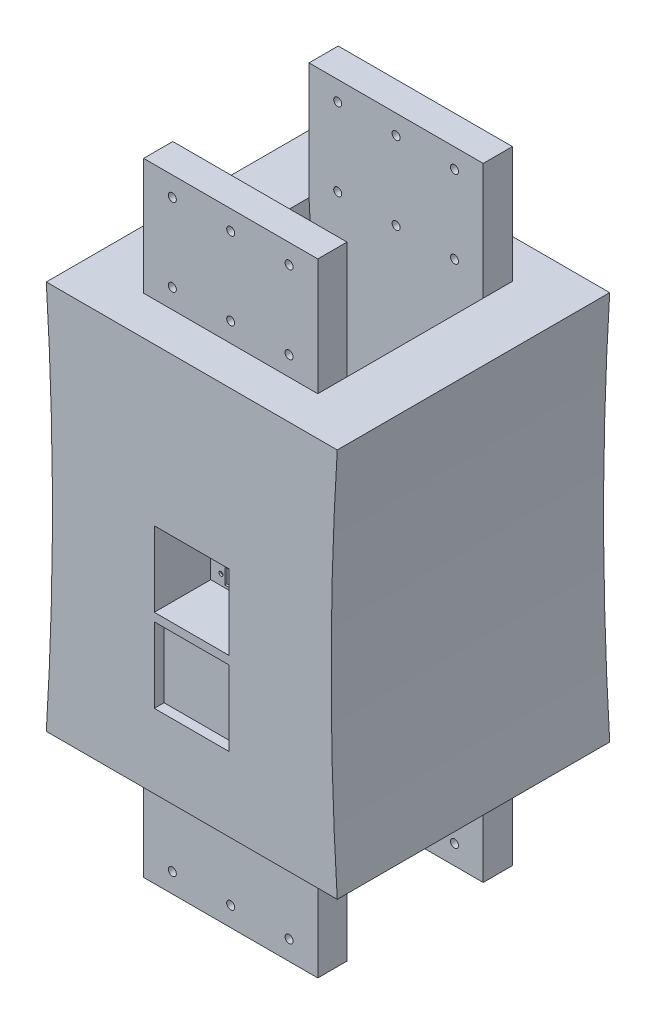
ISO-10303-21;
HEADER;
FILE_DESCRIPTION(('STEP AP214'),'2;1');
FILE_NAME('part.step','',(''),(''),'','','');
FILE_SCHEMA(('AUTOMOTIVE_DESIGN { 1 0 10303 214 1 1 1 1 }'));
ENDSEC;
DATA;
#1=APPLICATION_CONTEXT('core data for automotive mechanical design processes');
#2=APPLICATION_PROTOCOL_DEFINITION('international standard','automotive_design',2000,#1);
#3=PRODUCT_CONTEXT('',#1,'mechanical');
#4=PRODUCT('Part','Part','',(#3));
#5=PRODUCT_RELATED_PRODUCT_CATEGORY('part','',(#4));
#6=PRODUCT_DEFINITION_FORMATION('','',#4);
#7=PRODUCT_DEFINITION_CONTEXT('part definition',#1,'design');
#8=PRODUCT_DEFINITION('design','',#6,#7);
#9=PRODUCT_DEFINITION_SHAPE('','',#8);
#10=(LENGTH_UNIT() NAMED_UNIT(*) SI_UNIT(.MILLI.,.METRE.));
#11=(NAMED_UNIT(*) PLANE_ANGLE_UNIT() SI_UNIT($,.RADIAN.));
#12=(NAMED_UNIT(*) SI_UNIT($,.STERADIAN.) SOLID_ANGLE_UNIT());
#13=UNCERTAINTY_MEASURE_WITH_UNIT(LENGTH_MEASURE(1.E-05),#10,'distance_accuracy_value','');
#14=(GEOMETRIC_REPRESENTATION_CONTEXT(3) GLOBAL_UNCERTAINTY_ASSIGNED_CONTEXT((#13)) GLOBAL_UNIT_ASSIGNED_CONTEXT((#10,
#11,#12)) REPRESENTATION_CONTEXT('',''));
#15=CARTESIAN_POINT('',(0.,0.,0.));
#16=DIRECTION('',(0.,0.,1.));
#17=DIRECTION('',(1.,0.,0.));
#18=AXIS2_PLACEMENT_3D('',#15,#16,#17);
#19=CARTESIAN_POINT('',(56.0000000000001,396.,58.));
#20=DIRECTION('',(0.,0.,1.));
#21=DIRECTION('',(1.,0.,0.));
#22=AXIS2_PLACEMENT_3D('',#19,#20,#21);
#23=CYLINDRICAL_SURFACE('',#22,1.05);
#24=CARTESIAN_POINT('',(56.0000000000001,396.,61.));
#25=DIRECTION('',(0.,0.,1.));
#26=DIRECTION('',(1.,0.,0.));
#27=AXIS2_PLACEMENT_3D('',#24,#25,#26);
#28=CIRCLE('',#27,1.05);
#29=CARTESIAN_POINT('',(57.0500000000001,396.,61.));
#30=VERTEX_POINT('',#29);
#31=EDGE_CURVE('E552',#30,#30,#28,.T.);
#32=ORIENTED_EDGE('',*,*,#31,.T.);
#33=EDGE_LOOP('',(#32));
#34=FACE_BOUND('',#33,.T.);
#35=CARTESIAN_POINT('',(56.0000000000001,396.,60.));
#36=DIRECTION('',(0.,0.,-1.));
#37=DIRECTION('',(-1.,0.,0.));
#38=AXIS2_PLACEMENT_3D('',#35,#36,#37);
#39=CIRCLE('',#38,1.05);
#40=CARTESIAN_POINT('',(54.9500000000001,396.,60.));
#41=VERTEX_POINT('',#40);
#42=EDGE_CURVE('E12',#41,#41,#39,.F.);
#43=ORIENTED_EDGE('',*,*,#42,.F.);
#44=EDGE_LOOP('',(#43));
#45=FACE_BOUND('',#44,.T.);
#46=ADVANCED_FACE('F102',(#34,#45),#23,.F.);
#47=CARTESIAN_POINT('',(84.0000000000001,396.,58.));
#48=DIRECTION('',(0.,0.,1.));
#49=DIRECTION('',(1.,0.,0.));
#50=AXIS2_PLACEMENT_3D('',#47,#48,#49);
#51=CYLINDRICAL_SURFACE('',#50,1.05);
#52=CARTESIAN_POINT('',(84.0000000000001,396.,61.));
#53=DIRECTION('',(0.,0.,-1.));
#54=DIRECTION('',(-1.,0.,0.));
#55=AXIS2_PLACEMENT_3D('',#52,#53,#54);
#56=CIRCLE('',#55,1.05);
#57=CARTESIAN_POINT('',(82.9500000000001,396.,61.));
#58=VERTEX_POINT('',#57);
#59=EDGE_CURVE('E548',#58,#58,#56,.T.);
#60=ORIENTED_EDGE('',*,*,#59,.F.);
#61=EDGE_LOOP('',(#60));
#62=FACE_BOUND('',#61,.T.);
#63=CARTESIAN_POINT('',(84.0000000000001,396.,60.));
#64=DIRECTION('',(0.,0.,-1.));
#65=DIRECTION('',(-1.,0.,0.));
#66=AXIS2_PLACEMENT_3D('',#63,#64,#65);
#67=CIRCLE('',#66,1.05);
#68=CARTESIAN_POINT('',(82.9500000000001,396.,60.));
#69=VERTEX_POINT('',#68);
#70=EDGE_CURVE('E431',#69,#69,#67,.T.);
#71=ORIENTED_EDGE('',*,*,#70,.T.);
#72=EDGE_LOOP('',(#71));
#73=FACE_BOUND('',#72,.T.);
#74=ADVANCED_FACE('F720',(#62,#73),#51,.F.);
#75=CARTESIAN_POINT('',(84.0000000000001,424.,58.));
#76=DIRECTION('',(0.,0.,1.));
#77=DIRECTION('',(1.,0.,0.));
#78=AXIS2_PLACEMENT_3D('',#75,#76,#77);
#79=CYLINDRICAL_SURFACE('',#78,1.05);
#80=CARTESIAN_POINT('',(84.0000000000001,424.,61.));
#81=DIRECTION('',(0.,0.,1.));
#82=DIRECTION('',(1.,0.,0.));
#83=AXIS2_PLACEMENT_3D('',#80,#81,#82);
#84=CIRCLE('',#83,1.05);
#85=CARTESIAN_POINT('',(85.0500000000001,424.,61.));
#86=VERTEX_POINT('',#85);
#87=EDGE_CURVE('E551',#86,#86,#84,.T.);
#88=ORIENTED_EDGE('',*,*,#87,.T.);
#89=EDGE_LOOP('',(#88));
#90=FACE_BOUND('',#89,.T.);
#91=CARTESIAN_POINT('',(84.0000000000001,424.,60.));
#92=DIRECTION('',(0.,0.,-1.));
#93=DIRECTION('',(-1.,0.,0.));
#94=AXIS2_PLACEMENT_3D('',#91,#92,#93);
#95=CIRCLE('',#94,1.05);
#96=CARTESIAN_POINT('',(82.9500000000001,424.,60.));
#97=VERTEX_POINT('',#96);
#98=EDGE_CURVE('E112',#97,#97,#95,.F.);
#99=ORIENTED_EDGE('',*,*,#98,.F.);
#100=EDGE_LOOP('',(#99));
#101=FACE_BOUND('',#100,.T.);
#102=ADVANCED_FACE('F723',(#90,#101),#79,.F.);
#103=CARTESIAN_POINT('',(56.0000000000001,424.,58.));
#104=DIRECTION('',(0.,0.,1.));
#105=DIRECTION('',(1.,0.,0.));
#106=AXIS2_PLACEMENT_3D('',#103,#104,#105);
#107=CYLINDRICAL_SURFACE('',#106,1.05);
#108=CARTESIAN_POINT('',(56.0000000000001,424.,61.));
#109=DIRECTION('',(0.,0.,-1.));
#110=DIRECTION('',(-1.,0.,0.));
#111=AXIS2_PLACEMENT_3D('',#108,#109,#110);
#112=CIRCLE('',#111,1.05);
#113=CARTESIAN_POINT('',(54.9500000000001,424.,61.));
#114=VERTEX_POINT('',#113);
#115=EDGE_CURVE('E541',#114,#114,#112,.T.);
#116=ORIENTED_EDGE('',*,*,#115,.F.);
#117=EDGE_LOOP('',(#116));
#118=FACE_BOUND('',#117,.T.);
#119=CARTESIAN_POINT('',(56.0000000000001,424.,60.));
#120=DIRECTION('',(0.,0.,-1.));
#121=DIRECTION('',(-1.,0.,0.));
#122=AXIS2_PLACEMENT_3D('',#119,#120,#121);
#123=CIRCLE('',#122,1.05);
#124=CARTESIAN_POINT('',(54.9500000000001,424.,60.));
#125=VERTEX_POINT('',#124);
#126=EDGE_CURVE('E429',#125,#125,#123,.T.);
#127=ORIENTED_EDGE('',*,*,#126,.T.);
#128=EDGE_LOOP('',(#127));
#129=FACE_BOUND('',#128,.T.);
#130=ADVANCED_FACE('F728',(#118,#129),#107,.F.);
#131=CARTESIAN_POINT('',(0.,400.,31.));
#132=DIRECTION('',(0.,-1.,0.));
#133=DIRECTION('',(0.,0.,-1.));
#134=AXIS2_PLACEMENT_3D('',#131,#132,#133);
#135=PLANE('',#134);
#136=DIRECTION('',(0.,0.,1.));
#137=VECTOR('',#136,1.);
#138=CARTESIAN_POINT('',(57.9999999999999,400.,31.));
#139=LINE('',#138,#137);
#140=CARTESIAN_POINT('',(57.9999999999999,400.,60.));
#141=VERTEX_POINT('',#140);
#142=CARTESIAN_POINT('',(57.9999999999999,400.,61.));
#143=VERTEX_POINT('',#142);
#144=EDGE_CURVE('E536',#141,#143,#139,.T.);
#145=ORIENTED_EDGE('',*,*,#144,.F.);
#146=DIRECTION('',(1.,0.,0.));
#147=VECTOR('',#146,1.);
#148=CARTESIAN_POINT('',(0.,400.,60.));
#149=LINE('',#148,#147);
#150=CARTESIAN_POINT('',(82.,400.,60.));
#151=VERTEX_POINT('',#150);
#152=EDGE_CURVE('E125',#141,#151,#149,.T.);
#153=ORIENTED_EDGE('',*,*,#152,.T.);
#154=DIRECTION('',(0.,0.,1.));
#155=VECTOR('',#154,1.);
#156=CARTESIAN_POINT('',(82.0000000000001,400.,31.));
#157=LINE('',#156,#155);
#158=CARTESIAN_POINT('',(82.0000000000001,400.,61.));
#159=VERTEX_POINT('',#158);
#160=EDGE_CURVE('E543',#151,#159,#157,.T.);
#161=ORIENTED_EDGE('',*,*,#160,.T.);
#162=DIRECTION('',(1.,0.,0.));
#163=VECTOR('',#162,1.);
#164=CARTESIAN_POINT('',(0.,400.,61.));
#165=LINE('',#164,#163);
#166=EDGE_CURVE('E529',#143,#159,#165,.T.);
#167=ORIENTED_EDGE('',*,*,#166,.F.);
#168=EDGE_LOOP('',(#145,#153,#161,#167));
#169=FACE_BOUND('',#168,.T.);
#170=ADVANCED_FACE('F997',(#169),#135,.T.);
#171=CARTESIAN_POINT('',(82.0000000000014,2.84494650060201E-13,31.));
#172=DIRECTION('',(1.,0.,0.));
#173=DIRECTION('',(0.,1.,0.));
#174=AXIS2_PLACEMENT_3D('',#171,#172,#173);
#175=PLANE('',#174);
#176=DIRECTION('',(0.,1.,0.));
#177=VECTOR('',#176,1.);
#178=CARTESIAN_POINT('',(82.0000000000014,2.84494650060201E-13,60.));
#179=LINE('',#178,#177);
#180=CARTESIAN_POINT('',(82.0000000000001,392.,60.));
#181=VERTEX_POINT('',#180);
#182=EDGE_CURVE('E925',#181,#151,#179,.T.);
#183=ORIENTED_EDGE('',*,*,#182,.F.);
#184=DIRECTION('',(0.,0.,1.));
#185=VECTOR('',#184,1.);
#186=CARTESIAN_POINT('',(82.0000000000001,392.,31.));
#187=LINE('',#186,#185);
#188=CARTESIAN_POINT('',(82.0000000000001,392.,61.));
#189=VERTEX_POINT('',#188);
#190=EDGE_CURVE('E544',#181,#189,#187,.T.);
#191=ORIENTED_EDGE('',*,*,#190,.T.);
#192=DIRECTION('',(0.,1.,0.));
#193=VECTOR('',#192,1.);
#194=CARTESIAN_POINT('',(82.0000000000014,2.84494650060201E-13,61.));
#195=LINE('',#194,#193);
#196=EDGE_CURVE('E540',#189,#159,#195,.T.);
#197=ORIENTED_EDGE('',*,*,#196,.T.);
#198=ORIENTED_EDGE('',*,*,#160,.F.);
#199=EDGE_LOOP('',(#183,#191,#197,#198));
#200=FACE_BOUND('',#199,.T.);
#201=ADVANCED_FACE('F998',(#200),#175,.F.);
#202=CARTESIAN_POINT('',(0.,392.,31.));
#203=DIRECTION('',(0.,1.,0.));
#204=DIRECTION('',(0.,0.,1.));
#205=AXIS2_PLACEMENT_3D('',#202,#203,#204);
#206=PLANE('',#205);
#207=ORIENTED_EDGE('',*,*,#190,.F.);
#208=DIRECTION('',(-1.,0.,0.));
#209=VECTOR('',#208,1.);
#210=CARTESIAN_POINT('',(0.,392.,60.));
#211=LINE('',#210,#209);
#212=CARTESIAN_POINT('',(57.9999999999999,392.,60.));
#213=VERTEX_POINT('',#212);
#214=EDGE_CURVE('E918',#181,#213,#211,.T.);
#215=ORIENTED_EDGE('',*,*,#214,.T.);
#216=DIRECTION('',(0.,0.,1.));
#217=VECTOR('',#216,1.);
#218=CARTESIAN_POINT('',(57.9999999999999,392.,31.));
#219=LINE('',#218,#217);
#220=CARTESIAN_POINT('',(57.9999999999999,392.,61.));
#221=VERTEX_POINT('',#220);
#222=EDGE_CURVE('E546',#213,#221,#219,.T.);
#223=ORIENTED_EDGE('',*,*,#222,.T.);
#224=DIRECTION('',(-1.,0.,0.));
#225=VECTOR('',#224,1.);
#226=CARTESIAN_POINT('',(0.,392.,61.));
#227=LINE('',#226,#225);
#228=EDGE_CURVE('E534',#189,#221,#227,.T.);
#229=ORIENTED_EDGE('',*,*,#228,.F.);
#230=EDGE_LOOP('',(#207,#215,#223,#229));
#231=FACE_BOUND('',#230,.T.);
#232=ADVANCED_FACE('F999',(#231),#206,.T.);
#233=CARTESIAN_POINT('',(58.0000000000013,2.01227923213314E-13,31.));
#234=DIRECTION('',(1.,0.,0.));
#235=DIRECTION('',(0.,1.,0.));
#236=AXIS2_PLACEMENT_3D('',#233,#234,#235);
#237=PLANE('',#236);
#238=ORIENTED_EDGE('',*,*,#222,.F.);
#239=DIRECTION('',(0.,1.,0.));
#240=VECTOR('',#239,1.);
#241=CARTESIAN_POINT('',(58.0000000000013,2.01227923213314E-13,60.));
#242=LINE('',#241,#240);
#243=EDGE_CURVE('E917',#213,#141,#242,.T.);
#244=ORIENTED_EDGE('',*,*,#243,.T.);
#245=ORIENTED_EDGE('',*,*,#144,.T.);
#246=DIRECTION('',(0.,1.,0.));
#247=VECTOR('',#246,1.);
#248=CARTESIAN_POINT('',(58.0000000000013,2.01227923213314E-13,61.));
#249=LINE('',#248,#247);
#250=EDGE_CURVE('E532',#221,#143,#249,.T.);
#251=ORIENTED_EDGE('',*,*,#250,.F.);
#252=EDGE_LOOP('',(#238,#244,#245,#251));
#253=FACE_BOUND('',#252,.T.);
#254=ADVANCED_FACE('F1003',(#253),#237,.T.);
#255=CARTESIAN_POINT('',(0.,428.000000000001,31.));
#256=DIRECTION('',(0.,-1.,0.));
#257=DIRECTION('',(0.,0.,-1.));
#258=AXIS2_PLACEMENT_3D('',#255,#256,#257);
#259=PLANE('',#258);
#260=DIRECTION('',(0.,0.,1.));
#261=VECTOR('',#260,1.);
#262=CARTESIAN_POINT('',(58.0000000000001,428.000000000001,31.));
#263=LINE('',#262,#261);
#264=CARTESIAN_POINT('',(58.0000000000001,428.000000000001,60.));
#265=VERTEX_POINT('',#264);
#266=CARTESIAN_POINT('',(58.0000000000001,428.000000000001,61.));
#267=VERTEX_POINT('',#266);
#268=EDGE_CURVE('E508',#265,#267,#263,.T.);
#269=ORIENTED_EDGE('',*,*,#268,.F.);
#270=DIRECTION('',(1.,0.,0.));
#271=VECTOR('',#270,1.);
#272=CARTESIAN_POINT('',(0.,428.000000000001,60.));
#273=LINE('',#272,#271);
#274=CARTESIAN_POINT('',(82.0000000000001,428.000000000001,60.));
#275=VERTEX_POINT('',#274);
#276=EDGE_CURVE('E126',#265,#275,#273,.T.);
#277=ORIENTED_EDGE('',*,*,#276,.T.);
#278=DIRECTION('',(0.,0.,1.));
#279=VECTOR('',#278,1.);
#280=CARTESIAN_POINT('',(82.0000000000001,428.000000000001,31.));
#281=LINE('',#280,#279);
#282=CARTESIAN_POINT('',(82.0000000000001,428.000000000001,61.));
#283=VERTEX_POINT('',#282);
#284=EDGE_CURVE('E507',#275,#283,#281,.T.);
#285=ORIENTED_EDGE('',*,*,#284,.T.);
#286=DIRECTION('',(1.,0.,0.));
#287=VECTOR('',#286,1.);
#288=CARTESIAN_POINT('',(0.,428.000000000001,61.));
#289=LINE('',#288,#287);
#290=EDGE_CURVE('E522',#267,#283,#289,.T.);
#291=ORIENTED_EDGE('',*,*,#290,.F.);
#292=EDGE_LOOP('',(#269,#277,#285,#291));
#293=FACE_BOUND('',#292,.T.);
#294=ADVANCED_FACE('F976',(#293),#259,.T.);
#295=CARTESIAN_POINT('',(82.0000000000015,2.84494650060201E-13,31.));
#296=DIRECTION('',(-1.,0.,0.));
#297=DIRECTION('',(0.,-1.,0.));
#298=AXIS2_PLACEMENT_3D('',#295,#296,#297);
#299=PLANE('',#298);
#300=ORIENTED_EDGE('',*,*,#284,.F.);
#301=DIRECTION('',(0.,-1.,0.));
#302=VECTOR('',#301,1.);
#303=CARTESIAN_POINT('',(82.0000000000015,2.84494650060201E-13,60.));
#304=LINE('',#303,#302);
#305=CARTESIAN_POINT('',(82.0000000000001,420.000000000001,60.));
#306=VERTEX_POINT('',#305);
#307=EDGE_CURVE('E914',#275,#306,#304,.T.);
#308=ORIENTED_EDGE('',*,*,#307,.T.);
#309=DIRECTION('',(0.,0.,1.));
#310=VECTOR('',#309,1.);
#311=CARTESIAN_POINT('',(82.0000000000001,420.000000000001,31.));
#312=LINE('',#311,#310);
#313=CARTESIAN_POINT('',(82.0000000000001,420.000000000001,61.));
#314=VERTEX_POINT('',#313);
#315=EDGE_CURVE('E511',#306,#314,#312,.T.);
#316=ORIENTED_EDGE('',*,*,#315,.T.);
#317=DIRECTION('',(0.,-1.,0.));
#318=VECTOR('',#317,1.);
#319=CARTESIAN_POINT('',(82.0000000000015,2.84494650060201E-13,61.));
#320=LINE('',#319,#318);
#321=EDGE_CURVE('E512',#283,#314,#320,.T.);
#322=ORIENTED_EDGE('',*,*,#321,.F.);
#323=EDGE_LOOP('',(#300,#308,#316,#322));
#324=FACE_BOUND('',#323,.T.);
#325=ADVANCED_FACE('F968',(#324),#299,.T.);
#326=CARTESIAN_POINT('',(0.,420.000000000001,31.));
#327=DIRECTION('',(0.,1.,0.));
#328=DIRECTION('',(0.,0.,1.));
#329=AXIS2_PLACEMENT_3D('',#326,#327,#328);
#330=PLANE('',#329);
#331=ORIENTED_EDGE('',*,*,#315,.F.);
#332=DIRECTION('',(-1.,0.,0.));
#333=VECTOR('',#332,1.);
#334=CARTESIAN_POINT('',(0.,420.000000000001,60.));
#335=LINE('',#334,#333);
#336=CARTESIAN_POINT('',(58.0000000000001,420.000000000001,60.));
#337=VERTEX_POINT('',#336);
#338=EDGE_CURVE('E913',#306,#337,#335,.T.);
#339=ORIENTED_EDGE('',*,*,#338,.T.);
#340=DIRECTION('',(0.,0.,1.));
#341=VECTOR('',#340,1.);
#342=CARTESIAN_POINT('',(58.0000000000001,420.000000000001,31.));
#343=LINE('',#342,#341);
#344=CARTESIAN_POINT('',(58.0000000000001,420.000000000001,61.));
#345=VERTEX_POINT('',#344);
#346=EDGE_CURVE('E515',#337,#345,#343,.T.);
#347=ORIENTED_EDGE('',*,*,#346,.T.);
#348=DIRECTION('',(-1.,0.,0.));
#349=VECTOR('',#348,1.);
#350=CARTESIAN_POINT('',(0.,420.000000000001,61.));
#351=LINE('',#350,#349);
#352=EDGE_CURVE('E519',#314,#345,#351,.T.);
#353=ORIENTED_EDGE('',*,*,#352,.F.);
#354=EDGE_LOOP('',(#331,#339,#347,#353));
#355=FACE_BOUND('',#354,.T.);
#356=ADVANCED_FACE('F974',(#355),#330,.T.);
#357=CARTESIAN_POINT('',(58.0000000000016,2.01227923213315E-13,31.));
#358=DIRECTION('',(-1.,0.,0.));
#359=DIRECTION('',(0.,-1.,0.));
#360=AXIS2_PLACEMENT_3D('',#357,#358,#359);
#361=PLANE('',#360);
#362=DIRECTION('',(0.,-1.,0.));
#363=VECTOR('',#362,1.);
#364=CARTESIAN_POINT('',(58.0000000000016,2.01227923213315E-13,60.));
#365=LINE('',#364,#363);
#366=EDGE_CURVE('E908',#265,#337,#365,.T.);
#367=ORIENTED_EDGE('',*,*,#366,.F.);
#368=ORIENTED_EDGE('',*,*,#268,.T.);
#369=DIRECTION('',(0.,-1.,0.));
#370=VECTOR('',#369,1.);
#371=CARTESIAN_POINT('',(58.0000000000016,2.01227923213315E-13,61.));
#372=LINE('',#371,#370);
#373=EDGE_CURVE('E525',#267,#345,#372,.T.);
#374=ORIENTED_EDGE('',*,*,#373,.T.);
#375=ORIENTED_EDGE('',*,*,#346,.F.);
#376=EDGE_LOOP('',(#367,#368,#374,#375));
#377=FACE_BOUND('',#376,.T.);
#378=ADVANCED_FACE('F977',(#377),#361,.F.);
#379=CARTESIAN_POINT('',(0.,0.,90.));
#380=DIRECTION('',(0.,0.,1.));
#381=DIRECTION('',(1.,0.,0.));
#382=AXIS2_PLACEMENT_3D('',#379,#380,#381);
#383=PLANE('',#382);
#384=DIRECTION('',(0.,-1.,0.));
#385=VECTOR('',#384,1.);
#386=CARTESIAN_POINT('',(50.75,0.,90.));
#387=LINE('',#386,#385);
#388=CARTESIAN_POINT('',(50.75,429.25,90.));
#389=VERTEX_POINT('',#388);
#390=CARTESIAN_POINT('',(50.75,390.750000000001,90.));
#391=VERTEX_POINT('',#390);
#392=EDGE_CURVE('E557',#389,#391,#387,.T.);
#393=ORIENTED_EDGE('',*,*,#392,.F.);
#394=DIRECTION('',(1.,0.,0.));
#395=VECTOR('',#394,1.);
#396=CARTESIAN_POINT('',(0.,429.25,90.));
#397=LINE('',#396,#395);
#398=CARTESIAN_POINT('',(89.25,429.25,90.));
#399=VERTEX_POINT('',#398);
#400=EDGE_CURVE('E564',#389,#399,#397,.T.);
#401=ORIENTED_EDGE('',*,*,#400,.T.);
#402=DIRECTION('',(0.,-1.,0.));
#403=VECTOR('',#402,1.);
#404=CARTESIAN_POINT('',(89.25,0.,90.));
#405=LINE('',#404,#403);
#406=CARTESIAN_POINT('',(89.25,390.750000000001,90.));
#407=VERTEX_POINT('',#406);
#408=EDGE_CURVE('E580',#399,#407,#405,.T.);
#409=ORIENTED_EDGE('',*,*,#408,.T.);
#410=DIRECTION('',(1.,0.,0.));
#411=VECTOR('',#410,1.);
#412=CARTESIAN_POINT('',(0.,390.750000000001,90.));
#413=LINE('',#412,#411);
#414=EDGE_CURVE('E573',#391,#407,#413,.T.);
#415=ORIENTED_EDGE('',*,*,#414,.F.);
#416=EDGE_LOOP('',(#393,#401,#409,#415));
#417=FACE_BOUND('',#416,.T.);
#418=CARTESIAN_POINT('',(1741.62336455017,410.,90.));
#419=DIRECTION('',(0.,0.,1.));
#420=DIRECTION('',(1.,0.,0.));
#421=AXIS2_PLACEMENT_3D('',#418,#419,#420);
#422=CIRCLE('',#421,1600.);
#423=CARTESIAN_POINT('',(144.75142228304,310.,90.));
#424=VERTEX_POINT('',#423);
#425=CARTESIAN_POINT('',(144.75142228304,510.,90.));
#426=VERTEX_POINT('',#425);
#427=EDGE_CURVE('E653',#424,#426,#422,.F.);
#428=ORIENTED_EDGE('',*,*,#427,.T.);
#429=DIRECTION('',(-1.,0.,0.));
#430=VECTOR('',#429,1.);
#431=CARTESIAN_POINT('',(0.,510.,90.));
#432=LINE('',#431,#430);
#433=CARTESIAN_POINT('',(-4.75142228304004,510.,90.));
#434=VERTEX_POINT('',#433);
#435=EDGE_CURVE('E408',#426,#434,#432,.T.);
#436=ORIENTED_EDGE('',*,*,#435,.T.);
#437=CARTESIAN_POINT('',(-1601.62336455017,410.,90.));
#438=DIRECTION('',(0.,0.,1.));
#439=DIRECTION('',(1.,0.,0.));
#440=AXIS2_PLACEMENT_3D('',#437,#438,#439);
#441=CIRCLE('',#440,1600.);
#442=CARTESIAN_POINT('',(-4.7514222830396,310.,90.));
#443=VERTEX_POINT('',#442);
#444=EDGE_CURVE('E654',#434,#443,#441,.F.);
#445=ORIENTED_EDGE('',*,*,#444,.T.);
#446=DIRECTION('',(1.,0.,0.));
#447=VECTOR('',#446,1.);
#448=CARTESIAN_POINT('',(-5.16253706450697E-12,310.,90.));
#449=LINE('',#448,#447);
#450=EDGE_CURVE('E649',#443,#424,#449,.T.);
#451=ORIENTED_EDGE('',*,*,#450,.T.);
#452=EDGE_LOOP('',(#428,#436,#445,#451));
#453=FACE_BOUND('',#452,.T.);
#454=DIRECTION('',(1.,0.,0.));
#455=VECTOR('',#454,1.);
#456=CARTESIAN_POINT('',(0.,386.5,90.));
#457=LINE('',#456,#455);
#458=CARTESIAN_POINT('',(50.7500000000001,386.5,90.));
#459=VERTEX_POINT('',#458);
#460=CARTESIAN_POINT('',(89.2500000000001,386.5,90.));
#461=VERTEX_POINT('',#460);
#462=EDGE_CURVE('E449',#459,#461,#457,.T.);
#463=ORIENTED_EDGE('',*,*,#462,.T.);
#464=DIRECTION('',(0.,-1.,0.));
#465=VECTOR('',#464,1.);
#466=CARTESIAN_POINT('',(89.2500000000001,0.,90.));
#467=LINE('',#466,#465);
#468=CARTESIAN_POINT('',(89.2500000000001,348.,90.));
#469=VERTEX_POINT('',#468);
#470=EDGE_CURVE('E433',#461,#469,#467,.T.);
#471=ORIENTED_EDGE('',*,*,#470,.T.);
#472=DIRECTION('',(-1.,0.,0.));
#473=VECTOR('',#472,1.);
#474=CARTESIAN_POINT('',(0.,348.,90.));
#475=LINE('',#474,#473);
#476=CARTESIAN_POINT('',(50.7500000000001,348.,90.));
#477=VERTEX_POINT('',#476);
#478=EDGE_CURVE('E437',#469,#477,#475,.T.);
#479=ORIENTED_EDGE('',*,*,#478,.T.);
#480=DIRECTION('',(0.,1.,0.));
#481=VECTOR('',#480,1.);
#482=CARTESIAN_POINT('',(50.7500000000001,0.,90.));
#483=LINE('',#482,#481);
#484=EDGE_CURVE('E452',#477,#459,#483,.T.);
#485=ORIENTED_EDGE('',*,*,#484,.T.);
#486=EDGE_LOOP('',(#463,#471,#479,#485));
#487=FACE_BOUND('',#486,.T.);
#488=ADVANCED_FACE('F687',(#417,#453,#487),#383,.T.);
#489=CARTESIAN_POINT('',(40.0000000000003,300.,70.));
#490=DIRECTION('',(0.,0.,1.));
#491=DIRECTION('',(1.,0.,0.));
#492=AXIS2_PLACEMENT_3D('',#489,#490,#491);
#493=PLANE('',#492);
#494=CARTESIAN_POINT('',(40.0000000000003,300.,70.));
#495=DIRECTION('',(0.,0.,1.));
#496=DIRECTION('',(1.,0.,0.));
#497=AXIS2_PLACEMENT_3D('',#494,#495,#496);
#498=CIRCLE('',#497,2.05917687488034);
#499=CARTESIAN_POINT('',(42.0591768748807,300.,70.));
#500=VERTEX_POINT('',#499);
#501=EDGE_CURVE('E107',#500,#500,#498,.T.);
#502=ORIENTED_EDGE('',*,*,#501,.F.);
#503=EDGE_LOOP('',(#502));
#504=FACE_BOUND('',#503,.T.);
#505=DIRECTION('',(1.,0.,0.));
#506=VECTOR('',#505,1.);
#507=CARTESIAN_POINT('',(-5.16253706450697E-12,310.,70.));
#508=LINE('',#507,#506);
#509=CARTESIAN_POINT('',(25.2485777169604,310.000000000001,70.));
#510=VERTEX_POINT('',#509);
#511=CARTESIAN_POINT('',(114.75142228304,310.000000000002,70.));
#512=VERTEX_POINT('',#511);
#513=EDGE_CURVE('E399',#510,#512,#508,.T.);
#514=ORIENTED_EDGE('',*,*,#513,.F.);
#515=DIRECTION('',(0.,-1.,0.));
#516=VECTOR('',#515,1.);
#517=CARTESIAN_POINT('',(25.2485777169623,1.86877015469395E-13,70.));
#518=LINE('',#517,#516);
#519=CARTESIAN_POINT('',(25.2485777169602,250.000000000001,70.));
#520=VERTEX_POINT('',#519);
#521=EDGE_CURVE('E489',#510,#520,#518,.T.);
#522=ORIENTED_EDGE('',*,*,#521,.T.);
#523=DIRECTION('',(1.,0.,0.));
#524=VECTOR('',#523,1.);
#525=CARTESIAN_POINT('',(0.,250.000000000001,70.));
#526=LINE('',#525,#524);
#527=CARTESIAN_POINT('',(114.75142228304,250.000000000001,70.));
#528=VERTEX_POINT('',#527);
#529=EDGE_CURVE('E398',#520,#528,#526,.T.);
#530=ORIENTED_EDGE('',*,*,#529,.T.);
#531=DIRECTION('',(0.,-1.,0.));
#532=VECTOR('',#531,1.);
#533=CARTESIAN_POINT('',(114.75142228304,0.,70.));
#534=LINE('',#533,#532);
#535=EDGE_CURVE('E484',#512,#528,#534,.T.);
#536=ORIENTED_EDGE('',*,*,#535,.F.);
#537=EDGE_LOOP('',(#514,#522,#530,#536));
#538=FACE_BOUND('',#537,.T.);
#539=CARTESIAN_POINT('',(100.,300.,70.));
#540=DIRECTION('',(0.,0.,1.));
#541=DIRECTION('',(1.,0.,0.));
#542=AXIS2_PLACEMENT_3D('',#539,#540,#541);
#543=CIRCLE('',#542,2.05917687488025);
#544=CARTESIAN_POINT('',(102.059176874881,300.,70.));
#545=VERTEX_POINT('',#544);
#546=EDGE_CURVE('E474',#545,#545,#543,.T.);
#547=ORIENTED_EDGE('',*,*,#546,.F.);
#548=EDGE_LOOP('',(#547));
#549=FACE_BOUND('',#548,.T.);
#550=CARTESIAN_POINT('',(100.,260.,70.));
#551=DIRECTION('',(0.,0.,1.));
#552=DIRECTION('',(1.,0.,0.));
#553=AXIS2_PLACEMENT_3D('',#550,#551,#552);
#554=CIRCLE('',#553,2.05917687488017);
#555=CARTESIAN_POINT('',(102.059176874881,260.,70.));
#556=VERTEX_POINT('',#555);
#557=EDGE_CURVE('E459',#556,#556,#554,.T.);
#558=ORIENTED_EDGE('',*,*,#557,.F.);
#559=EDGE_LOOP('',(#558));
#560=FACE_BOUND('',#559,.T.);
#561=CARTESIAN_POINT('',(70.0000000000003,300.,70.));
#562=DIRECTION('',(0.,0.,1.));
#563=DIRECTION('',(1.,0.,0.));
#564=AXIS2_PLACEMENT_3D('',#561,#562,#563);
#565=CIRCLE('',#564,2.05917687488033);
#566=CARTESIAN_POINT('',(72.0591768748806,300.,70.));
#567=VERTEX_POINT('',#566);
#568=EDGE_CURVE('E480',#567,#567,#565,.T.);
#569=ORIENTED_EDGE('',*,*,#568,.F.);
#570=EDGE_LOOP('',(#569));
#571=FACE_BOUND('',#570,.T.);
#572=CARTESIAN_POINT('',(70.0000000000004,260.,70.));
#573=DIRECTION('',(0.,0.,1.));
#574=DIRECTION('',(1.,0.,0.));
#575=AXIS2_PLACEMENT_3D('',#572,#573,#574);
#576=CIRCLE('',#575,2.05917687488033);
#577=CARTESIAN_POINT('',(72.0591768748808,260.,70.));
#578=VERTEX_POINT('',#577);
#579=EDGE_CURVE('E466',#578,#578,#576,.T.);
#580=ORIENTED_EDGE('',*,*,#579,.F.);
#581=EDGE_LOOP('',(#580));
#582=FACE_BOUND('',#581,.T.);
#583=CARTESIAN_POINT('',(40.0000000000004,260.,70.));
#584=DIRECTION('',(0.,0.,1.));
#585=DIRECTION('',(1.,0.,0.));
#586=AXIS2_PLACEMENT_3D('',#583,#584,#585);
#587=CIRCLE('',#586,2.05917687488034);
#588=CARTESIAN_POINT('',(42.0591768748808,260.,70.));
#589=VERTEX_POINT('',#588);
#590=EDGE_CURVE('E472',#589,#589,#587,.T.);
#591=ORIENTED_EDGE('',*,*,#590,.F.);
#592=EDGE_LOOP('',(#591));
#593=FACE_BOUND('',#592,.T.);
#594=ADVANCED_FACE('F110',(#504,#538,#549,#560,#571,#582,#593),#493,.T.);
#595=CARTESIAN_POINT('',(40.0000000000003,300.,67.));
#596=DIRECTION('',(0.,0.,1.));
#597=DIRECTION('',(1.,0.,0.));
#598=AXIS2_PLACEMENT_3D('',#595,#596,#597);
#599=CYLINDRICAL_SURFACE('',#598,2.05917687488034);
#600=ORIENTED_EDGE('',*,*,#501,.T.);
#601=EDGE_LOOP('',(#600));
#602=FACE_BOUND('',#601,.T.);
#603=CARTESIAN_POINT('',(40.,299.999999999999,55.));
#604=DIRECTION('',(0.,0.,-1.));
#605=DIRECTION('',(-1.,0.,0.));
#606=AXIS2_PLACEMENT_3D('',#603,#604,#605);
#607=CIRCLE('',#606,2.05917687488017);
#608=CARTESIAN_POINT('',(37.9408231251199,299.999999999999,55.));
#609=VERTEX_POINT('',#608);
#610=EDGE_CURVE('E879',#609,#609,#607,.T.);
#611=ORIENTED_EDGE('',*,*,#610,.T.);
#612=EDGE_LOOP('',(#611));
#613=FACE_BOUND('',#612,.T.);
#614=ADVANCED_FACE('F1377',(#602,#613),#599,.F.);
#615=CARTESIAN_POINT('',(0.,0.,-30.));
#616=DIRECTION('',(0.,0.,-1.));
#617=DIRECTION('',(-1.,0.,0.));
#618=AXIS2_PLACEMENT_3D('',#615,#616,#617);
#619=PLANE('',#618);
#620=DIRECTION('',(-1.,0.,0.));
#621=VECTOR('',#620,1.);
#622=CARTESIAN_POINT('',(0.,250.000000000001,-30.));
#623=LINE('',#622,#621);
#624=CARTESIAN_POINT('',(114.75142228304,250.000000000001,-30.));
#625=VERTEX_POINT('',#624);
#626=CARTESIAN_POINT('',(25.2485777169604,250.000000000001,-30.));
#627=VERTEX_POINT('',#626);
#628=EDGE_CURVE('E650',#625,#627,#623,.T.);
#629=ORIENTED_EDGE('',*,*,#628,.T.);
#630=DIRECTION('',(0.,1.,0.));
#631=VECTOR('',#630,1.);
#632=CARTESIAN_POINT('',(25.2485777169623,1.86877015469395E-13,-30.));
#633=LINE('',#632,#631);
#634=CARTESIAN_POINT('',(25.2485777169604,310.000000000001,-30.));
#635=VERTEX_POINT('',#634);
#636=EDGE_CURVE('E491',#627,#635,#633,.T.);
#637=ORIENTED_EDGE('',*,*,#636,.T.);
#638=DIRECTION('',(-1.,0.,0.));
#639=VECTOR('',#638,1.);
#640=CARTESIAN_POINT('',(2.11493865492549E-12,310.000000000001,-30.));
#641=LINE('',#640,#639);
#642=CARTESIAN_POINT('',(114.75142228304,310.000000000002,-30.));
#643=VERTEX_POINT('',#642);
#644=EDGE_CURVE('E349',#643,#635,#641,.T.);
#645=ORIENTED_EDGE('',*,*,#644,.F.);
#646=DIRECTION('',(0.,1.,0.));
#647=VECTOR('',#646,1.);
#648=CARTESIAN_POINT('',(114.75142228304,0.,-30.));
#649=LINE('',#648,#647);
#650=EDGE_CURVE('E487',#625,#643,#649,.T.);
#651=ORIENTED_EDGE('',*,*,#650,.F.);
#652=EDGE_LOOP('',(#629,#637,#645,#651));
#653=FACE_BOUND('',#652,.T.);
#654=CARTESIAN_POINT('',(100.,260.,-30.));
#655=DIRECTION('',(0.,0.,-1.));
#656=DIRECTION('',(-1.,0.,0.));
#657=AXIS2_PLACEMENT_3D('',#654,#655,#656);
#658=CIRCLE('',#657,2.05917687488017);
#659=CARTESIAN_POINT('',(102.059176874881,260.,-30.));
#660=VERTEX_POINT('',#659);
#661=EDGE_CURVE('E666',#660,#660,#658,.T.);
#662=ORIENTED_EDGE('',*,*,#661,.F.);
#663=EDGE_LOOP('',(#662));
#664=FACE_BOUND('',#663,.T.);
#665=CARTESIAN_POINT('',(70.0000000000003,300.,-30.));
#666=DIRECTION('',(0.,0.,-1.));
#667=DIRECTION('',(-1.,0.,0.));
#668=AXIS2_PLACEMENT_3D('',#665,#666,#667);
#669=CIRCLE('',#668,2.05917687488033);
#670=CARTESIAN_POINT('',(72.0591768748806,300.,-30.));
#671=VERTEX_POINT('',#670);
#672=EDGE_CURVE('E664',#671,#671,#669,.T.);
#673=ORIENTED_EDGE('',*,*,#672,.F.);
#674=EDGE_LOOP('',(#673));
#675=FACE_BOUND('',#674,.T.);
#676=CARTESIAN_POINT('',(40.0000000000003,300.,-30.));
#677=DIRECTION('',(0.,0.,-1.));
#678=DIRECTION('',(-1.,0.,0.));
#679=AXIS2_PLACEMENT_3D('',#676,#677,#678);
#680=CIRCLE('',#679,2.05917687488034);
#681=CARTESIAN_POINT('',(42.0591768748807,300.,-30.));
#682=VERTEX_POINT('',#681);
#683=EDGE_CURVE('E671',#682,#682,#680,.T.);
#684=ORIENTED_EDGE('',*,*,#683,.F.);
#685=EDGE_LOOP('',(#684));
#686=FACE_BOUND('',#685,.T.);
#687=CARTESIAN_POINT('',(100.,300.,-30.));
#688=DIRECTION('',(0.,0.,-1.));
#689=DIRECTION('',(-1.,0.,0.));
#690=AXIS2_PLACEMENT_3D('',#687,#688,#689);
#691=CIRCLE('',#690,2.05917687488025);
#692=CARTESIAN_POINT('',(102.059176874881,300.,-30.));
#693=VERTEX_POINT('',#692);
#694=EDGE_CURVE('E670',#693,#693,#691,.T.);
#695=ORIENTED_EDGE('',*,*,#694,.F.);
#696=EDGE_LOOP('',(#695));
#697=FACE_BOUND('',#696,.T.);
#698=CARTESIAN_POINT('',(40.0000000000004,260.,-30.));
#699=DIRECTION('',(0.,0.,-1.));
#700=DIRECTION('',(-1.,0.,0.));
#701=AXIS2_PLACEMENT_3D('',#698,#699,#700);
#702=CIRCLE('',#701,2.05917687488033);
#703=CARTESIAN_POINT('',(42.0591768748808,260.,-30.));
#704=VERTEX_POINT('',#703);
#705=EDGE_CURVE('E656',#704,#704,#702,.T.);
#706=ORIENTED_EDGE('',*,*,#705,.F.);
#707=EDGE_LOOP('',(#706));
#708=FACE_BOUND('',#707,.T.);
#709=CARTESIAN_POINT('',(70.0000000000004,260.,-30.));
#710=DIRECTION('',(0.,0.,-1.));
#711=DIRECTION('',(-1.,0.,0.));
#712=AXIS2_PLACEMENT_3D('',#709,#710,#711);
#713=CIRCLE('',#712,2.05917687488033);
#714=CARTESIAN_POINT('',(72.0591768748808,260.,-30.));
#715=VERTEX_POINT('',#714);
#716=EDGE_CURVE('E662',#715,#715,#713,.T.);
#717=ORIENTED_EDGE('',*,*,#716,.F.);
#718=EDGE_LOOP('',(#717));
#719=FACE_BOUND('',#718,.T.);
#720=ADVANCED_FACE('F1362',(#653,#664,#675,#686,#697,#708,#719),#619,.T.);
#721=CARTESIAN_POINT('',(0.,250.000000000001,90.));
#722=DIRECTION('',(0.,-1.,0.));
#723=DIRECTION('',(0.,0.,-1.));
#724=AXIS2_PLACEMENT_3D('',#721,#722,#723);
#725=PLANE('',#724);
#726=ORIENTED_EDGE('',*,*,#529,.F.);
#727=DIRECTION('',(0.,0.,1.));
#728=VECTOR('',#727,1.);
#729=CARTESIAN_POINT('',(25.2485777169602,250.000000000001,-50.));
#730=LINE('',#729,#728);
#731=CARTESIAN_POINT('',(25.2485777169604,250.000000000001,55.));
#732=VERTEX_POINT('',#731);
#733=EDGE_CURVE('E481',#732,#520,#730,.T.);
#734=ORIENTED_EDGE('',*,*,#733,.F.);
#735=DIRECTION('',(-1.,0.,0.));
#736=VECTOR('',#735,1.);
#737=CARTESIAN_POINT('',(114.75142228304,250.000000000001,55.));
#738=LINE('',#737,#736);
#739=CARTESIAN_POINT('',(114.75142228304,250.000000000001,55.));
#740=VERTEX_POINT('',#739);
#741=EDGE_CURVE('E886',#740,#732,#738,.T.);
#742=ORIENTED_EDGE('',*,*,#741,.F.);
#743=DIRECTION('',(0.,0.,1.));
#744=VECTOR('',#743,1.);
#745=CARTESIAN_POINT('',(114.75142228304,250.000000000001,-50.));
#746=LINE('',#745,#744);
#747=EDGE_CURVE('E477',#740,#528,#746,.T.);
#748=ORIENTED_EDGE('',*,*,#747,.T.);
#749=EDGE_LOOP('',(#726,#734,#742,#748));
#750=FACE_BOUND('',#749,.T.);
#751=ADVANCED_FACE('F1346',(#750),#725,.T.);
#752=DIRECTION('',(0.,0.,-1.));
#753=VECTOR('',#752,1.);
#754=CARTESIAN_POINT('',(114.75142228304,250.000000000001,90.));
#755=LINE('',#754,#753);
#756=CARTESIAN_POINT('',(114.75142228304,250.000000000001,-15.));
#757=VERTEX_POINT('',#756);
#758=EDGE_CURVE('E416',#757,#625,#755,.T.);
#759=ORIENTED_EDGE('',*,*,#758,.F.);
#760=DIRECTION('',(1.,0.,0.));
#761=VECTOR('',#760,1.);
#762=CARTESIAN_POINT('',(25.2485777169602,250.000000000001,-15.));
#763=LINE('',#762,#761);
#764=CARTESIAN_POINT('',(25.2485777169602,250.000000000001,-15.));
#765=VERTEX_POINT('',#764);
#766=EDGE_CURVE('E364',#765,#757,#763,.T.);
#767=ORIENTED_EDGE('',*,*,#766,.F.);
#768=DIRECTION('',(0.,0.,-1.));
#769=VECTOR('',#768,1.);
#770=CARTESIAN_POINT('',(25.2485777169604,250.000000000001,90.));
#771=LINE('',#770,#769);
#772=EDGE_CURVE('E359',#765,#627,#771,.T.);
#773=ORIENTED_EDGE('',*,*,#772,.T.);
#774=ORIENTED_EDGE('',*,*,#628,.F.);
#775=EDGE_LOOP('',(#759,#767,#773,#774));
#776=FACE_BOUND('',#775,.T.);
#777=ADVANCED_FACE('F1345',(#776),#725,.T.);
#778=CARTESIAN_POINT('',(0.,570.,-50.));
#779=DIRECTION('',(0.,-1.,0.));
#780=DIRECTION('',(0.,0.,-1.));
#781=AXIS2_PLACEMENT_3D('',#778,#779,#780);
#782=PLANE('',#781);
#783=DIRECTION('',(0.,0.,1.));
#784=VECTOR('',#783,1.);
#785=CARTESIAN_POINT('',(114.75142228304,570.,-50.));
#786=LINE('',#785,#784);
#787=CARTESIAN_POINT('',(114.75142228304,570.,55.));
#788=VERTEX_POINT('',#787);
#789=CARTESIAN_POINT('',(114.75142228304,570.,70.));
#790=VERTEX_POINT('',#789);
#791=EDGE_CURVE('E492',#788,#790,#786,.T.);
#792=ORIENTED_EDGE('',*,*,#791,.F.);
#793=DIRECTION('',(1.,0.,0.));
#794=VECTOR('',#793,1.);
#795=CARTESIAN_POINT('',(25.2485777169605,570.,55.));
#796=LINE('',#795,#794);
#797=CARTESIAN_POINT('',(25.2485777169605,570.,55.));
#798=VERTEX_POINT('',#797);
#799=EDGE_CURVE('E896',#798,#788,#796,.T.);
#800=ORIENTED_EDGE('',*,*,#799,.F.);
#801=DIRECTION('',(0.,0.,1.));
#802=VECTOR('',#801,1.);
#803=CARTESIAN_POINT('',(25.2485777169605,570.,-50.));
#804=LINE('',#803,#802);
#805=CARTESIAN_POINT('',(25.2485777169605,570.,69.9999999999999));
#806=VERTEX_POINT('',#805);
#807=EDGE_CURVE('E496',#798,#806,#804,.T.);
#808=ORIENTED_EDGE('',*,*,#807,.T.);
#809=DIRECTION('',(-1.,0.,0.));
#810=VECTOR('',#809,1.);
#811=CARTESIAN_POINT('',(119.643465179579,570.,70.));
#812=LINE('',#811,#810);
#813=EDGE_CURVE('E584',#790,#806,#812,.T.);
#814=ORIENTED_EDGE('',*,*,#813,.F.);
#815=EDGE_LOOP('',(#792,#800,#808,#814));
#816=FACE_BOUND('',#815,.T.);
#817=ADVANCED_FACE('F790',(#816),#782,.F.);
#818=DIRECTION('',(1.,0.,0.));
#819=VECTOR('',#818,1.);
#820=CARTESIAN_POINT('',(0.,570.,-30.));
#821=LINE('',#820,#819);
#822=CARTESIAN_POINT('',(25.2485777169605,570.,-30.));
#823=VERTEX_POINT('',#822);
#824=CARTESIAN_POINT('',(114.75142228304,570.,-30.));
#825=VERTEX_POINT('',#824);
#826=EDGE_CURVE('E629',#823,#825,#821,.T.);
#827=ORIENTED_EDGE('',*,*,#826,.F.);
#828=CARTESIAN_POINT('',(25.2485777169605,570.,-15.));
#829=VERTEX_POINT('',#828);
#830=EDGE_CURVE('E497',#823,#829,#804,.T.);
#831=ORIENTED_EDGE('',*,*,#830,.T.);
#832=DIRECTION('',(-1.,0.,0.));
#833=VECTOR('',#832,1.);
#834=CARTESIAN_POINT('',(114.75142228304,570.,-15.));
#835=LINE('',#834,#833);
#836=CARTESIAN_POINT('',(114.75142228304,570.,-15.));
#837=VERTEX_POINT('',#836);
#838=EDGE_CURVE('E850',#837,#829,#835,.T.);
#839=ORIENTED_EDGE('',*,*,#838,.F.);
#840=EDGE_CURVE('E499',#825,#837,#786,.T.);
#841=ORIENTED_EDGE('',*,*,#840,.F.);
#842=EDGE_LOOP('',(#827,#831,#839,#841));
#843=FACE_BOUND('',#842,.T.);
#844=ADVANCED_FACE('F784',(#843),#782,.F.);
#845=CARTESIAN_POINT('',(0.,0.,-30.));
#846=DIRECTION('',(0.,0.,-1.));
#847=DIRECTION('',(-1.,0.,0.));
#848=AXIS2_PLACEMENT_3D('',#845,#846,#847);
#849=PLANE('',#848);
#850=DIRECTION('',(0.,-1.,0.));
#851=VECTOR('',#850,1.);
#852=CARTESIAN_POINT('',(25.2485777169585,0.,-30.));
#853=LINE('',#852,#851);
#854=CARTESIAN_POINT('',(25.24857771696,510.,-30.));
#855=VERTEX_POINT('',#854);
#856=EDGE_CURVE('E504',#823,#855,#853,.T.);
#857=ORIENTED_EDGE('',*,*,#856,.F.);
#858=ORIENTED_EDGE('',*,*,#826,.T.);
#859=DIRECTION('',(0.,-1.,0.));
#860=VECTOR('',#859,1.);
#861=CARTESIAN_POINT('',(114.75142228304,0.,-30.));
#862=LINE('',#861,#860);
#863=CARTESIAN_POINT('',(114.75142228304,510.,-30.));
#864=VERTEX_POINT('',#863);
#865=EDGE_CURVE('E505',#825,#864,#862,.T.);
#866=ORIENTED_EDGE('',*,*,#865,.T.);
#867=DIRECTION('',(-1.,0.,0.));
#868=VECTOR('',#867,1.);
#869=CARTESIAN_POINT('',(0.,510.,-30.));
#870=LINE('',#869,#868);
#871=EDGE_CURVE('E630',#864,#855,#870,.T.);
#872=ORIENTED_EDGE('',*,*,#871,.T.);
#873=EDGE_LOOP('',(#857,#858,#866,#872));
#874=FACE_BOUND('',#873,.T.);
#875=CARTESIAN_POINT('',(40.0000000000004,560.,-30.));
#876=DIRECTION('',(0.,0.,-1.));
#877=DIRECTION('',(-1.,0.,0.));
#878=AXIS2_PLACEMENT_3D('',#875,#876,#877);
#879=CIRCLE('',#878,2.0591768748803);
#880=CARTESIAN_POINT('',(37.9408231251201,560.,-30.));
#881=VERTEX_POINT('',#880);
#882=EDGE_CURVE('E623',#881,#881,#879,.T.);
#883=ORIENTED_EDGE('',*,*,#882,.F.);
#884=EDGE_LOOP('',(#883));
#885=FACE_BOUND('',#884,.T.);
#886=CARTESIAN_POINT('',(100.,559.999999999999,-30.));
#887=DIRECTION('',(0.,0.,-1.));
#888=DIRECTION('',(-1.,0.,0.));
#889=AXIS2_PLACEMENT_3D('',#886,#887,#888);
#890=CIRCLE('',#889,2.05917687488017);
#891=CARTESIAN_POINT('',(97.9408231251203,559.999999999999,-30.));
#892=VERTEX_POINT('',#891);
#893=EDGE_CURVE('E616',#892,#892,#890,.T.);
#894=ORIENTED_EDGE('',*,*,#893,.F.);
#895=EDGE_LOOP('',(#894));
#896=FACE_BOUND('',#895,.T.);
#897=CARTESIAN_POINT('',(70.0000000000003,520.,-30.));
#898=DIRECTION('',(0.,0.,-1.));
#899=DIRECTION('',(-1.,0.,0.));
#900=AXIS2_PLACEMENT_3D('',#897,#898,#899);
#901=CIRCLE('',#900,2.05917687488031);
#902=CARTESIAN_POINT('',(67.94082312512,520.,-30.));
#903=VERTEX_POINT('',#902);
#904=EDGE_CURVE('E615',#903,#903,#901,.T.);
#905=ORIENTED_EDGE('',*,*,#904,.F.);
#906=EDGE_LOOP('',(#905));
#907=FACE_BOUND('',#906,.T.);
#908=CARTESIAN_POINT('',(100.,519.999999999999,-30.));
#909=DIRECTION('',(0.,0.,-1.));
#910=DIRECTION('',(-1.,0.,0.));
#911=AXIS2_PLACEMENT_3D('',#908,#909,#910);
#912=CIRCLE('',#911,2.05917687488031);
#913=CARTESIAN_POINT('',(97.9408231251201,519.999999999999,-30.));
#914=VERTEX_POINT('',#913);
#915=EDGE_CURVE('E612',#914,#914,#912,.T.);
#916=ORIENTED_EDGE('',*,*,#915,.F.);
#917=EDGE_LOOP('',(#916));
#918=FACE_BOUND('',#917,.T.);
#919=CARTESIAN_POINT('',(70.0000000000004,560.,-30.));
#920=DIRECTION('',(0.,0.,-1.));
#921=DIRECTION('',(-1.,0.,0.));
#922=AXIS2_PLACEMENT_3D('',#919,#920,#921);
#923=CIRCLE('',#922,2.05917687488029);
#924=CARTESIAN_POINT('',(67.9408231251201,560.,-30.));
#925=VERTEX_POINT('',#924);
#926=EDGE_CURVE('E609',#925,#925,#923,.T.);
#927=ORIENTED_EDGE('',*,*,#926,.F.);
#928=EDGE_LOOP('',(#927));
#929=FACE_BOUND('',#928,.T.);
#930=CARTESIAN_POINT('',(40.0000000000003,520.,-30.));
#931=DIRECTION('',(0.,0.,-1.));
#932=DIRECTION('',(-1.,0.,0.));
#933=AXIS2_PLACEMENT_3D('',#930,#931,#932);
#934=CIRCLE('',#933,2.05917687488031);
#935=CARTESIAN_POINT('',(37.94082312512,520.,-30.));
#936=VERTEX_POINT('',#935);
#937=EDGE_CURVE('E624',#936,#936,#934,.T.);
#938=ORIENTED_EDGE('',*,*,#937,.F.);
#939=EDGE_LOOP('',(#938));
#940=FACE_BOUND('',#939,.T.);
#941=ADVANCED_FACE('F760',(#874,#885,#896,#907,#918,#929,#940),#849,.T.);
#942=CARTESIAN_POINT('',(1711.62336455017,410.,70.));
#943=DIRECTION('',(0.,0.,1.));
#944=DIRECTION('',(1.,0.,0.));
#945=AXIS2_PLACEMENT_3D('',#942,#943,#944);
#946=PLANE('',#945);
#947=DIRECTION('',(0.,1.,0.));
#948=VECTOR('',#947,1.);
#949=CARTESIAN_POINT('',(25.2485777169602,410.000000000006,70.));
#950=LINE('',#949,#948);
#951=CARTESIAN_POINT('',(25.2485777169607,510.,70.));
#952=VERTEX_POINT('',#951);
#953=EDGE_CURVE('E414',#952,#806,#950,.T.);
#954=ORIENTED_EDGE('',*,*,#953,.F.);
#955=DIRECTION('',(1.,0.,0.));
#956=VECTOR('',#955,1.);
#957=CARTESIAN_POINT('',(25.2485777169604,510.,70.));
#958=LINE('',#957,#956);
#959=CARTESIAN_POINT('',(114.75142228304,510.,69.9999999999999));
#960=VERTEX_POINT('',#959);
#961=EDGE_CURVE('E410',#952,#960,#958,.T.);
#962=ORIENTED_EDGE('',*,*,#961,.T.);
#963=DIRECTION('',(0.,1.,0.));
#964=VECTOR('',#963,1.);
#965=CARTESIAN_POINT('',(114.75142228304,410.,70.));
#966=LINE('',#965,#964);
#967=EDGE_CURVE('E405',#960,#790,#966,.T.);
#968=ORIENTED_EDGE('',*,*,#967,.T.);
#969=ORIENTED_EDGE('',*,*,#813,.T.);
#970=EDGE_LOOP('',(#954,#962,#968,#969));
#971=FACE_BOUND('',#970,.T.);
#972=CARTESIAN_POINT('',(40.0000000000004,560.,70.));
#973=DIRECTION('',(0.,0.,1.));
#974=DIRECTION('',(1.,0.,0.));
#975=AXIS2_PLACEMENT_3D('',#972,#973,#974);
#976=CIRCLE('',#975,2.0591768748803);
#977=CARTESIAN_POINT('',(42.0591768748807,560.,70.));
#978=VERTEX_POINT('',#977);
#979=EDGE_CURVE('E401',#978,#978,#976,.F.);
#980=ORIENTED_EDGE('',*,*,#979,.T.);
#981=EDGE_LOOP('',(#980));
#982=FACE_BOUND('',#981,.T.);
#983=CARTESIAN_POINT('',(70.0000000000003,520.,70.));
#984=DIRECTION('',(0.,0.,1.));
#985=DIRECTION('',(1.,0.,0.));
#986=AXIS2_PLACEMENT_3D('',#983,#984,#985);
#987=CIRCLE('',#986,2.05917687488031);
#988=CARTESIAN_POINT('',(72.0591768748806,520.,70.));
#989=VERTEX_POINT('',#988);
#990=EDGE_CURVE('E407',#989,#989,#987,.F.);
#991=ORIENTED_EDGE('',*,*,#990,.T.);
#992=EDGE_LOOP('',(#991));
#993=FACE_BOUND('',#992,.T.);
#994=CARTESIAN_POINT('',(70.0000000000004,560.,70.));
#995=DIRECTION('',(0.,0.,1.));
#996=DIRECTION('',(1.,0.,0.));
#997=AXIS2_PLACEMENT_3D('',#994,#995,#996);
#998=CIRCLE('',#997,2.05917687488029);
#999=CARTESIAN_POINT('',(72.0591768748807,560.,70.));
#1000=VERTEX_POINT('',#999);
#1001=EDGE_CURVE('E600',#1000,#1000,#998,.F.);
#1002=ORIENTED_EDGE('',*,*,#1001,.T.);
#1003=EDGE_LOOP('',(#1002));
#1004=FACE_BOUND('',#1003,.T.);
#1005=CARTESIAN_POINT('',(100.,559.999999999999,70.));
#1006=DIRECTION('',(0.,0.,1.));
#1007=DIRECTION('',(1.,0.,0.));
#1008=AXIS2_PLACEMENT_3D('',#1005,#1006,#1007);
#1009=CIRCLE('',#1008,2.05917687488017);
#1010=CARTESIAN_POINT('',(102.059176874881,559.999999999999,70.));
#1011=VERTEX_POINT('',#1010);
#1012=EDGE_CURVE('E598',#1011,#1011,#1009,.F.);
#1013=ORIENTED_EDGE('',*,*,#1012,.T.);
#1014=EDGE_LOOP('',(#1013));
#1015=FACE_BOUND('',#1014,.T.);
#1016=CARTESIAN_POINT('',(40.0000000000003,520.,70.));
#1017=DIRECTION('',(0.,0.,1.));
#1018=DIRECTION('',(1.,0.,0.));
#1019=AXIS2_PLACEMENT_3D('',#1016,#1017,#1018);
#1020=CIRCLE('',#1019,2.05917687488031);
#1021=CARTESIAN_POINT('',(42.0591768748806,520.,70.));
#1022=VERTEX_POINT('',#1021);
#1023=EDGE_CURVE('E603',#1022,#1022,#1020,.F.);
#1024=ORIENTED_EDGE('',*,*,#1023,.T.);
#1025=EDGE_LOOP('',(#1024));
#1026=FACE_BOUND('',#1025,.T.);
#1027=CARTESIAN_POINT('',(100.,519.999999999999,70.));
#1028=DIRECTION('',(0.,0.,1.));
#1029=DIRECTION('',(1.,0.,0.));
#1030=AXIS2_PLACEMENT_3D('',#1027,#1028,#1029);
#1031=CIRCLE('',#1030,2.05917687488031);
#1032=CARTESIAN_POINT('',(102.059176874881,519.999999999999,70.));
#1033=VERTEX_POINT('',#1032);
#1034=EDGE_CURVE('E608',#1033,#1033,#1031,.F.);
#1035=ORIENTED_EDGE('',*,*,#1034,.T.);
#1036=EDGE_LOOP('',(#1035));
#1037=FACE_BOUND('',#1036,.T.);
#1038=ADVANCED_FACE('F731',(#971,#982,#993,#1004,#1015,#1026,#1037),#946,.T.);
#1039=CARTESIAN_POINT('',(0.,0.,61.));
#1040=DIRECTION('',(0.,0.,1.));
#1041=DIRECTION('',(1.,0.,0.));
#1042=AXIS2_PLACEMENT_3D('',#1039,#1040,#1041);
#1043=PLANE('',#1042);
#1044=ORIENTED_EDGE('',*,*,#59,.T.);
#1045=EDGE_LOOP('',(#1044));
#1046=FACE_BOUND('',#1045,.T.);
#1047=ORIENTED_EDGE('',*,*,#31,.F.);
#1048=EDGE_LOOP('',(#1047));
#1049=FACE_BOUND('',#1048,.T.);
#1050=DIRECTION('',(0.,-1.,0.));
#1051=VECTOR('',#1050,1.);
#1052=CARTESIAN_POINT('',(50.75,0.,61.));
#1053=LINE('',#1052,#1051);
#1054=CARTESIAN_POINT('',(50.75,429.25,61.));
#1055=VERTEX_POINT('',#1054);
#1056=CARTESIAN_POINT('',(50.75,390.750000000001,61.));
#1057=VERTEX_POINT('',#1056);
#1058=EDGE_CURVE('E561',#1055,#1057,#1053,.T.);
#1059=ORIENTED_EDGE('',*,*,#1058,.T.);
#1060=DIRECTION('',(1.,0.,0.));
#1061=VECTOR('',#1060,1.);
#1062=CARTESIAN_POINT('',(0.,390.750000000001,61.));
#1063=LINE('',#1062,#1061);
#1064=CARTESIAN_POINT('',(89.25,390.750000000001,61.));
#1065=VERTEX_POINT('',#1064);
#1066=EDGE_CURVE('E562',#1057,#1065,#1063,.T.);
#1067=ORIENTED_EDGE('',*,*,#1066,.T.);
#1068=DIRECTION('',(0.,-1.,0.));
#1069=VECTOR('',#1068,1.);
#1070=CARTESIAN_POINT('',(89.25,0.,61.));
#1071=LINE('',#1070,#1069);
#1072=CARTESIAN_POINT('',(89.25,429.25,61.));
#1073=VERTEX_POINT('',#1072);
#1074=EDGE_CURVE('E568',#1073,#1065,#1071,.T.);
#1075=ORIENTED_EDGE('',*,*,#1074,.F.);
#1076=DIRECTION('',(1.,0.,0.));
#1077=VECTOR('',#1076,1.);
#1078=CARTESIAN_POINT('',(0.,429.25,61.));
#1079=LINE('',#1078,#1077);
#1080=EDGE_CURVE('E569',#1055,#1073,#1079,.T.);
#1081=ORIENTED_EDGE('',*,*,#1080,.F.);
#1082=EDGE_LOOP('',(#1059,#1067,#1075,#1081));
#1083=FACE_BOUND('',#1082,.T.);
#1084=ORIENTED_EDGE('',*,*,#87,.F.);
#1085=EDGE_LOOP('',(#1084));
#1086=FACE_BOUND('',#1085,.T.);
#1087=ORIENTED_EDGE('',*,*,#115,.T.);
#1088=EDGE_LOOP('',(#1087));
#1089=FACE_BOUND('',#1088,.T.);
#1090=ORIENTED_EDGE('',*,*,#250,.T.);
#1091=ORIENTED_EDGE('',*,*,#166,.T.);
#1092=ORIENTED_EDGE('',*,*,#196,.F.);
#1093=ORIENTED_EDGE('',*,*,#228,.T.);
#1094=EDGE_LOOP('',(#1090,#1091,#1092,#1093));
#1095=FACE_BOUND('',#1094,.T.);
#1096=ORIENTED_EDGE('',*,*,#373,.F.);
#1097=ORIENTED_EDGE('',*,*,#290,.T.);
#1098=ORIENTED_EDGE('',*,*,#321,.T.);
#1099=ORIENTED_EDGE('',*,*,#352,.T.);
#1100=EDGE_LOOP('',(#1096,#1097,#1098,#1099));
#1101=FACE_BOUND('',#1100,.T.);
#1102=ADVANCED_FACE('F735',(#1046,#1049,#1083,#1086,#1089,#1095,#1101),#1043,.T.);
#1103=CARTESIAN_POINT('',(100.,519.999999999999,90.));
#1104=DIRECTION('',(0.,0.,-1.));
#1105=DIRECTION('',(-1.,0.,0.));
#1106=AXIS2_PLACEMENT_3D('',#1103,#1104,#1105);
#1107=CYLINDRICAL_SURFACE('',#1106,2.05917687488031);
#1108=ORIENTED_EDGE('',*,*,#1034,.F.);
#1109=EDGE_LOOP('',(#1108));
#1110=FACE_BOUND('',#1109,.T.);
#1111=CARTESIAN_POINT('',(100.,519.999999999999,55.));
#1112=DIRECTION('',(0.,0.,-1.));
#1113=DIRECTION('',(-1.,0.,0.));
#1114=AXIS2_PLACEMENT_3D('',#1111,#1112,#1113);
#1115=CIRCLE('',#1114,2.05917687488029);
#1116=CARTESIAN_POINT('',(97.9408231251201,519.999999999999,55.));
#1117=VERTEX_POINT('',#1116);
#1118=EDGE_CURVE('E859',#1117,#1117,#1115,.T.);
#1119=ORIENTED_EDGE('',*,*,#1118,.T.);
#1120=EDGE_LOOP('',(#1119));
#1121=FACE_BOUND('',#1120,.T.);
#1122=ADVANCED_FACE('F708',(#1110,#1121),#1107,.F.);
#1123=CARTESIAN_POINT('',(40.0000000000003,520.,90.));
#1124=DIRECTION('',(0.,0.,-1.));
#1125=DIRECTION('',(-1.,0.,0.));
#1126=AXIS2_PLACEMENT_3D('',#1123,#1124,#1125);
#1127=CYLINDRICAL_SURFACE('',#1126,2.05917687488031);
#1128=ORIENTED_EDGE('',*,*,#1023,.F.);
#1129=EDGE_LOOP('',(#1128));
#1130=FACE_BOUND('',#1129,.T.);
#1131=CARTESIAN_POINT('',(40.0000000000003,520.,55.));
#1132=DIRECTION('',(0.,0.,-1.));
#1133=DIRECTION('',(-1.,0.,0.));
#1134=AXIS2_PLACEMENT_3D('',#1131,#1132,#1133);
#1135=CIRCLE('',#1134,2.05917687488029);
#1136=CARTESIAN_POINT('',(37.94082312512,520.,55.));
#1137=VERTEX_POINT('',#1136);
#1138=EDGE_CURVE('E861',#1137,#1137,#1135,.T.);
#1139=ORIENTED_EDGE('',*,*,#1138,.T.);
#1140=EDGE_LOOP('',(#1139));
#1141=FACE_BOUND('',#1140,.T.);
#1142=ADVANCED_FACE('F757',(#1130,#1141),#1127,.F.);
#1143=CARTESIAN_POINT('',(100.,559.999999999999,90.));
#1144=DIRECTION('',(0.,0.,-1.));
#1145=DIRECTION('',(-1.,0.,0.));
#1146=AXIS2_PLACEMENT_3D('',#1143,#1144,#1145);
#1147=CYLINDRICAL_SURFACE('',#1146,2.05917687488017);
#1148=ORIENTED_EDGE('',*,*,#1012,.F.);
#1149=EDGE_LOOP('',(#1148));
#1150=FACE_BOUND('',#1149,.T.);
#1151=CARTESIAN_POINT('',(100.,559.999999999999,55.));
#1152=DIRECTION('',(0.,0.,-1.));
#1153=DIRECTION('',(-1.,0.,0.));
#1154=AXIS2_PLACEMENT_3D('',#1151,#1152,#1153);
#1155=CIRCLE('',#1154,2.05917687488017);
#1156=CARTESIAN_POINT('',(97.9408231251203,559.999999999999,55.));
#1157=VERTEX_POINT('',#1156);
#1158=EDGE_CURVE('E857',#1157,#1157,#1155,.T.);
#1159=ORIENTED_EDGE('',*,*,#1158,.T.);
#1160=EDGE_LOOP('',(#1159));
#1161=FACE_BOUND('',#1160,.T.);
#1162=ADVANCED_FACE('F765',(#1150,#1161),#1147,.F.);
#1163=CARTESIAN_POINT('',(70.0000000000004,560.,90.));
#1164=DIRECTION('',(0.,0.,-1.));
#1165=DIRECTION('',(-1.,0.,0.));
#1166=AXIS2_PLACEMENT_3D('',#1163,#1164,#1165);
#1167=CYLINDRICAL_SURFACE('',#1166,2.05917687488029);
#1168=ORIENTED_EDGE('',*,*,#1001,.F.);
#1169=EDGE_LOOP('',(#1168));
#1170=FACE_BOUND('',#1169,.T.);
#1171=CARTESIAN_POINT('',(70.0000000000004,560.,55.));
#1172=DIRECTION('',(0.,0.,-1.));
#1173=DIRECTION('',(-1.,0.,0.));
#1174=AXIS2_PLACEMENT_3D('',#1171,#1172,#1173);
#1175=CIRCLE('',#1174,2.05917687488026);
#1176=CARTESIAN_POINT('',(67.9408231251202,560.,55.));
#1177=VERTEX_POINT('',#1176);
#1178=EDGE_CURVE('E854',#1177,#1177,#1175,.T.);
#1179=ORIENTED_EDGE('',*,*,#1178,.T.);
#1180=EDGE_LOOP('',(#1179));
#1181=FACE_BOUND('',#1180,.T.);
#1182=ADVANCED_FACE('F767',(#1170,#1181),#1167,.F.);
#1183=CARTESIAN_POINT('',(70.0000000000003,520.,90.));
#1184=DIRECTION('',(0.,0.,-1.));
#1185=DIRECTION('',(-1.,0.,0.));
#1186=AXIS2_PLACEMENT_3D('',#1183,#1184,#1185);
#1187=CYLINDRICAL_SURFACE('',#1186,2.05917687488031);
#1188=ORIENTED_EDGE('',*,*,#990,.F.);
#1189=EDGE_LOOP('',(#1188));
#1190=FACE_BOUND('',#1189,.T.);
#1191=CARTESIAN_POINT('',(70.0000000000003,520.,55.));
#1192=DIRECTION('',(0.,0.,-1.));
#1193=DIRECTION('',(-1.,0.,0.));
#1194=AXIS2_PLACEMENT_3D('',#1191,#1192,#1193);
#1195=CIRCLE('',#1194,2.05917687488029);
#1196=CARTESIAN_POINT('',(67.94082312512,520.,55.));
#1197=VERTEX_POINT('',#1196);
#1198=EDGE_CURVE('E865',#1197,#1197,#1195,.T.);
#1199=ORIENTED_EDGE('',*,*,#1198,.T.);
#1200=EDGE_LOOP('',(#1199));
#1201=FACE_BOUND('',#1200,.T.);
#1202=ADVANCED_FACE('F762',(#1190,#1201),#1187,.F.);
#1203=CARTESIAN_POINT('',(40.0000000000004,560.,90.));
#1204=DIRECTION('',(0.,0.,-1.));
#1205=DIRECTION('',(-1.,0.,0.));
#1206=AXIS2_PLACEMENT_3D('',#1203,#1204,#1205);
#1207=CYLINDRICAL_SURFACE('',#1206,2.0591768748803);
#1208=ORIENTED_EDGE('',*,*,#979,.F.);
#1209=EDGE_LOOP('',(#1208));
#1210=FACE_BOUND('',#1209,.T.);
#1211=CARTESIAN_POINT('',(40.0000000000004,560.,55.));
#1212=DIRECTION('',(0.,0.,-1.));
#1213=DIRECTION('',(-1.,0.,0.));
#1214=AXIS2_PLACEMENT_3D('',#1211,#1212,#1213);
#1215=CIRCLE('',#1214,2.05917687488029);
#1216=CARTESIAN_POINT('',(37.9408231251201,560.,55.));
#1217=VERTEX_POINT('',#1216);
#1218=EDGE_CURVE('E847',#1217,#1217,#1215,.T.);
#1219=ORIENTED_EDGE('',*,*,#1218,.T.);
#1220=EDGE_LOOP('',(#1219));
#1221=FACE_BOUND('',#1220,.T.);
#1222=ADVANCED_FACE('F770',(#1210,#1221),#1207,.F.);
#1223=CARTESIAN_POINT('',(0.,0.,-50.));
#1224=DIRECTION('',(0.,0.,-1.));
#1225=DIRECTION('',(-1.,0.,0.));
#1226=AXIS2_PLACEMENT_3D('',#1223,#1224,#1225);
#1227=PLANE('',#1226);
#1228=DIRECTION('',(-1.,0.,0.));
#1229=VECTOR('',#1228,1.);
#1230=CARTESIAN_POINT('',(0.,510.,-50.));
#1231=LINE('',#1230,#1229);
#1232=CARTESIAN_POINT('',(144.75142228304,510.,-50.));
#1233=VERTEX_POINT('',#1232);
#1234=CARTESIAN_POINT('',(-4.75142228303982,510.,-50.));
#1235=VERTEX_POINT('',#1234);
#1236=EDGE_CURVE('E406',#1233,#1235,#1231,.T.);
#1237=ORIENTED_EDGE('',*,*,#1236,.F.);
#1238=CARTESIAN_POINT('',(1741.62336455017,410.,-50.));
#1239=DIRECTION('',(0.,0.,-1.));
#1240=DIRECTION('',(-1.,0.,0.));
#1241=AXIS2_PLACEMENT_3D('',#1238,#1239,#1240);
#1242=CIRCLE('',#1241,1600.);
#1243=CARTESIAN_POINT('',(144.75142228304,310.,-50.));
#1244=VERTEX_POINT('',#1243);
#1245=EDGE_CURVE('E392',#1233,#1244,#1242,.F.);
#1246=ORIENTED_EDGE('',*,*,#1245,.T.);
#1247=DIRECTION('',(1.,0.,0.));
#1248=VECTOR('',#1247,1.);
#1249=CARTESIAN_POINT('',(-5.16253706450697E-12,310.,-50.));
#1250=LINE('',#1249,#1248);
#1251=CARTESIAN_POINT('',(-4.75142228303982,310.,-50.));
#1252=VERTEX_POINT('',#1251);
#1253=EDGE_CURVE('E385',#1252,#1244,#1250,.T.);
#1254=ORIENTED_EDGE('',*,*,#1253,.F.);
#1255=CARTESIAN_POINT('',(-1601.62336455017,410.,-50.));
#1256=DIRECTION('',(0.,0.,-1.));
#1257=DIRECTION('',(-1.,0.,0.));
#1258=AXIS2_PLACEMENT_3D('',#1255,#1256,#1257);
#1259=CIRCLE('',#1258,1600.);
#1260=EDGE_CURVE('E391',#1235,#1252,#1259,.T.);
#1261=ORIENTED_EDGE('',*,*,#1260,.F.);
#1262=EDGE_LOOP('',(#1237,#1246,#1254,#1261));
#1263=FACE_BOUND('',#1262,.T.);
#1264=ADVANCED_FACE('F684',(#1263),#1227,.T.);
#1265=CARTESIAN_POINT('',(-1601.62336455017,410.,90.));
#1266=DIRECTION('',(0.,0.,-1.));
#1267=DIRECTION('',(-1.,0.,0.));
#1268=AXIS2_PLACEMENT_3D('',#1265,#1266,#1267);
#1269=CYLINDRICAL_SURFACE('',#1268,1600.);
#1270=DIRECTION('',(0.,0.,1.));
#1271=VECTOR('',#1270,1.);
#1272=CARTESIAN_POINT('',(-4.75142228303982,510.,-50.));
#1273=LINE('',#1272,#1271);
#1274=EDGE_CURVE('E634',#1235,#434,#1273,.T.);
#1275=ORIENTED_EDGE('',*,*,#1274,.F.);
#1276=ORIENTED_EDGE('',*,*,#1260,.T.);
#1277=DIRECTION('',(0.,0.,1.));
#1278=VECTOR('',#1277,1.);
#1279=CARTESIAN_POINT('',(-4.75142228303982,310.,-50.));
#1280=LINE('',#1279,#1278);
#1281=EDGE_CURVE('E352',#1252,#443,#1280,.T.);
#1282=ORIENTED_EDGE('',*,*,#1281,.T.);
#1283=ORIENTED_EDGE('',*,*,#444,.F.);
#1284=EDGE_LOOP('',(#1275,#1276,#1282,#1283));
#1285=FACE_BOUND('',#1284,.T.);
#1286=ADVANCED_FACE('F694',(#1285),#1269,.F.);
#1287=CARTESIAN_POINT('',(-1571.62336455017,410.,90.));
#1288=DIRECTION('',(0.,0.,-1.));
#1289=DIRECTION('',(-1.,0.,0.));
#1290=AXIS2_PLACEMENT_3D('',#1287,#1288,#1289);
#1291=CYLINDRICAL_SURFACE('',#1290,1600.);
#1292=CARTESIAN_POINT('',(-1571.62336455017,410.,-15.));
#1293=DIRECTION('',(0.,0.,-1.));
#1294=DIRECTION('',(1.,0.,0.));
#1295=AXIS2_PLACEMENT_3D('',#1292,#1293,#1294);
#1296=CIRCLE('',#1295,1600.);
#1297=CARTESIAN_POINT('',(25.24857771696,510.,-15.));
#1298=VERTEX_POINT('',#1297);
#1299=CARTESIAN_POINT('',(25.2485777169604,310.000000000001,-15.));
#1300=VERTEX_POINT('',#1299);
#1301=EDGE_CURVE('E362',#1298,#1300,#1296,.T.);
#1302=ORIENTED_EDGE('',*,*,#1301,.F.);
#1303=DIRECTION('',(0.,0.,1.));
#1304=VECTOR('',#1303,1.);
#1305=CARTESIAN_POINT('',(25.2485777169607,510.,-50.));
#1306=LINE('',#1305,#1304);
#1307=CARTESIAN_POINT('',(25.24857771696,510.,55.));
#1308=VERTEX_POINT('',#1307);
#1309=EDGE_CURVE('E636',#1298,#1308,#1306,.T.);
#1310=ORIENTED_EDGE('',*,*,#1309,.T.);
#1311=CARTESIAN_POINT('',(-1571.62336455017,410.,55.));
#1312=DIRECTION('',(0.,0.,1.));
#1313=DIRECTION('',(-1.,0.,0.));
#1314=AXIS2_PLACEMENT_3D('',#1311,#1312,#1313);
#1315=CIRCLE('',#1314,1600.);
#1316=CARTESIAN_POINT('',(25.2485777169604,310.000000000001,55.));
#1317=VERTEX_POINT('',#1316);
#1318=EDGE_CURVE('E382',#1317,#1308,#1315,.T.);
#1319=ORIENTED_EDGE('',*,*,#1318,.F.);
#1320=DIRECTION('',(0.,0.,1.));
#1321=VECTOR('',#1320,1.);
#1322=CARTESIAN_POINT('',(25.2485777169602,310.000000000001,-50.));
#1323=LINE('',#1322,#1321);
#1324=EDGE_CURVE('E348',#1300,#1317,#1323,.T.);
#1325=ORIENTED_EDGE('',*,*,#1324,.F.);
#1326=EDGE_LOOP('',(#1302,#1310,#1319,#1325));
#1327=FACE_BOUND('',#1326,.T.);
#1328=ADVANCED_FACE('F378',(#1327),#1291,.T.);
#1329=CARTESIAN_POINT('',(40.0000000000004,260.,-50.));
#1330=DIRECTION('',(0.,0.,1.));
#1331=DIRECTION('',(1.,0.,0.));
#1332=AXIS2_PLACEMENT_3D('',#1329,#1330,#1331);
#1333=CYLINDRICAL_SURFACE('',#1332,2.05917687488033);
#1334=CARTESIAN_POINT('',(40.0000000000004,259.999999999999,55.));
#1335=DIRECTION('',(0.,0.,-1.));
#1336=DIRECTION('',(-1.,0.,0.));
#1337=AXIS2_PLACEMENT_3D('',#1334,#1335,#1336);
#1338=CIRCLE('',#1337,2.05917687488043);
#1339=CARTESIAN_POINT('',(42.0591768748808,260.,55.));
#1340=VERTEX_POINT('',#1339);
#1341=EDGE_CURVE('E881',#1340,#1340,#1338,.T.);
#1342=CARTESIAN_POINT('',(42.0591768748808,260.,70.));
#1343=CARTESIAN_POINT('',(42.0591768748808,260.,69.84375));
#1344=CARTESIAN_POINT('',(42.0591768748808,260.,69.6875));
#1345=CARTESIAN_POINT('',(42.0591768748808,260.,69.375));
#1346=CARTESIAN_POINT('',(42.0591768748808,260.,69.21875));
#1347=CARTESIAN_POINT('',(42.0591768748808,260.,68.90625));
#1348=CARTESIAN_POINT('',(42.0591768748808,260.,68.75));
#1349=CARTESIAN_POINT('',(42.0591768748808,260.,68.4375));
#1350=CARTESIAN_POINT('',(42.0591768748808,260.,68.28125));
#1351=CARTESIAN_POINT('',(42.0591768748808,260.,67.96875));
#1352=CARTESIAN_POINT('',(42.0591768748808,260.,67.8125));
#1353=CARTESIAN_POINT('',(42.0591768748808,260.,67.5));
#1354=CARTESIAN_POINT('',(42.0591768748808,260.,67.34375));
#1355=CARTESIAN_POINT('',(42.0591768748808,260.,67.03125));
#1356=CARTESIAN_POINT('',(42.0591768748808,260.,66.875));
#1357=CARTESIAN_POINT('',(42.0591768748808,260.,66.5625));
#1358=CARTESIAN_POINT('',(42.0591768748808,260.,66.40625));
#1359=CARTESIAN_POINT('',(42.0591768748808,260.,66.09375));
#1360=CARTESIAN_POINT('',(42.0591768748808,260.,65.9375));
#1361=CARTESIAN_POINT('',(42.0591768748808,260.,65.625));
#1362=CARTESIAN_POINT('',(42.0591768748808,260.,65.46875));
#1363=CARTESIAN_POINT('',(42.0591768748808,260.,65.15625));
#1364=CARTESIAN_POINT('',(42.0591768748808,260.,65.));
#1365=CARTESIAN_POINT('',(42.0591768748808,260.,64.6875));
#1366=CARTESIAN_POINT('',(42.0591768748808,260.,64.53125));
#1367=CARTESIAN_POINT('',(42.0591768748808,260.,64.21875));
#1368=CARTESIAN_POINT('',(42.0591768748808,260.,64.0625));
#1369=CARTESIAN_POINT('',(42.0591768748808,260.,63.75));
#1370=CARTESIAN_POINT('',(42.0591768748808,260.,63.59375));
#1371=CARTESIAN_POINT('',(42.0591768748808,260.,63.28125));
#1372=CARTESIAN_POINT('',(42.0591768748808,260.,63.125));
#1373=CARTESIAN_POINT('',(42.0591768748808,260.,62.8125));
#1374=CARTESIAN_POINT('',(42.0591768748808,260.,62.65625));
#1375=CARTESIAN_POINT('',(42.0591768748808,260.,62.34375));
#1376=CARTESIAN_POINT('',(42.0591768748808,260.,62.1875));
#1377=CARTESIAN_POINT('',(42.0591768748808,260.,61.875));
#1378=CARTESIAN_POINT('',(42.0591768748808,260.,61.71875));
#1379=CARTESIAN_POINT('',(42.0591768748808,260.,61.40625));
#1380=CARTESIAN_POINT('',(42.0591768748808,260.,61.25));
#1381=CARTESIAN_POINT('',(42.0591768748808,260.,60.9375));
#1382=CARTESIAN_POINT('',(42.0591768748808,260.,60.78125));
#1383=CARTESIAN_POINT('',(42.0591768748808,260.,60.46875));
#1384=CARTESIAN_POINT('',(42.0591768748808,260.,60.3125));
#1385=CARTESIAN_POINT('',(42.0591768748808,260.,60.));
#1386=CARTESIAN_POINT('',(42.0591768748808,260.,59.84375));
#1387=CARTESIAN_POINT('',(42.0591768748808,260.,59.53125));
#1388=CARTESIAN_POINT('',(42.0591768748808,260.,59.375));
#1389=CARTESIAN_POINT('',(42.0591768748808,260.,59.0625));
#1390=CARTESIAN_POINT('',(42.0591768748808,260.,58.90625));
#1391=CARTESIAN_POINT('',(42.0591768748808,260.,58.59375));
#1392=CARTESIAN_POINT('',(42.0591768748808,260.,58.4375));
#1393=CARTESIAN_POINT('',(42.0591768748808,260.,58.125));
#1394=CARTESIAN_POINT('',(42.0591768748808,260.,57.96875));
#1395=CARTESIAN_POINT('',(42.0591768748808,260.,57.65625));
#1396=CARTESIAN_POINT('',(42.0591768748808,260.,57.5));
#1397=CARTESIAN_POINT('',(42.0591768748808,260.,57.1875));
#1398=CARTESIAN_POINT('',(42.0591768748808,260.,57.03125));
#1399=CARTESIAN_POINT('',(42.0591768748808,260.,56.71875));
#1400=CARTESIAN_POINT('',(42.0591768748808,260.,56.5625));
#1401=CARTESIAN_POINT('',(42.0591768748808,260.,56.25));
#1402=CARTESIAN_POINT('',(42.0591768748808,260.,56.09375));
#1403=CARTESIAN_POINT('',(42.0591768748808,260.,55.78125));
#1404=CARTESIAN_POINT('',(42.0591768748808,260.,55.625));
#1405=CARTESIAN_POINT('',(42.0591768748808,260.,55.3125));
#1406=CARTESIAN_POINT('',(42.0591768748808,260.,55.15625));
#1407=CARTESIAN_POINT('',(42.0591768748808,260.,55.));
#1408=B_SPLINE_CURVE_WITH_KNOTS('',3,(#1342,#1343,#1344,#1345,#1346,#1347,#1348,#1349,#1350,
#1351,#1352,#1353,#1354,#1355,#1356,#1357,#1358,#1359,#1360,#1361,#1362,#1363,#1364,#1365,#1366,
#1367,#1368,#1369,#1370,#1371,#1372,#1373,#1374,#1375,#1376,#1377,#1378,#1379,#1380,#1381,#1382,
#1383,#1384,#1385,#1386,#1387,#1388,#1389,#1390,#1391,#1392,#1393,#1394,#1395,#1396,#1397,#1398,
#1399,#1400,#1401,#1402,#1403,#1404,#1405,#1406,#1407),.UNSPECIFIED.,.F.,.F.,(4,2,2,2,2,2,2,2,2,
2,2,2,2,2,2,2,2,2,2,2,2,2,2,2,2,2,2,2,2,2,2,2,4),(0.,0.468750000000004,0.937499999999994,
1.40625,1.875,2.34374999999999,2.8125,3.28125,3.75,4.21874999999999,4.6875,5.15625,
5.62499999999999,6.09374999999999,6.5625,7.03124999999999,7.49999999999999,7.96875,
8.43749999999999,8.90624999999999,9.37499999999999,9.84374999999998,10.3125,10.78125,11.25,
11.71875,12.1875,12.65625,13.125,13.59375,14.0625,14.53125,15.),.UNSPECIFIED.);
#1409=EDGE_CURVE('BSEAM1264',#589,#1340,#1408,.T.);
#1410=ORIENTED_EDGE('',*,*,#590,.T.);
#1411=ORIENTED_EDGE('',*,*,#1341,.T.);
#1412=ORIENTED_EDGE('',*,*,#1409,.T.);
#1413=ORIENTED_EDGE('',*,*,#1409,.F.);
#1414=EDGE_LOOP('',(#1410,#1412,#1411,#1413));
#1415=FACE_BOUND('',#1414,.T.);
#1416=ADVANCED_FACE('F1264',(#1415),#1333,.F.);
#1417=CARTESIAN_POINT('',(70.0000000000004,260.,-50.));
#1418=DIRECTION('',(0.,0.,1.));
#1419=DIRECTION('',(1.,0.,0.));
#1420=AXIS2_PLACEMENT_3D('',#1417,#1418,#1419);
#1421=CYLINDRICAL_SURFACE('',#1420,2.05917687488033);
#1422=CARTESIAN_POINT('',(70.0000000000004,259.999999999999,55.));
#1423=DIRECTION('',(0.,0.,-1.));
#1424=DIRECTION('',(-1.,0.,0.));
#1425=AXIS2_PLACEMENT_3D('',#1422,#1423,#1424);
#1426=CIRCLE('',#1425,2.05917687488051);
#1427=CARTESIAN_POINT('',(72.0591768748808,260.,55.));
#1428=VERTEX_POINT('',#1427);
#1429=EDGE_CURVE('E873',#1428,#1428,#1426,.T.);
#1430=CARTESIAN_POINT('',(72.0591768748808,260.,70.));
#1431=CARTESIAN_POINT('',(72.0591768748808,260.,69.84375));
#1432=CARTESIAN_POINT('',(72.0591768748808,260.,69.6875));
#1433=CARTESIAN_POINT('',(72.0591768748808,260.,69.375));
#1434=CARTESIAN_POINT('',(72.0591768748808,260.,69.21875));
#1435=CARTESIAN_POINT('',(72.0591768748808,260.,68.90625));
#1436=CARTESIAN_POINT('',(72.0591768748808,260.,68.75));
#1437=CARTESIAN_POINT('',(72.0591768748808,260.,68.4375));
#1438=CARTESIAN_POINT('',(72.0591768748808,260.,68.28125));
#1439=CARTESIAN_POINT('',(72.0591768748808,260.,67.96875));
#1440=CARTESIAN_POINT('',(72.0591768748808,260.,67.8125));
#1441=CARTESIAN_POINT('',(72.0591768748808,260.,67.5));
#1442=CARTESIAN_POINT('',(72.0591768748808,260.,67.34375));
#1443=CARTESIAN_POINT('',(72.0591768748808,260.,67.03125));
#1444=CARTESIAN_POINT('',(72.0591768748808,260.,66.875));
#1445=CARTESIAN_POINT('',(72.0591768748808,260.,66.5625));
#1446=CARTESIAN_POINT('',(72.0591768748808,260.,66.40625));
#1447=CARTESIAN_POINT('',(72.0591768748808,260.,66.09375));
#1448=CARTESIAN_POINT('',(72.0591768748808,260.,65.9375));
#1449=CARTESIAN_POINT('',(72.0591768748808,260.,65.625));
#1450=CARTESIAN_POINT('',(72.0591768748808,260.,65.46875));
#1451=CARTESIAN_POINT('',(72.0591768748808,260.,65.15625));
#1452=CARTESIAN_POINT('',(72.0591768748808,260.,65.));
#1453=CARTESIAN_POINT('',(72.0591768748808,260.,64.6875));
#1454=CARTESIAN_POINT('',(72.0591768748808,260.,64.53125));
#1455=CARTESIAN_POINT('',(72.0591768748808,260.,64.21875));
#1456=CARTESIAN_POINT('',(72.0591768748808,260.,64.0625));
#1457=CARTESIAN_POINT('',(72.0591768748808,260.,63.75));
#1458=CARTESIAN_POINT('',(72.0591768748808,260.,63.59375));
#1459=CARTESIAN_POINT('',(72.0591768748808,260.,63.28125));
#1460=CARTESIAN_POINT('',(72.0591768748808,260.,63.125));
#1461=CARTESIAN_POINT('',(72.0591768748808,260.,62.8125));
#1462=CARTESIAN_POINT('',(72.0591768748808,260.,62.65625));
#1463=CARTESIAN_POINT('',(72.0591768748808,260.,62.34375));
#1464=CARTESIAN_POINT('',(72.0591768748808,260.,62.1875));
#1465=CARTESIAN_POINT('',(72.0591768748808,260.,61.875));
#1466=CARTESIAN_POINT('',(72.0591768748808,260.,61.71875));
#1467=CARTESIAN_POINT('',(72.0591768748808,260.,61.40625));
#1468=CARTESIAN_POINT('',(72.0591768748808,260.,61.25));
#1469=CARTESIAN_POINT('',(72.0591768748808,260.,60.9375));
#1470=CARTESIAN_POINT('',(72.0591768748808,260.,60.78125));
#1471=CARTESIAN_POINT('',(72.0591768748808,260.,60.46875));
#1472=CARTESIAN_POINT('',(72.0591768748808,260.,60.3125));
#1473=CARTESIAN_POINT('',(72.0591768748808,260.,60.));
#1474=CARTESIAN_POINT('',(72.0591768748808,260.,59.84375));
#1475=CARTESIAN_POINT('',(72.0591768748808,260.,59.53125));
#1476=CARTESIAN_POINT('',(72.0591768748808,260.,59.375));
#1477=CARTESIAN_POINT('',(72.0591768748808,260.,59.0625));
#1478=CARTESIAN_POINT('',(72.0591768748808,260.,58.90625));
#1479=CARTESIAN_POINT('',(72.0591768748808,260.,58.59375));
#1480=CARTESIAN_POINT('',(72.0591768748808,260.,58.4375));
#1481=CARTESIAN_POINT('',(72.0591768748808,260.,58.125));
#1482=CARTESIAN_POINT('',(72.0591768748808,260.,57.96875));
#1483=CARTESIAN_POINT('',(72.0591768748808,260.,57.65625));
#1484=CARTESIAN_POINT('',(72.0591768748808,260.,57.5));
#1485=CARTESIAN_POINT('',(72.0591768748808,260.,57.1875));
#1486=CARTESIAN_POINT('',(72.0591768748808,260.,57.03125));
#1487=CARTESIAN_POINT('',(72.0591768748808,260.,56.71875));
#1488=CARTESIAN_POINT('',(72.0591768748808,260.,56.5625));
#1489=CARTESIAN_POINT('',(72.0591768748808,260.,56.25));
#1490=CARTESIAN_POINT('',(72.0591768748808,260.,56.09375));
#1491=CARTESIAN_POINT('',(72.0591768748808,260.,55.78125));
#1492=CARTESIAN_POINT('',(72.0591768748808,260.,55.625));
#1493=CARTESIAN_POINT('',(72.0591768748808,260.,55.3125));
#1494=CARTESIAN_POINT('',(72.0591768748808,260.,55.15625));
#1495=CARTESIAN_POINT('',(72.0591768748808,260.,55.));
#1496=B_SPLINE_CURVE_WITH_KNOTS('',3,(#1430,#1431,#1432,#1433,#1434,#1435,#1436,#1437,#1438,
#1439,#1440,#1441,#1442,#1443,#1444,#1445,#1446,#1447,#1448,#1449,#1450,#1451,#1452,#1453,#1454,
#1455,#1456,#1457,#1458,#1459,#1460,#1461,#1462,#1463,#1464,#1465,#1466,#1467,#1468,#1469,#1470,
#1471,#1472,#1473,#1474,#1475,#1476,#1477,#1478,#1479,#1480,#1481,#1482,#1483,#1484,#1485,#1486,
#1487,#1488,#1489,#1490,#1491,#1492,#1493,#1494,#1495),.UNSPECIFIED.,.F.,.F.,(4,2,2,2,2,2,2,2,2,
2,2,2,2,2,2,2,2,2,2,2,2,2,2,2,2,2,2,2,2,2,2,2,4),(0.,0.468750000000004,0.937499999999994,
1.40625,1.875,2.34374999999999,2.8125,3.28125,3.75,4.21874999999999,4.6875,5.15625,
5.62499999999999,6.09374999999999,6.5625,7.03124999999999,7.49999999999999,7.96875,
8.43749999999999,8.90624999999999,9.37499999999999,9.84374999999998,10.3125,10.78125,11.25,
11.71875,12.1875,12.65625,13.125,13.59375,14.0625,14.53125,15.),.UNSPECIFIED.);
#1497=EDGE_CURVE('BSEAM1280',#578,#1428,#1496,.T.);
#1498=ORIENTED_EDGE('',*,*,#579,.T.);
#1499=ORIENTED_EDGE('',*,*,#1429,.T.);
#1500=ORIENTED_EDGE('',*,*,#1497,.T.);
#1501=ORIENTED_EDGE('',*,*,#1497,.F.);
#1502=EDGE_LOOP('',(#1498,#1500,#1499,#1501));
#1503=FACE_BOUND('',#1502,.T.);
#1504=ADVANCED_FACE('F1280',(#1503),#1421,.F.);
#1505=CARTESIAN_POINT('',(70.0000000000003,300.,-50.));
#1506=DIRECTION('',(0.,0.,1.));
#1507=DIRECTION('',(1.,0.,0.));
#1508=AXIS2_PLACEMENT_3D('',#1505,#1506,#1507);
#1509=CYLINDRICAL_SURFACE('',#1508,2.05917687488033);
#1510=CARTESIAN_POINT('',(70.,299.999999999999,55.));
#1511=DIRECTION('',(0.,0.,-1.));
#1512=DIRECTION('',(-1.,0.,0.));
#1513=AXIS2_PLACEMENT_3D('',#1510,#1511,#1512);
#1514=CIRCLE('',#1513,2.05917687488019);
#1515=CARTESIAN_POINT('',(72.0591768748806,300.,55.));
#1516=VERTEX_POINT('',#1515);
#1517=EDGE_CURVE('E877',#1516,#1516,#1514,.T.);
#1518=CARTESIAN_POINT('',(72.0591768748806,300.,70.));
#1519=CARTESIAN_POINT('',(72.0591768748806,300.,69.84375));
#1520=CARTESIAN_POINT('',(72.0591768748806,300.,69.6875));
#1521=CARTESIAN_POINT('',(72.0591768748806,300.,69.375));
#1522=CARTESIAN_POINT('',(72.0591768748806,300.,69.21875));
#1523=CARTESIAN_POINT('',(72.0591768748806,300.,68.90625));
#1524=CARTESIAN_POINT('',(72.0591768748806,300.,68.75));
#1525=CARTESIAN_POINT('',(72.0591768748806,300.,68.4375));
#1526=CARTESIAN_POINT('',(72.0591768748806,300.,68.28125));
#1527=CARTESIAN_POINT('',(72.0591768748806,300.,67.96875));
#1528=CARTESIAN_POINT('',(72.0591768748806,300.,67.8125));
#1529=CARTESIAN_POINT('',(72.0591768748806,300.,67.5));
#1530=CARTESIAN_POINT('',(72.0591768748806,300.,67.34375));
#1531=CARTESIAN_POINT('',(72.0591768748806,300.,67.03125));
#1532=CARTESIAN_POINT('',(72.0591768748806,300.,66.875));
#1533=CARTESIAN_POINT('',(72.0591768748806,300.,66.5625));
#1534=CARTESIAN_POINT('',(72.0591768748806,300.,66.40625));
#1535=CARTESIAN_POINT('',(72.0591768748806,300.,66.09375));
#1536=CARTESIAN_POINT('',(72.0591768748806,300.,65.9375));
#1537=CARTESIAN_POINT('',(72.0591768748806,300.,65.625));
#1538=CARTESIAN_POINT('',(72.0591768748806,300.,65.46875));
#1539=CARTESIAN_POINT('',(72.0591768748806,300.,65.15625));
#1540=CARTESIAN_POINT('',(72.0591768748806,300.,65.));
#1541=CARTESIAN_POINT('',(72.0591768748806,300.,64.6875));
#1542=CARTESIAN_POINT('',(72.0591768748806,300.,64.53125));
#1543=CARTESIAN_POINT('',(72.0591768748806,300.,64.21875));
#1544=CARTESIAN_POINT('',(72.0591768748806,300.,64.0625));
#1545=CARTESIAN_POINT('',(72.0591768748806,300.,63.75));
#1546=CARTESIAN_POINT('',(72.0591768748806,300.,63.59375));
#1547=CARTESIAN_POINT('',(72.0591768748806,300.,63.28125));
#1548=CARTESIAN_POINT('',(72.0591768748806,300.,63.125));
#1549=CARTESIAN_POINT('',(72.0591768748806,300.,62.8125));
#1550=CARTESIAN_POINT('',(72.0591768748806,300.,62.65625));
#1551=CARTESIAN_POINT('',(72.0591768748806,300.,62.34375));
#1552=CARTESIAN_POINT('',(72.0591768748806,300.,62.1875));
#1553=CARTESIAN_POINT('',(72.0591768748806,300.,61.875));
#1554=CARTESIAN_POINT('',(72.0591768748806,300.,61.71875));
#1555=CARTESIAN_POINT('',(72.0591768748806,300.,61.40625));
#1556=CARTESIAN_POINT('',(72.0591768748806,300.,61.25));
#1557=CARTESIAN_POINT('',(72.0591768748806,300.,60.9375));
#1558=CARTESIAN_POINT('',(72.0591768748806,300.,60.78125));
#1559=CARTESIAN_POINT('',(72.0591768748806,300.,60.46875));
#1560=CARTESIAN_POINT('',(72.0591768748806,300.,60.3125));
#1561=CARTESIAN_POINT('',(72.0591768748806,300.,60.));
#1562=CARTESIAN_POINT('',(72.0591768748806,300.,59.84375));
#1563=CARTESIAN_POINT('',(72.0591768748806,300.,59.53125));
#1564=CARTESIAN_POINT('',(72.0591768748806,300.,59.375));
#1565=CARTESIAN_POINT('',(72.0591768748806,300.,59.0625));
#1566=CARTESIAN_POINT('',(72.0591768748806,300.,58.90625));
#1567=CARTESIAN_POINT('',(72.0591768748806,300.,58.59375));
#1568=CARTESIAN_POINT('',(72.0591768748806,300.,58.4375));
#1569=CARTESIAN_POINT('',(72.0591768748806,300.,58.125));
#1570=CARTESIAN_POINT('',(72.0591768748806,300.,57.96875));
#1571=CARTESIAN_POINT('',(72.0591768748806,300.,57.65625));
#1572=CARTESIAN_POINT('',(72.0591768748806,300.,57.5));
#1573=CARTESIAN_POINT('',(72.0591768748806,300.,57.1875));
#1574=CARTESIAN_POINT('',(72.0591768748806,300.,57.03125));
#1575=CARTESIAN_POINT('',(72.0591768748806,300.,56.71875));
#1576=CARTESIAN_POINT('',(72.0591768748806,300.,56.5625));
#1577=CARTESIAN_POINT('',(72.0591768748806,300.,56.25));
#1578=CARTESIAN_POINT('',(72.0591768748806,300.,56.09375));
#1579=CARTESIAN_POINT('',(72.0591768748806,300.,55.78125));
#1580=CARTESIAN_POINT('',(72.0591768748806,300.,55.625));
#1581=CARTESIAN_POINT('',(72.0591768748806,300.,55.3125));
#1582=CARTESIAN_POINT('',(72.0591768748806,300.,55.15625));
#1583=CARTESIAN_POINT('',(72.0591768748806,300.,55.));
#1584=B_SPLINE_CURVE_WITH_KNOTS('',3,(#1518,#1519,#1520,#1521,#1522,#1523,#1524,#1525,#1526,
#1527,#1528,#1529,#1530,#1531,#1532,#1533,#1534,#1535,#1536,#1537,#1538,#1539,#1540,#1541,#1542,
#1543,#1544,#1545,#1546,#1547,#1548,#1549,#1550,#1551,#1552,#1553,#1554,#1555,#1556,#1557,#1558,
#1559,#1560,#1561,#1562,#1563,#1564,#1565,#1566,#1567,#1568,#1569,#1570,#1571,#1572,#1573,#1574,
#1575,#1576,#1577,#1578,#1579,#1580,#1581,#1582,#1583),.UNSPECIFIED.,.F.,.F.,(4,2,2,2,2,2,2,2,2,
2,2,2,2,2,2,2,2,2,2,2,2,2,2,2,2,2,2,2,2,2,2,2,4),(0.,0.468750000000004,0.937499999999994,
1.40625,1.875,2.34374999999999,2.8125,3.28125,3.75,4.21874999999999,4.6875,5.15625,
5.62499999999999,6.09374999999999,6.5625,7.03124999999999,7.49999999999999,7.96875,
8.43749999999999,8.90624999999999,9.37499999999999,9.84374999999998,10.3125,10.78125,11.25,
11.71875,12.1875,12.65625,13.125,13.59375,14.0625,14.53125,15.),.UNSPECIFIED.);
#1585=EDGE_CURVE('BSEAM1289',#567,#1516,#1584,.T.);
#1586=ORIENTED_EDGE('',*,*,#568,.T.);
#1587=ORIENTED_EDGE('',*,*,#1517,.T.);
#1588=ORIENTED_EDGE('',*,*,#1585,.T.);
#1589=ORIENTED_EDGE('',*,*,#1585,.F.);
#1590=EDGE_LOOP('',(#1586,#1588,#1587,#1589));
#1591=FACE_BOUND('',#1590,.T.);
#1592=ADVANCED_FACE('F1289',(#1591),#1509,.F.);
#1593=CARTESIAN_POINT('',(100.,300.,-50.));
#1594=DIRECTION('',(0.,0.,1.));
#1595=DIRECTION('',(1.,0.,0.));
#1596=AXIS2_PLACEMENT_3D('',#1593,#1594,#1595);
#1597=CYLINDRICAL_SURFACE('',#1596,2.05917687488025);
#1598=CARTESIAN_POINT('',(100.,299.999999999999,55.));
#1599=DIRECTION('',(0.,0.,-1.));
#1600=DIRECTION('',(-1.,0.,0.));
#1601=AXIS2_PLACEMENT_3D('',#1598,#1599,#1600);
#1602=CIRCLE('',#1601,2.05917687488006);
#1603=CARTESIAN_POINT('',(102.059176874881,300.,55.));
#1604=VERTEX_POINT('',#1603);
#1605=EDGE_CURVE('E866',#1604,#1604,#1602,.T.);
#1606=CARTESIAN_POINT('',(102.059176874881,300.,70.));
#1607=CARTESIAN_POINT('',(102.059176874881,300.,69.84375));
#1608=CARTESIAN_POINT('',(102.059176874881,300.,69.6875));
#1609=CARTESIAN_POINT('',(102.059176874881,300.,69.375));
#1610=CARTESIAN_POINT('',(102.059176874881,300.,69.21875));
#1611=CARTESIAN_POINT('',(102.059176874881,300.,68.90625));
#1612=CARTESIAN_POINT('',(102.059176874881,300.,68.75));
#1613=CARTESIAN_POINT('',(102.059176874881,300.,68.4375));
#1614=CARTESIAN_POINT('',(102.059176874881,300.,68.28125));
#1615=CARTESIAN_POINT('',(102.059176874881,300.,67.96875));
#1616=CARTESIAN_POINT('',(102.059176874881,300.,67.8125));
#1617=CARTESIAN_POINT('',(102.059176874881,300.,67.5));
#1618=CARTESIAN_POINT('',(102.059176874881,300.,67.34375));
#1619=CARTESIAN_POINT('',(102.059176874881,300.,67.03125));
#1620=CARTESIAN_POINT('',(102.059176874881,300.,66.875));
#1621=CARTESIAN_POINT('',(102.059176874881,300.,66.5625));
#1622=CARTESIAN_POINT('',(102.059176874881,300.,66.40625));
#1623=CARTESIAN_POINT('',(102.059176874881,300.,66.09375));
#1624=CARTESIAN_POINT('',(102.059176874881,300.,65.9375));
#1625=CARTESIAN_POINT('',(102.059176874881,300.,65.625));
#1626=CARTESIAN_POINT('',(102.059176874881,300.,65.46875));
#1627=CARTESIAN_POINT('',(102.059176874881,300.,65.15625));
#1628=CARTESIAN_POINT('',(102.059176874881,300.,65.));
#1629=CARTESIAN_POINT('',(102.059176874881,300.,64.6875));
#1630=CARTESIAN_POINT('',(102.059176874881,300.,64.53125));
#1631=CARTESIAN_POINT('',(102.059176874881,300.,64.21875));
#1632=CARTESIAN_POINT('',(102.059176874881,300.,64.0625));
#1633=CARTESIAN_POINT('',(102.059176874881,300.,63.75));
#1634=CARTESIAN_POINT('',(102.059176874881,300.,63.59375));
#1635=CARTESIAN_POINT('',(102.059176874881,300.,63.28125));
#1636=CARTESIAN_POINT('',(102.059176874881,300.,63.125));
#1637=CARTESIAN_POINT('',(102.059176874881,300.,62.8125));
#1638=CARTESIAN_POINT('',(102.059176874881,300.,62.65625));
#1639=CARTESIAN_POINT('',(102.059176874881,300.,62.34375));
#1640=CARTESIAN_POINT('',(102.059176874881,300.,62.1875));
#1641=CARTESIAN_POINT('',(102.059176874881,300.,61.875));
#1642=CARTESIAN_POINT('',(102.059176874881,300.,61.71875));
#1643=CARTESIAN_POINT('',(102.059176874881,300.,61.40625));
#1644=CARTESIAN_POINT('',(102.059176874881,300.,61.25));
#1645=CARTESIAN_POINT('',(102.059176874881,300.,60.9375));
#1646=CARTESIAN_POINT('',(102.059176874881,300.,60.78125));
#1647=CARTESIAN_POINT('',(102.059176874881,300.,60.46875));
#1648=CARTESIAN_POINT('',(102.059176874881,300.,60.3125));
#1649=CARTESIAN_POINT('',(102.059176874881,300.,60.));
#1650=CARTESIAN_POINT('',(102.059176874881,300.,59.84375));
#1651=CARTESIAN_POINT('',(102.059176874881,300.,59.53125));
#1652=CARTESIAN_POINT('',(102.059176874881,300.,59.375));
#1653=CARTESIAN_POINT('',(102.059176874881,300.,59.0625));
#1654=CARTESIAN_POINT('',(102.059176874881,300.,58.90625));
#1655=CARTESIAN_POINT('',(102.059176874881,300.,58.59375));
#1656=CARTESIAN_POINT('',(102.059176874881,300.,58.4375));
#1657=CARTESIAN_POINT('',(102.059176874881,300.,58.125));
#1658=CARTESIAN_POINT('',(102.059176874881,300.,57.96875));
#1659=CARTESIAN_POINT('',(102.059176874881,300.,57.65625));
#1660=CARTESIAN_POINT('',(102.059176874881,300.,57.5));
#1661=CARTESIAN_POINT('',(102.059176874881,300.,57.1875));
#1662=CARTESIAN_POINT('',(102.059176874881,300.,57.03125));
#1663=CARTESIAN_POINT('',(102.059176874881,300.,56.71875));
#1664=CARTESIAN_POINT('',(102.059176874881,300.,56.5625));
#1665=CARTESIAN_POINT('',(102.059176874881,300.,56.25));
#1666=CARTESIAN_POINT('',(102.059176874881,300.,56.09375));
#1667=CARTESIAN_POINT('',(102.059176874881,300.,55.78125));
#1668=CARTESIAN_POINT('',(102.059176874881,300.,55.625));
#1669=CARTESIAN_POINT('',(102.059176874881,300.,55.3125));
#1670=CARTESIAN_POINT('',(102.059176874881,300.,55.15625));
#1671=CARTESIAN_POINT('',(102.059176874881,300.,55.));
#1672=B_SPLINE_CURVE_WITH_KNOTS('',3,(#1606,#1607,#1608,#1609,#1610,#1611,#1612,#1613,#1614,
#1615,#1616,#1617,#1618,#1619,#1620,#1621,#1622,#1623,#1624,#1625,#1626,#1627,#1628,#1629,#1630,
#1631,#1632,#1633,#1634,#1635,#1636,#1637,#1638,#1639,#1640,#1641,#1642,#1643,#1644,#1645,#1646,
#1647,#1648,#1649,#1650,#1651,#1652,#1653,#1654,#1655,#1656,#1657,#1658,#1659,#1660,#1661,#1662,
#1663,#1664,#1665,#1666,#1667,#1668,#1669,#1670,#1671),.UNSPECIFIED.,.F.,.F.,(4,2,2,2,2,2,2,2,2,
2,2,2,2,2,2,2,2,2,2,2,2,2,2,2,2,2,2,2,2,2,2,2,4),(0.,0.468750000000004,0.937499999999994,
1.40625,1.875,2.34374999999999,2.8125,3.28125,3.75,4.21874999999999,4.6875,5.15625,
5.62499999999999,6.09374999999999,6.5625,7.03124999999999,7.49999999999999,7.96875,
8.43749999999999,8.90624999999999,9.37499999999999,9.84374999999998,10.3125,10.78125,11.25,
11.71875,12.1875,12.65625,13.125,13.59375,14.0625,14.53125,15.),.UNSPECIFIED.);
#1673=EDGE_CURVE('BSEAM1301',#545,#1604,#1672,.T.);
#1674=ORIENTED_EDGE('',*,*,#546,.T.);
#1675=ORIENTED_EDGE('',*,*,#1605,.T.);
#1676=ORIENTED_EDGE('',*,*,#1673,.T.);
#1677=ORIENTED_EDGE('',*,*,#1673,.F.);
#1678=EDGE_LOOP('',(#1674,#1676,#1675,#1677));
#1679=FACE_BOUND('',#1678,.T.);
#1680=ADVANCED_FACE('F1301',(#1679),#1597,.F.);
#1681=CARTESIAN_POINT('',(100.,260.,-50.));
#1682=DIRECTION('',(0.,0.,1.));
#1683=DIRECTION('',(1.,0.,0.));
#1684=AXIS2_PLACEMENT_3D('',#1681,#1682,#1683);
#1685=CYLINDRICAL_SURFACE('',#1684,2.05917687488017);
#1686=CARTESIAN_POINT('',(100.,259.999999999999,55.));
#1687=DIRECTION('',(0.,0.,-1.));
#1688=DIRECTION('',(-1.,0.,0.));
#1689=AXIS2_PLACEMENT_3D('',#1686,#1687,#1688);
#1690=CIRCLE('',#1689,2.0591768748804);
#1691=CARTESIAN_POINT('',(102.059176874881,260.,55.));
#1692=VERTEX_POINT('',#1691);
#1693=EDGE_CURVE('E871',#1692,#1692,#1690,.T.);
#1694=CARTESIAN_POINT('',(102.059176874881,260.,70.));
#1695=CARTESIAN_POINT('',(102.059176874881,260.,69.84375));
#1696=CARTESIAN_POINT('',(102.059176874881,260.,69.6875));
#1697=CARTESIAN_POINT('',(102.059176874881,260.,69.375));
#1698=CARTESIAN_POINT('',(102.059176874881,260.,69.21875));
#1699=CARTESIAN_POINT('',(102.059176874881,260.,68.90625));
#1700=CARTESIAN_POINT('',(102.059176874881,260.,68.75));
#1701=CARTESIAN_POINT('',(102.059176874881,260.,68.4375));
#1702=CARTESIAN_POINT('',(102.059176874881,260.,68.28125));
#1703=CARTESIAN_POINT('',(102.059176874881,260.,67.96875));
#1704=CARTESIAN_POINT('',(102.059176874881,260.,67.8125));
#1705=CARTESIAN_POINT('',(102.059176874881,260.,67.5));
#1706=CARTESIAN_POINT('',(102.059176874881,260.,67.34375));
#1707=CARTESIAN_POINT('',(102.059176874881,260.,67.03125));
#1708=CARTESIAN_POINT('',(102.059176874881,260.,66.875));
#1709=CARTESIAN_POINT('',(102.059176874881,260.,66.5625));
#1710=CARTESIAN_POINT('',(102.059176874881,260.,66.40625));
#1711=CARTESIAN_POINT('',(102.059176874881,260.,66.09375));
#1712=CARTESIAN_POINT('',(102.059176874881,260.,65.9375));
#1713=CARTESIAN_POINT('',(102.059176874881,260.,65.625));
#1714=CARTESIAN_POINT('',(102.059176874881,260.,65.46875));
#1715=CARTESIAN_POINT('',(102.059176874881,260.,65.15625));
#1716=CARTESIAN_POINT('',(102.059176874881,260.,65.));
#1717=CARTESIAN_POINT('',(102.059176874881,260.,64.6875));
#1718=CARTESIAN_POINT('',(102.059176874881,260.,64.53125));
#1719=CARTESIAN_POINT('',(102.059176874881,260.,64.21875));
#1720=CARTESIAN_POINT('',(102.059176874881,260.,64.0625));
#1721=CARTESIAN_POINT('',(102.059176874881,260.,63.75));
#1722=CARTESIAN_POINT('',(102.059176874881,260.,63.59375));
#1723=CARTESIAN_POINT('',(102.059176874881,260.,63.28125));
#1724=CARTESIAN_POINT('',(102.059176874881,260.,63.125));
#1725=CARTESIAN_POINT('',(102.059176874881,260.,62.8125));
#1726=CARTESIAN_POINT('',(102.059176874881,260.,62.65625));
#1727=CARTESIAN_POINT('',(102.059176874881,260.,62.34375));
#1728=CARTESIAN_POINT('',(102.059176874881,260.,62.1875));
#1729=CARTESIAN_POINT('',(102.059176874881,260.,61.875));
#1730=CARTESIAN_POINT('',(102.059176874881,260.,61.71875));
#1731=CARTESIAN_POINT('',(102.059176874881,260.,61.40625));
#1732=CARTESIAN_POINT('',(102.059176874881,260.,61.25));
#1733=CARTESIAN_POINT('',(102.059176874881,260.,60.9375));
#1734=CARTESIAN_POINT('',(102.059176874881,260.,60.78125));
#1735=CARTESIAN_POINT('',(102.059176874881,260.,60.46875));
#1736=CARTESIAN_POINT('',(102.059176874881,260.,60.3125));
#1737=CARTESIAN_POINT('',(102.059176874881,260.,60.));
#1738=CARTESIAN_POINT('',(102.059176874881,260.,59.84375));
#1739=CARTESIAN_POINT('',(102.059176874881,260.,59.53125));
#1740=CARTESIAN_POINT('',(102.059176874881,260.,59.375));
#1741=CARTESIAN_POINT('',(102.059176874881,260.,59.0625));
#1742=CARTESIAN_POINT('',(102.059176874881,260.,58.90625));
#1743=CARTESIAN_POINT('',(102.059176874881,260.,58.59375));
#1744=CARTESIAN_POINT('',(102.059176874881,260.,58.4375));
#1745=CARTESIAN_POINT('',(102.059176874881,260.,58.125));
#1746=CARTESIAN_POINT('',(102.059176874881,260.,57.96875));
#1747=CARTESIAN_POINT('',(102.059176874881,260.,57.65625));
#1748=CARTESIAN_POINT('',(102.059176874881,260.,57.5));
#1749=CARTESIAN_POINT('',(102.059176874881,260.,57.1875));
#1750=CARTESIAN_POINT('',(102.059176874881,260.,57.03125));
#1751=CARTESIAN_POINT('',(102.059176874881,260.,56.71875));
#1752=CARTESIAN_POINT('',(102.059176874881,260.,56.5625));
#1753=CARTESIAN_POINT('',(102.059176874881,260.,56.25));
#1754=CARTESIAN_POINT('',(102.059176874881,260.,56.09375));
#1755=CARTESIAN_POINT('',(102.059176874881,260.,55.78125));
#1756=CARTESIAN_POINT('',(102.059176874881,260.,55.625));
#1757=CARTESIAN_POINT('',(102.059176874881,260.,55.3125));
#1758=CARTESIAN_POINT('',(102.059176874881,260.,55.15625));
#1759=CARTESIAN_POINT('',(102.059176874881,260.,55.));
#1760=B_SPLINE_CURVE_WITH_KNOTS('',3,(#1694,#1695,#1696,#1697,#1698,#1699,#1700,#1701,#1702,
#1703,#1704,#1705,#1706,#1707,#1708,#1709,#1710,#1711,#1712,#1713,#1714,#1715,#1716,#1717,#1718,
#1719,#1720,#1721,#1722,#1723,#1724,#1725,#1726,#1727,#1728,#1729,#1730,#1731,#1732,#1733,#1734,
#1735,#1736,#1737,#1738,#1739,#1740,#1741,#1742,#1743,#1744,#1745,#1746,#1747,#1748,#1749,#1750,
#1751,#1752,#1753,#1754,#1755,#1756,#1757,#1758,#1759),.UNSPECIFIED.,.F.,.F.,(4,2,2,2,2,2,2,2,2,
2,2,2,2,2,2,2,2,2,2,2,2,2,2,2,2,2,2,2,2,2,2,2,4),(0.,0.468750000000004,0.937499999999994,
1.40625,1.875,2.34374999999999,2.8125,3.28125,3.75,4.21874999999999,4.6875,5.15625,
5.62499999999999,6.09374999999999,6.5625,7.03124999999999,7.49999999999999,7.96875,
8.43749999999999,8.90624999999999,9.37499999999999,9.84374999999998,10.3125,10.78125,11.25,
11.71875,12.1875,12.65625,13.125,13.59375,14.0625,14.53125,15.),.UNSPECIFIED.);
#1761=EDGE_CURVE('BSEAM1317',#556,#1692,#1760,.T.);
#1762=ORIENTED_EDGE('',*,*,#557,.T.);
#1763=ORIENTED_EDGE('',*,*,#1693,.T.);
#1764=ORIENTED_EDGE('',*,*,#1761,.T.);
#1765=ORIENTED_EDGE('',*,*,#1761,.F.);
#1766=EDGE_LOOP('',(#1762,#1764,#1763,#1765));
#1767=FACE_BOUND('',#1766,.T.);
#1768=ADVANCED_FACE('F1317',(#1767),#1685,.F.);
#1769=CARTESIAN_POINT('',(40.0000000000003,300.,-50.));
#1770=DIRECTION('',(0.,0.,1.));
#1771=DIRECTION('',(1.,0.,0.));
#1772=AXIS2_PLACEMENT_3D('',#1769,#1770,#1771);
#1773=CYLINDRICAL_SURFACE('',#1772,2.05917687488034);
#1774=CARTESIAN_POINT('',(40.,300.000000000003,-15.));
#1775=DIRECTION('',(0.,0.,1.));
#1776=DIRECTION('',(1.,0.,0.));
#1777=AXIS2_PLACEMENT_3D('',#1774,#1775,#1776);
#1778=CIRCLE('',#1777,2.05917687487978);
#1779=CARTESIAN_POINT('',(42.0591768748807,300.,-15.));
#1780=VERTEX_POINT('',#1779);
#1781=EDGE_CURVE('E815',#1780,#1780,#1778,.T.);
#1782=CARTESIAN_POINT('',(42.0591768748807,300.,-30.));
#1783=CARTESIAN_POINT('',(42.0591768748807,300.,-29.84375));
#1784=CARTESIAN_POINT('',(42.0591768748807,300.,-29.6875));
#1785=CARTESIAN_POINT('',(42.0591768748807,300.,-29.375));
#1786=CARTESIAN_POINT('',(42.0591768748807,300.,-29.21875));
#1787=CARTESIAN_POINT('',(42.0591768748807,300.,-28.90625));
#1788=CARTESIAN_POINT('',(42.0591768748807,300.,-28.75));
#1789=CARTESIAN_POINT('',(42.0591768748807,300.,-28.4375));
#1790=CARTESIAN_POINT('',(42.0591768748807,300.,-28.28125));
#1791=CARTESIAN_POINT('',(42.0591768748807,300.,-27.96875));
#1792=CARTESIAN_POINT('',(42.0591768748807,300.,-27.8125));
#1793=CARTESIAN_POINT('',(42.0591768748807,300.,-27.5));
#1794=CARTESIAN_POINT('',(42.0591768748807,300.,-27.34375));
#1795=CARTESIAN_POINT('',(42.0591768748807,300.,-27.03125));
#1796=CARTESIAN_POINT('',(42.0591768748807,300.,-26.875));
#1797=CARTESIAN_POINT('',(42.0591768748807,300.,-26.5625));
#1798=CARTESIAN_POINT('',(42.0591768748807,300.,-26.40625));
#1799=CARTESIAN_POINT('',(42.0591768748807,300.,-26.09375));
#1800=CARTESIAN_POINT('',(42.0591768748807,300.,-25.9375));
#1801=CARTESIAN_POINT('',(42.0591768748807,300.,-25.625));
#1802=CARTESIAN_POINT('',(42.0591768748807,300.,-25.46875));
#1803=CARTESIAN_POINT('',(42.0591768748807,300.,-25.15625));
#1804=CARTESIAN_POINT('',(42.0591768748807,300.,-25.));
#1805=CARTESIAN_POINT('',(42.0591768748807,300.,-24.6875));
#1806=CARTESIAN_POINT('',(42.0591768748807,300.,-24.53125));
#1807=CARTESIAN_POINT('',(42.0591768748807,300.,-24.21875));
#1808=CARTESIAN_POINT('',(42.0591768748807,300.,-24.0625));
#1809=CARTESIAN_POINT('',(42.0591768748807,300.,-23.75));
#1810=CARTESIAN_POINT('',(42.0591768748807,300.,-23.59375));
#1811=CARTESIAN_POINT('',(42.0591768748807,300.,-23.28125));
#1812=CARTESIAN_POINT('',(42.0591768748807,300.,-23.125));
#1813=CARTESIAN_POINT('',(42.0591768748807,300.,-22.8125));
#1814=CARTESIAN_POINT('',(42.0591768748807,300.,-22.65625));
#1815=CARTESIAN_POINT('',(42.0591768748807,300.,-22.34375));
#1816=CARTESIAN_POINT('',(42.0591768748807,300.,-22.1875));
#1817=CARTESIAN_POINT('',(42.0591768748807,300.,-21.875));
#1818=CARTESIAN_POINT('',(42.0591768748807,300.,-21.71875));
#1819=CARTESIAN_POINT('',(42.0591768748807,300.,-21.40625));
#1820=CARTESIAN_POINT('',(42.0591768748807,300.,-21.25));
#1821=CARTESIAN_POINT('',(42.0591768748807,300.,-20.9375));
#1822=CARTESIAN_POINT('',(42.0591768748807,300.,-20.78125));
#1823=CARTESIAN_POINT('',(42.0591768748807,300.,-20.46875));
#1824=CARTESIAN_POINT('',(42.0591768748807,300.,-20.3125));
#1825=CARTESIAN_POINT('',(42.0591768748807,300.,-20.));
#1826=CARTESIAN_POINT('',(42.0591768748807,300.,-19.84375));
#1827=CARTESIAN_POINT('',(42.0591768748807,300.,-19.53125));
#1828=CARTESIAN_POINT('',(42.0591768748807,300.,-19.375));
#1829=CARTESIAN_POINT('',(42.0591768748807,300.,-19.0625));
#1830=CARTESIAN_POINT('',(42.0591768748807,300.,-18.90625));
#1831=CARTESIAN_POINT('',(42.0591768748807,300.,-18.59375));
#1832=CARTESIAN_POINT('',(42.0591768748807,300.,-18.4375));
#1833=CARTESIAN_POINT('',(42.0591768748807,300.,-18.125));
#1834=CARTESIAN_POINT('',(42.0591768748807,300.,-17.96875));
#1835=CARTESIAN_POINT('',(42.0591768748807,300.,-17.65625));
#1836=CARTESIAN_POINT('',(42.0591768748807,300.,-17.5));
#1837=CARTESIAN_POINT('',(42.0591768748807,300.,-17.1875));
#1838=CARTESIAN_POINT('',(42.0591768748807,300.,-17.03125));
#1839=CARTESIAN_POINT('',(42.0591768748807,300.,-16.71875));
#1840=CARTESIAN_POINT('',(42.0591768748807,300.,-16.5625));
#1841=CARTESIAN_POINT('',(42.0591768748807,300.,-16.25));
#1842=CARTESIAN_POINT('',(42.0591768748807,300.,-16.09375));
#1843=CARTESIAN_POINT('',(42.0591768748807,300.,-15.78125));
#1844=CARTESIAN_POINT('',(42.0591768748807,300.,-15.625));
#1845=CARTESIAN_POINT('',(42.0591768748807,300.,-15.3125));
#1846=CARTESIAN_POINT('',(42.0591768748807,300.,-15.15625));
#1847=CARTESIAN_POINT('',(42.0591768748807,300.,-15.));
#1848=B_SPLINE_CURVE_WITH_KNOTS('',3,(#1782,#1783,#1784,#1785,#1786,#1787,#1788,#1789,#1790,
#1791,#1792,#1793,#1794,#1795,#1796,#1797,#1798,#1799,#1800,#1801,#1802,#1803,#1804,#1805,#1806,
#1807,#1808,#1809,#1810,#1811,#1812,#1813,#1814,#1815,#1816,#1817,#1818,#1819,#1820,#1821,#1822,
#1823,#1824,#1825,#1826,#1827,#1828,#1829,#1830,#1831,#1832,#1833,#1834,#1835,#1836,#1837,#1838,
#1839,#1840,#1841,#1842,#1843,#1844,#1845,#1846,#1847),.UNSPECIFIED.,.F.,.F.,(4,2,2,2,2,2,2,2,2,
2,2,2,2,2,2,2,2,2,2,2,2,2,2,2,2,2,2,2,2,2,2,2,4),(0.,0.46875,0.937500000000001,1.40625,1.875,
2.34375,2.8125,3.28125,3.75,4.21875,4.6875,5.15625,5.625,6.09375,6.5625,7.03125,7.5,7.96875,
8.4375,8.90625,9.375,9.84375,10.3125,10.78125,11.25,11.71875,12.1875,12.65625,13.125,13.59375,
14.0625,14.53125,15.),.UNSPECIFIED.);
#1849=EDGE_CURVE('BSEAM1311',#682,#1780,#1848,.T.);
#1850=ORIENTED_EDGE('',*,*,#683,.T.);
#1851=ORIENTED_EDGE('',*,*,#1781,.T.);
#1852=ORIENTED_EDGE('',*,*,#1849,.T.);
#1853=ORIENTED_EDGE('',*,*,#1849,.F.);
#1854=EDGE_LOOP('',(#1850,#1852,#1851,#1853));
#1855=FACE_BOUND('',#1854,.T.);
#1856=ADVANCED_FACE('F1311',(#1855),#1773,.F.);
#1857=CARTESIAN_POINT('',(100.,260.,-15.));
#1858=DIRECTION('',(0.,0.,1.));
#1859=DIRECTION('',(1.,0.,0.));
#1860=AXIS2_PLACEMENT_3D('',#1857,#1858,#1859);
#1861=CIRCLE('',#1860,2.05917687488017);
#1862=CARTESIAN_POINT('',(102.059176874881,260.,-15.));
#1863=VERTEX_POINT('',#1862);
#1864=EDGE_CURVE('E376',#1863,#1863,#1861,.T.);
#1865=CARTESIAN_POINT('',(102.059176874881,260.,-30.));
#1866=CARTESIAN_POINT('',(102.059176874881,260.,-29.84375));
#1867=CARTESIAN_POINT('',(102.059176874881,260.,-29.6875));
#1868=CARTESIAN_POINT('',(102.059176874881,260.,-29.375));
#1869=CARTESIAN_POINT('',(102.059176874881,260.,-29.21875));
#1870=CARTESIAN_POINT('',(102.059176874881,260.,-28.90625));
#1871=CARTESIAN_POINT('',(102.059176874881,260.,-28.75));
#1872=CARTESIAN_POINT('',(102.059176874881,260.,-28.4375));
#1873=CARTESIAN_POINT('',(102.059176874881,260.,-28.28125));
#1874=CARTESIAN_POINT('',(102.059176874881,260.,-27.96875));
#1875=CARTESIAN_POINT('',(102.059176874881,260.,-27.8125));
#1876=CARTESIAN_POINT('',(102.059176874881,260.,-27.5));
#1877=CARTESIAN_POINT('',(102.059176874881,260.,-27.34375));
#1878=CARTESIAN_POINT('',(102.059176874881,260.,-27.03125));
#1879=CARTESIAN_POINT('',(102.059176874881,260.,-26.875));
#1880=CARTESIAN_POINT('',(102.059176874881,260.,-26.5625));
#1881=CARTESIAN_POINT('',(102.059176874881,260.,-26.40625));
#1882=CARTESIAN_POINT('',(102.059176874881,260.,-26.09375));
#1883=CARTESIAN_POINT('',(102.059176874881,260.,-25.9375));
#1884=CARTESIAN_POINT('',(102.059176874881,260.,-25.625));
#1885=CARTESIAN_POINT('',(102.059176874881,260.,-25.46875));
#1886=CARTESIAN_POINT('',(102.059176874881,260.,-25.15625));
#1887=CARTESIAN_POINT('',(102.059176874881,260.,-25.));
#1888=CARTESIAN_POINT('',(102.059176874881,260.,-24.6875));
#1889=CARTESIAN_POINT('',(102.059176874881,260.,-24.53125));
#1890=CARTESIAN_POINT('',(102.059176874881,260.,-24.21875));
#1891=CARTESIAN_POINT('',(102.059176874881,260.,-24.0625));
#1892=CARTESIAN_POINT('',(102.059176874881,260.,-23.75));
#1893=CARTESIAN_POINT('',(102.059176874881,260.,-23.59375));
#1894=CARTESIAN_POINT('',(102.059176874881,260.,-23.28125));
#1895=CARTESIAN_POINT('',(102.059176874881,260.,-23.125));
#1896=CARTESIAN_POINT('',(102.059176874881,260.,-22.8125));
#1897=CARTESIAN_POINT('',(102.059176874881,260.,-22.65625));
#1898=CARTESIAN_POINT('',(102.059176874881,260.,-22.34375));
#1899=CARTESIAN_POINT('',(102.059176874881,260.,-22.1875));
#1900=CARTESIAN_POINT('',(102.059176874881,260.,-21.875));
#1901=CARTESIAN_POINT('',(102.059176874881,260.,-21.71875));
#1902=CARTESIAN_POINT('',(102.059176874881,260.,-21.40625));
#1903=CARTESIAN_POINT('',(102.059176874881,260.,-21.25));
#1904=CARTESIAN_POINT('',(102.059176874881,260.,-20.9375));
#1905=CARTESIAN_POINT('',(102.059176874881,260.,-20.78125));
#1906=CARTESIAN_POINT('',(102.059176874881,260.,-20.46875));
#1907=CARTESIAN_POINT('',(102.059176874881,260.,-20.3125));
#1908=CARTESIAN_POINT('',(102.059176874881,260.,-20.));
#1909=CARTESIAN_POINT('',(102.059176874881,260.,-19.84375));
#1910=CARTESIAN_POINT('',(102.059176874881,260.,-19.53125));
#1911=CARTESIAN_POINT('',(102.059176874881,260.,-19.375));
#1912=CARTESIAN_POINT('',(102.059176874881,260.,-19.0625));
#1913=CARTESIAN_POINT('',(102.059176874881,260.,-18.90625));
#1914=CARTESIAN_POINT('',(102.059176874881,260.,-18.59375));
#1915=CARTESIAN_POINT('',(102.059176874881,260.,-18.4375));
#1916=CARTESIAN_POINT('',(102.059176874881,260.,-18.125));
#1917=CARTESIAN_POINT('',(102.059176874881,260.,-17.96875));
#1918=CARTESIAN_POINT('',(102.059176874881,260.,-17.65625));
#1919=CARTESIAN_POINT('',(102.059176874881,260.,-17.5));
#1920=CARTESIAN_POINT('',(102.059176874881,260.,-17.1875));
#1921=CARTESIAN_POINT('',(102.059176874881,260.,-17.03125));
#1922=CARTESIAN_POINT('',(102.059176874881,260.,-16.71875));
#1923=CARTESIAN_POINT('',(102.059176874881,260.,-16.5625));
#1924=CARTESIAN_POINT('',(102.059176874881,260.,-16.25));
#1925=CARTESIAN_POINT('',(102.059176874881,260.,-16.09375));
#1926=CARTESIAN_POINT('',(102.059176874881,260.,-15.78125));
#1927=CARTESIAN_POINT('',(102.059176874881,260.,-15.625));
#1928=CARTESIAN_POINT('',(102.059176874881,260.,-15.3125));
#1929=CARTESIAN_POINT('',(102.059176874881,260.,-15.15625));
#1930=CARTESIAN_POINT('',(102.059176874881,260.,-15.));
#1931=B_SPLINE_CURVE_WITH_KNOTS('',3,(#1865,#1866,#1867,#1868,#1869,#1870,#1871,#1872,#1873,
#1874,#1875,#1876,#1877,#1878,#1879,#1880,#1881,#1882,#1883,#1884,#1885,#1886,#1887,#1888,#1889,
#1890,#1891,#1892,#1893,#1894,#1895,#1896,#1897,#1898,#1899,#1900,#1901,#1902,#1903,#1904,#1905,
#1906,#1907,#1908,#1909,#1910,#1911,#1912,#1913,#1914,#1915,#1916,#1917,#1918,#1919,#1920,#1921,
#1922,#1923,#1924,#1925,#1926,#1927,#1928,#1929,#1930),.UNSPECIFIED.,.F.,.F.,(4,2,2,2,2,2,2,2,2,
2,2,2,2,2,2,2,2,2,2,2,2,2,2,2,2,2,2,2,2,2,2,2,4),(0.,0.46875,0.937500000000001,1.40625,1.875,
2.34375,2.8125,3.28125,3.75,4.21875,4.6875,5.15625,5.625,6.09375,6.5625,7.03125,7.5,7.96875,
8.4375,8.90625,9.375,9.84375,10.3125,10.78125,11.25,11.71875,12.1875,12.65625,13.125,13.59375,
14.0625,14.53125,15.),.UNSPECIFIED.);
#1932=EDGE_CURVE('BSEAM1296',#660,#1863,#1931,.T.);
#1933=ORIENTED_EDGE('',*,*,#661,.T.);
#1934=ORIENTED_EDGE('',*,*,#1864,.T.);
#1935=ORIENTED_EDGE('',*,*,#1932,.T.);
#1936=ORIENTED_EDGE('',*,*,#1932,.F.);
#1937=EDGE_LOOP('',(#1933,#1935,#1934,#1936));
#1938=FACE_BOUND('',#1937,.T.);
#1939=ADVANCED_FACE('F1296',(#1938),#1685,.F.);
#1940=CARTESIAN_POINT('',(100.,300.000000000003,-15.));
#1941=DIRECTION('',(0.,0.,1.));
#1942=DIRECTION('',(1.,0.,0.));
#1943=AXIS2_PLACEMENT_3D('',#1940,#1941,#1942);
#1944=CIRCLE('',#1943,2.05917687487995);
#1945=CARTESIAN_POINT('',(102.059176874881,300.,-15.));
#1946=VERTEX_POINT('',#1945);
#1947=EDGE_CURVE('E832',#1946,#1946,#1944,.T.);
#1948=CARTESIAN_POINT('',(102.059176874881,300.,-30.));
#1949=CARTESIAN_POINT('',(102.059176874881,300.,-29.84375));
#1950=CARTESIAN_POINT('',(102.059176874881,300.,-29.6875));
#1951=CARTESIAN_POINT('',(102.059176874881,300.,-29.375));
#1952=CARTESIAN_POINT('',(102.059176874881,300.,-29.21875));
#1953=CARTESIAN_POINT('',(102.059176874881,300.,-28.90625));
#1954=CARTESIAN_POINT('',(102.059176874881,300.,-28.75));
#1955=CARTESIAN_POINT('',(102.059176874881,300.,-28.4375));
#1956=CARTESIAN_POINT('',(102.059176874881,300.,-28.28125));
#1957=CARTESIAN_POINT('',(102.059176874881,300.,-27.96875));
#1958=CARTESIAN_POINT('',(102.059176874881,300.,-27.8125));
#1959=CARTESIAN_POINT('',(102.059176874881,300.,-27.5));
#1960=CARTESIAN_POINT('',(102.059176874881,300.,-27.34375));
#1961=CARTESIAN_POINT('',(102.059176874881,300.,-27.03125));
#1962=CARTESIAN_POINT('',(102.059176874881,300.,-26.875));
#1963=CARTESIAN_POINT('',(102.059176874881,300.,-26.5625));
#1964=CARTESIAN_POINT('',(102.059176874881,300.,-26.40625));
#1965=CARTESIAN_POINT('',(102.059176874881,300.,-26.09375));
#1966=CARTESIAN_POINT('',(102.059176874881,300.,-25.9375));
#1967=CARTESIAN_POINT('',(102.059176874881,300.,-25.625));
#1968=CARTESIAN_POINT('',(102.059176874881,300.,-25.46875));
#1969=CARTESIAN_POINT('',(102.059176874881,300.,-25.15625));
#1970=CARTESIAN_POINT('',(102.059176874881,300.,-25.));
#1971=CARTESIAN_POINT('',(102.059176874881,300.,-24.6875));
#1972=CARTESIAN_POINT('',(102.059176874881,300.,-24.53125));
#1973=CARTESIAN_POINT('',(102.059176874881,300.,-24.21875));
#1974=CARTESIAN_POINT('',(102.059176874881,300.,-24.0625));
#1975=CARTESIAN_POINT('',(102.059176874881,300.,-23.75));
#1976=CARTESIAN_POINT('',(102.059176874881,300.,-23.59375));
#1977=CARTESIAN_POINT('',(102.059176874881,300.,-23.28125));
#1978=CARTESIAN_POINT('',(102.059176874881,300.,-23.125));
#1979=CARTESIAN_POINT('',(102.059176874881,300.,-22.8125));
#1980=CARTESIAN_POINT('',(102.059176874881,300.,-22.65625));
#1981=CARTESIAN_POINT('',(102.059176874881,300.,-22.34375));
#1982=CARTESIAN_POINT('',(102.059176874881,300.,-22.1875));
#1983=CARTESIAN_POINT('',(102.059176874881,300.,-21.875));
#1984=CARTESIAN_POINT('',(102.059176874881,300.,-21.71875));
#1985=CARTESIAN_POINT('',(102.059176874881,300.,-21.40625));
#1986=CARTESIAN_POINT('',(102.059176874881,300.,-21.25));
#1987=CARTESIAN_POINT('',(102.059176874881,300.,-20.9375));
#1988=CARTESIAN_POINT('',(102.059176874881,300.,-20.78125));
#1989=CARTESIAN_POINT('',(102.059176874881,300.,-20.46875));
#1990=CARTESIAN_POINT('',(102.059176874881,300.,-20.3125));
#1991=CARTESIAN_POINT('',(102.059176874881,300.,-20.));
#1992=CARTESIAN_POINT('',(102.059176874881,300.,-19.84375));
#1993=CARTESIAN_POINT('',(102.059176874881,300.,-19.53125));
#1994=CARTESIAN_POINT('',(102.059176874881,300.,-19.375));
#1995=CARTESIAN_POINT('',(102.059176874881,300.,-19.0625));
#1996=CARTESIAN_POINT('',(102.059176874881,300.,-18.90625));
#1997=CARTESIAN_POINT('',(102.059176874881,300.,-18.59375));
#1998=CARTESIAN_POINT('',(102.059176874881,300.,-18.4375));
#1999=CARTESIAN_POINT('',(102.059176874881,300.,-18.125));
#2000=CARTESIAN_POINT('',(102.059176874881,300.,-17.96875));
#2001=CARTESIAN_POINT('',(102.059176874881,300.,-17.65625));
#2002=CARTESIAN_POINT('',(102.059176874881,300.,-17.5));
#2003=CARTESIAN_POINT('',(102.059176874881,300.,-17.1875));
#2004=CARTESIAN_POINT('',(102.059176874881,300.,-17.03125));
#2005=CARTESIAN_POINT('',(102.059176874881,300.,-16.71875));
#2006=CARTESIAN_POINT('',(102.059176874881,300.,-16.5625));
#2007=CARTESIAN_POINT('',(102.059176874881,300.,-16.25));
#2008=CARTESIAN_POINT('',(102.059176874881,300.,-16.09375));
#2009=CARTESIAN_POINT('',(102.059176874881,300.,-15.78125));
#2010=CARTESIAN_POINT('',(102.059176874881,300.,-15.625));
#2011=CARTESIAN_POINT('',(102.059176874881,300.,-15.3125));
#2012=CARTESIAN_POINT('',(102.059176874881,300.,-15.15625));
#2013=CARTESIAN_POINT('',(102.059176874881,300.,-15.));
#2014=B_SPLINE_CURVE_WITH_KNOTS('',3,(#1948,#1949,#1950,#1951,#1952,#1953,#1954,#1955,#1956,
#1957,#1958,#1959,#1960,#1961,#1962,#1963,#1964,#1965,#1966,#1967,#1968,#1969,#1970,#1971,#1972,
#1973,#1974,#1975,#1976,#1977,#1978,#1979,#1980,#1981,#1982,#1983,#1984,#1985,#1986,#1987,#1988,
#1989,#1990,#1991,#1992,#1993,#1994,#1995,#1996,#1997,#1998,#1999,#2000,#2001,#2002,#2003,#2004,
#2005,#2006,#2007,#2008,#2009,#2010,#2011,#2012,#2013),.UNSPECIFIED.,.F.,.F.,(4,2,2,2,2,2,2,2,2,
2,2,2,2,2,2,2,2,2,2,2,2,2,2,2,2,2,2,2,2,2,2,2,4),(0.,0.46875,0.937500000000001,1.40625,1.875,
2.34375,2.8125,3.28125,3.75,4.21875,4.6875,5.15625,5.625,6.09375,6.5625,7.03125,7.5,7.96875,
8.4375,8.90625,9.375,9.84375,10.3125,10.78125,11.25,11.71875,12.1875,12.65625,13.125,13.59375,
14.0625,14.53125,15.),.UNSPECIFIED.);
#2015=EDGE_CURVE('BSEAM1290',#693,#1946,#2014,.T.);
#2016=ORIENTED_EDGE('',*,*,#694,.T.);
#2017=ORIENTED_EDGE('',*,*,#1947,.T.);
#2018=ORIENTED_EDGE('',*,*,#2015,.T.);
#2019=ORIENTED_EDGE('',*,*,#2015,.F.);
#2020=EDGE_LOOP('',(#2016,#2018,#2017,#2019));
#2021=FACE_BOUND('',#2020,.T.);
#2022=ADVANCED_FACE('F1290',(#2021),#1597,.F.);
#2023=CARTESIAN_POINT('',(70.0000000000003,300.,-15.));
#2024=DIRECTION('',(0.,0.,1.));
#2025=DIRECTION('',(1.,0.,0.));
#2026=AXIS2_PLACEMENT_3D('',#2023,#2024,#2025);
#2027=CIRCLE('',#2026,2.05917687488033);
#2028=CARTESIAN_POINT('',(72.0591768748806,300.,-15.));
#2029=VERTEX_POINT('',#2028);
#2030=EDGE_CURVE('E829',#2029,#2029,#2027,.T.);
#2031=CARTESIAN_POINT('',(72.0591768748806,300.,-30.));
#2032=CARTESIAN_POINT('',(72.0591768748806,300.,-29.84375));
#2033=CARTESIAN_POINT('',(72.0591768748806,300.,-29.6875));
#2034=CARTESIAN_POINT('',(72.0591768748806,300.,-29.375));
#2035=CARTESIAN_POINT('',(72.0591768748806,300.,-29.21875));
#2036=CARTESIAN_POINT('',(72.0591768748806,300.,-28.90625));
#2037=CARTESIAN_POINT('',(72.0591768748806,300.,-28.75));
#2038=CARTESIAN_POINT('',(72.0591768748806,300.,-28.4375));
#2039=CARTESIAN_POINT('',(72.0591768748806,300.,-28.28125));
#2040=CARTESIAN_POINT('',(72.0591768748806,300.,-27.96875));
#2041=CARTESIAN_POINT('',(72.0591768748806,300.,-27.8125));
#2042=CARTESIAN_POINT('',(72.0591768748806,300.,-27.5));
#2043=CARTESIAN_POINT('',(72.0591768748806,300.,-27.34375));
#2044=CARTESIAN_POINT('',(72.0591768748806,300.,-27.03125));
#2045=CARTESIAN_POINT('',(72.0591768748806,300.,-26.875));
#2046=CARTESIAN_POINT('',(72.0591768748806,300.,-26.5625));
#2047=CARTESIAN_POINT('',(72.0591768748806,300.,-26.40625));
#2048=CARTESIAN_POINT('',(72.0591768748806,300.,-26.09375));
#2049=CARTESIAN_POINT('',(72.0591768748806,300.,-25.9375));
#2050=CARTESIAN_POINT('',(72.0591768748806,300.,-25.625));
#2051=CARTESIAN_POINT('',(72.0591768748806,300.,-25.46875));
#2052=CARTESIAN_POINT('',(72.0591768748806,300.,-25.15625));
#2053=CARTESIAN_POINT('',(72.0591768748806,300.,-25.));
#2054=CARTESIAN_POINT('',(72.0591768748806,300.,-24.6875));
#2055=CARTESIAN_POINT('',(72.0591768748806,300.,-24.53125));
#2056=CARTESIAN_POINT('',(72.0591768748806,300.,-24.21875));
#2057=CARTESIAN_POINT('',(72.0591768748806,300.,-24.0625));
#2058=CARTESIAN_POINT('',(72.0591768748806,300.,-23.75));
#2059=CARTESIAN_POINT('',(72.0591768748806,300.,-23.59375));
#2060=CARTESIAN_POINT('',(72.0591768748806,300.,-23.28125));
#2061=CARTESIAN_POINT('',(72.0591768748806,300.,-23.125));
#2062=CARTESIAN_POINT('',(72.0591768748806,300.,-22.8125));
#2063=CARTESIAN_POINT('',(72.0591768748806,300.,-22.65625));
#2064=CARTESIAN_POINT('',(72.0591768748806,300.,-22.34375));
#2065=CARTESIAN_POINT('',(72.0591768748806,300.,-22.1875));
#2066=CARTESIAN_POINT('',(72.0591768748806,300.,-21.875));
#2067=CARTESIAN_POINT('',(72.0591768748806,300.,-21.71875));
#2068=CARTESIAN_POINT('',(72.0591768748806,300.,-21.40625));
#2069=CARTESIAN_POINT('',(72.0591768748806,300.,-21.25));
#2070=CARTESIAN_POINT('',(72.0591768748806,300.,-20.9375));
#2071=CARTESIAN_POINT('',(72.0591768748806,300.,-20.78125));
#2072=CARTESIAN_POINT('',(72.0591768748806,300.,-20.46875));
#2073=CARTESIAN_POINT('',(72.0591768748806,300.,-20.3125));
#2074=CARTESIAN_POINT('',(72.0591768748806,300.,-20.));
#2075=CARTESIAN_POINT('',(72.0591768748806,300.,-19.84375));
#2076=CARTESIAN_POINT('',(72.0591768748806,300.,-19.53125));
#2077=CARTESIAN_POINT('',(72.0591768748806,300.,-19.375));
#2078=CARTESIAN_POINT('',(72.0591768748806,300.,-19.0625));
#2079=CARTESIAN_POINT('',(72.0591768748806,300.,-18.90625));
#2080=CARTESIAN_POINT('',(72.0591768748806,300.,-18.59375));
#2081=CARTESIAN_POINT('',(72.0591768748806,300.,-18.4375));
#2082=CARTESIAN_POINT('',(72.0591768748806,300.,-18.125));
#2083=CARTESIAN_POINT('',(72.0591768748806,300.,-17.96875));
#2084=CARTESIAN_POINT('',(72.0591768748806,300.,-17.65625));
#2085=CARTESIAN_POINT('',(72.0591768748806,300.,-17.5));
#2086=CARTESIAN_POINT('',(72.0591768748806,300.,-17.1875));
#2087=CARTESIAN_POINT('',(72.0591768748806,300.,-17.03125));
#2088=CARTESIAN_POINT('',(72.0591768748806,300.,-16.71875));
#2089=CARTESIAN_POINT('',(72.0591768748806,300.,-16.5625));
#2090=CARTESIAN_POINT('',(72.0591768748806,300.,-16.25));
#2091=CARTESIAN_POINT('',(72.0591768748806,300.,-16.09375));
#2092=CARTESIAN_POINT('',(72.0591768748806,300.,-15.78125));
#2093=CARTESIAN_POINT('',(72.0591768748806,300.,-15.625));
#2094=CARTESIAN_POINT('',(72.0591768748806,300.,-15.3125));
#2095=CARTESIAN_POINT('',(72.0591768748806,300.,-15.15625));
#2096=CARTESIAN_POINT('',(72.0591768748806,300.,-15.));
#2097=B_SPLINE_CURVE_WITH_KNOTS('',3,(#2031,#2032,#2033,#2034,#2035,#2036,#2037,#2038,#2039,
#2040,#2041,#2042,#2043,#2044,#2045,#2046,#2047,#2048,#2049,#2050,#2051,#2052,#2053,#2054,#2055,
#2056,#2057,#2058,#2059,#2060,#2061,#2062,#2063,#2064,#2065,#2066,#2067,#2068,#2069,#2070,#2071,
#2072,#2073,#2074,#2075,#2076,#2077,#2078,#2079,#2080,#2081,#2082,#2083,#2084,#2085,#2086,#2087,
#2088,#2089,#2090,#2091,#2092,#2093,#2094,#2095,#2096),.UNSPECIFIED.,.F.,.F.,(4,2,2,2,2,2,2,2,2,
2,2,2,2,2,2,2,2,2,2,2,2,2,2,2,2,2,2,2,2,2,2,2,4),(0.,0.46875,0.937500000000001,1.40625,1.875,
2.34375,2.8125,3.28125,3.75,4.21875,4.6875,5.15625,5.625,6.09375,6.5625,7.03125,7.5,7.96875,
8.4375,8.90625,9.375,9.84375,10.3125,10.78125,11.25,11.71875,12.1875,12.65625,13.125,13.59375,
14.0625,14.53125,15.),.UNSPECIFIED.);
#2098=EDGE_CURVE('BSEAM1274',#671,#2029,#2097,.T.);
#2099=ORIENTED_EDGE('',*,*,#672,.T.);
#2100=ORIENTED_EDGE('',*,*,#2030,.T.);
#2101=ORIENTED_EDGE('',*,*,#2098,.T.);
#2102=ORIENTED_EDGE('',*,*,#2098,.F.);
#2103=EDGE_LOOP('',(#2099,#2101,#2100,#2102));
#2104=FACE_BOUND('',#2103,.T.);
#2105=ADVANCED_FACE('F1274',(#2104),#1509,.F.);
#2106=CARTESIAN_POINT('',(70.0000000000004,260.,-15.));
#2107=DIRECTION('',(0.,0.,1.));
#2108=DIRECTION('',(1.,0.,0.));
#2109=AXIS2_PLACEMENT_3D('',#2106,#2107,#2108);
#2110=CIRCLE('',#2109,2.05917687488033);
#2111=CARTESIAN_POINT('',(72.0591768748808,260.,-15.));
#2112=VERTEX_POINT('',#2111);
#2113=EDGE_CURVE('E830',#2112,#2112,#2110,.T.);
#2114=CARTESIAN_POINT('',(72.0591768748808,260.,-30.));
#2115=CARTESIAN_POINT('',(72.0591768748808,260.,-29.84375));
#2116=CARTESIAN_POINT('',(72.0591768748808,260.,-29.6875));
#2117=CARTESIAN_POINT('',(72.0591768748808,260.,-29.375));
#2118=CARTESIAN_POINT('',(72.0591768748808,260.,-29.21875));
#2119=CARTESIAN_POINT('',(72.0591768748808,260.,-28.90625));
#2120=CARTESIAN_POINT('',(72.0591768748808,260.,-28.75));
#2121=CARTESIAN_POINT('',(72.0591768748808,260.,-28.4375));
#2122=CARTESIAN_POINT('',(72.0591768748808,260.,-28.28125));
#2123=CARTESIAN_POINT('',(72.0591768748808,260.,-27.96875));
#2124=CARTESIAN_POINT('',(72.0591768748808,260.,-27.8125));
#2125=CARTESIAN_POINT('',(72.0591768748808,260.,-27.5));
#2126=CARTESIAN_POINT('',(72.0591768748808,260.,-27.34375));
#2127=CARTESIAN_POINT('',(72.0591768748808,260.,-27.03125));
#2128=CARTESIAN_POINT('',(72.0591768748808,260.,-26.875));
#2129=CARTESIAN_POINT('',(72.0591768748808,260.,-26.5625));
#2130=CARTESIAN_POINT('',(72.0591768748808,260.,-26.40625));
#2131=CARTESIAN_POINT('',(72.0591768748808,260.,-26.09375));
#2132=CARTESIAN_POINT('',(72.0591768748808,260.,-25.9375));
#2133=CARTESIAN_POINT('',(72.0591768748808,260.,-25.625));
#2134=CARTESIAN_POINT('',(72.0591768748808,260.,-25.46875));
#2135=CARTESIAN_POINT('',(72.0591768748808,260.,-25.15625));
#2136=CARTESIAN_POINT('',(72.0591768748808,260.,-25.));
#2137=CARTESIAN_POINT('',(72.0591768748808,260.,-24.6875));
#2138=CARTESIAN_POINT('',(72.0591768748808,260.,-24.53125));
#2139=CARTESIAN_POINT('',(72.0591768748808,260.,-24.21875));
#2140=CARTESIAN_POINT('',(72.0591768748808,260.,-24.0625));
#2141=CARTESIAN_POINT('',(72.0591768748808,260.,-23.75));
#2142=CARTESIAN_POINT('',(72.0591768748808,260.,-23.59375));
#2143=CARTESIAN_POINT('',(72.0591768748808,260.,-23.28125));
#2144=CARTESIAN_POINT('',(72.0591768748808,260.,-23.125));
#2145=CARTESIAN_POINT('',(72.0591768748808,260.,-22.8125));
#2146=CARTESIAN_POINT('',(72.0591768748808,260.,-22.65625));
#2147=CARTESIAN_POINT('',(72.0591768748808,260.,-22.34375));
#2148=CARTESIAN_POINT('',(72.0591768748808,260.,-22.1875));
#2149=CARTESIAN_POINT('',(72.0591768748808,260.,-21.875));
#2150=CARTESIAN_POINT('',(72.0591768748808,260.,-21.71875));
#2151=CARTESIAN_POINT('',(72.0591768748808,260.,-21.40625));
#2152=CARTESIAN_POINT('',(72.0591768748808,260.,-21.25));
#2153=CARTESIAN_POINT('',(72.0591768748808,260.,-20.9375));
#2154=CARTESIAN_POINT('',(72.0591768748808,260.,-20.78125));
#2155=CARTESIAN_POINT('',(72.0591768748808,260.,-20.46875));
#2156=CARTESIAN_POINT('',(72.0591768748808,260.,-20.3125));
#2157=CARTESIAN_POINT('',(72.0591768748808,260.,-20.));
#2158=CARTESIAN_POINT('',(72.0591768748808,260.,-19.84375));
#2159=CARTESIAN_POINT('',(72.0591768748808,260.,-19.53125));
#2160=CARTESIAN_POINT('',(72.0591768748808,260.,-19.375));
#2161=CARTESIAN_POINT('',(72.0591768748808,260.,-19.0625));
#2162=CARTESIAN_POINT('',(72.0591768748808,260.,-18.90625));
#2163=CARTESIAN_POINT('',(72.0591768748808,260.,-18.59375));
#2164=CARTESIAN_POINT('',(72.0591768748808,260.,-18.4375));
#2165=CARTESIAN_POINT('',(72.0591768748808,260.,-18.125));
#2166=CARTESIAN_POINT('',(72.0591768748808,260.,-17.96875));
#2167=CARTESIAN_POINT('',(72.0591768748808,260.,-17.65625));
#2168=CARTESIAN_POINT('',(72.0591768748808,260.,-17.5));
#2169=CARTESIAN_POINT('',(72.0591768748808,260.,-17.1875));
#2170=CARTESIAN_POINT('',(72.0591768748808,260.,-17.03125));
#2171=CARTESIAN_POINT('',(72.0591768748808,260.,-16.71875));
#2172=CARTESIAN_POINT('',(72.0591768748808,260.,-16.5625));
#2173=CARTESIAN_POINT('',(72.0591768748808,260.,-16.25));
#2174=CARTESIAN_POINT('',(72.0591768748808,260.,-16.09375));
#2175=CARTESIAN_POINT('',(72.0591768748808,260.,-15.78125));
#2176=CARTESIAN_POINT('',(72.0591768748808,260.,-15.625));
#2177=CARTESIAN_POINT('',(72.0591768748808,260.,-15.3125));
#2178=CARTESIAN_POINT('',(72.0591768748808,260.,-15.15625));
#2179=CARTESIAN_POINT('',(72.0591768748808,260.,-15.));
#2180=B_SPLINE_CURVE_WITH_KNOTS('',3,(#2114,#2115,#2116,#2117,#2118,#2119,#2120,#2121,#2122,
#2123,#2124,#2125,#2126,#2127,#2128,#2129,#2130,#2131,#2132,#2133,#2134,#2135,#2136,#2137,#2138,
#2139,#2140,#2141,#2142,#2143,#2144,#2145,#2146,#2147,#2148,#2149,#2150,#2151,#2152,#2153,#2154,
#2155,#2156,#2157,#2158,#2159,#2160,#2161,#2162,#2163,#2164,#2165,#2166,#2167,#2168,#2169,#2170,
#2171,#2172,#2173,#2174,#2175,#2176,#2177,#2178,#2179),.UNSPECIFIED.,.F.,.F.,(4,2,2,2,2,2,2,2,2,
2,2,2,2,2,2,2,2,2,2,2,2,2,2,2,2,2,2,2,2,2,2,2,4),(0.,0.46875,0.937500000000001,1.40625,1.875,
2.34375,2.8125,3.28125,3.75,4.21875,4.6875,5.15625,5.625,6.09375,6.5625,7.03125,7.5,7.96875,
8.4375,8.90625,9.375,9.84375,10.3125,10.78125,11.25,11.71875,12.1875,12.65625,13.125,13.59375,
14.0625,14.53125,15.),.UNSPECIFIED.);
#2181=EDGE_CURVE('BSEAM1257',#715,#2112,#2180,.T.);
#2182=ORIENTED_EDGE('',*,*,#716,.T.);
#2183=ORIENTED_EDGE('',*,*,#2113,.T.);
#2184=ORIENTED_EDGE('',*,*,#2181,.T.);
#2185=ORIENTED_EDGE('',*,*,#2181,.F.);
#2186=EDGE_LOOP('',(#2182,#2184,#2183,#2185));
#2187=FACE_BOUND('',#2186,.T.);
#2188=ADVANCED_FACE('F1257',(#2187),#1421,.F.);
#2189=CARTESIAN_POINT('',(40.0000000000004,260.,-15.));
#2190=DIRECTION('',(0.,0.,1.));
#2191=DIRECTION('',(1.,0.,0.));
#2192=AXIS2_PLACEMENT_3D('',#2189,#2190,#2191);
#2193=CIRCLE('',#2192,2.05917687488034);
#2194=CARTESIAN_POINT('',(42.0591768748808,260.,-15.));
#2195=VERTEX_POINT('',#2194);
#2196=EDGE_CURVE('E816',#2195,#2195,#2193,.T.);
#2197=CARTESIAN_POINT('',(42.0591768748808,260.,-30.));
#2198=CARTESIAN_POINT('',(42.0591768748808,260.,-29.84375));
#2199=CARTESIAN_POINT('',(42.0591768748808,260.,-29.6875));
#2200=CARTESIAN_POINT('',(42.0591768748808,260.,-29.375));
#2201=CARTESIAN_POINT('',(42.0591768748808,260.,-29.21875));
#2202=CARTESIAN_POINT('',(42.0591768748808,260.,-28.90625));
#2203=CARTESIAN_POINT('',(42.0591768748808,260.,-28.75));
#2204=CARTESIAN_POINT('',(42.0591768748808,260.,-28.4375));
#2205=CARTESIAN_POINT('',(42.0591768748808,260.,-28.28125));
#2206=CARTESIAN_POINT('',(42.0591768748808,260.,-27.96875));
#2207=CARTESIAN_POINT('',(42.0591768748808,260.,-27.8125));
#2208=CARTESIAN_POINT('',(42.0591768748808,260.,-27.5));
#2209=CARTESIAN_POINT('',(42.0591768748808,260.,-27.34375));
#2210=CARTESIAN_POINT('',(42.0591768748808,260.,-27.03125));
#2211=CARTESIAN_POINT('',(42.0591768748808,260.,-26.875));
#2212=CARTESIAN_POINT('',(42.0591768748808,260.,-26.5625));
#2213=CARTESIAN_POINT('',(42.0591768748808,260.,-26.40625));
#2214=CARTESIAN_POINT('',(42.0591768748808,260.,-26.09375));
#2215=CARTESIAN_POINT('',(42.0591768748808,260.,-25.9375));
#2216=CARTESIAN_POINT('',(42.0591768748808,260.,-25.625));
#2217=CARTESIAN_POINT('',(42.0591768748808,260.,-25.46875));
#2218=CARTESIAN_POINT('',(42.0591768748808,260.,-25.15625));
#2219=CARTESIAN_POINT('',(42.0591768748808,260.,-25.));
#2220=CARTESIAN_POINT('',(42.0591768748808,260.,-24.6875));
#2221=CARTESIAN_POINT('',(42.0591768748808,260.,-24.53125));
#2222=CARTESIAN_POINT('',(42.0591768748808,260.,-24.21875));
#2223=CARTESIAN_POINT('',(42.0591768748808,260.,-24.0625));
#2224=CARTESIAN_POINT('',(42.0591768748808,260.,-23.75));
#2225=CARTESIAN_POINT('',(42.0591768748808,260.,-23.59375));
#2226=CARTESIAN_POINT('',(42.0591768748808,260.,-23.28125));
#2227=CARTESIAN_POINT('',(42.0591768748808,260.,-23.125));
#2228=CARTESIAN_POINT('',(42.0591768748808,260.,-22.8125));
#2229=CARTESIAN_POINT('',(42.0591768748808,260.,-22.65625));
#2230=CARTESIAN_POINT('',(42.0591768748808,260.,-22.34375));
#2231=CARTESIAN_POINT('',(42.0591768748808,260.,-22.1875));
#2232=CARTESIAN_POINT('',(42.0591768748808,260.,-21.875));
#2233=CARTESIAN_POINT('',(42.0591768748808,260.,-21.71875));
#2234=CARTESIAN_POINT('',(42.0591768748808,260.,-21.40625));
#2235=CARTESIAN_POINT('',(42.0591768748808,260.,-21.25));
#2236=CARTESIAN_POINT('',(42.0591768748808,260.,-20.9375));
#2237=CARTESIAN_POINT('',(42.0591768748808,260.,-20.78125));
#2238=CARTESIAN_POINT('',(42.0591768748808,260.,-20.46875));
#2239=CARTESIAN_POINT('',(42.0591768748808,260.,-20.3125));
#2240=CARTESIAN_POINT('',(42.0591768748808,260.,-20.));
#2241=CARTESIAN_POINT('',(42.0591768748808,260.,-19.84375));
#2242=CARTESIAN_POINT('',(42.0591768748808,260.,-19.53125));
#2243=CARTESIAN_POINT('',(42.0591768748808,260.,-19.375));
#2244=CARTESIAN_POINT('',(42.0591768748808,260.,-19.0625));
#2245=CARTESIAN_POINT('',(42.0591768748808,260.,-18.90625));
#2246=CARTESIAN_POINT('',(42.0591768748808,260.,-18.59375));
#2247=CARTESIAN_POINT('',(42.0591768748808,260.,-18.4375));
#2248=CARTESIAN_POINT('',(42.0591768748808,260.,-18.125));
#2249=CARTESIAN_POINT('',(42.0591768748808,260.,-17.96875));
#2250=CARTESIAN_POINT('',(42.0591768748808,260.,-17.65625));
#2251=CARTESIAN_POINT('',(42.0591768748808,260.,-17.5));
#2252=CARTESIAN_POINT('',(42.0591768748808,260.,-17.1875));
#2253=CARTESIAN_POINT('',(42.0591768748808,260.,-17.03125));
#2254=CARTESIAN_POINT('',(42.0591768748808,260.,-16.71875));
#2255=CARTESIAN_POINT('',(42.0591768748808,260.,-16.5625));
#2256=CARTESIAN_POINT('',(42.0591768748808,260.,-16.25));
#2257=CARTESIAN_POINT('',(42.0591768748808,260.,-16.09375));
#2258=CARTESIAN_POINT('',(42.0591768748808,260.,-15.78125));
#2259=CARTESIAN_POINT('',(42.0591768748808,260.,-15.625));
#2260=CARTESIAN_POINT('',(42.0591768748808,260.,-15.3125));
#2261=CARTESIAN_POINT('',(42.0591768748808,260.,-15.15625));
#2262=CARTESIAN_POINT('',(42.0591768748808,260.,-15.));
#2263=B_SPLINE_CURVE_WITH_KNOTS('',3,(#2197,#2198,#2199,#2200,#2201,#2202,#2203,#2204,#2205,
#2206,#2207,#2208,#2209,#2210,#2211,#2212,#2213,#2214,#2215,#2216,#2217,#2218,#2219,#2220,#2221,
#2222,#2223,#2224,#2225,#2226,#2227,#2228,#2229,#2230,#2231,#2232,#2233,#2234,#2235,#2236,#2237,
#2238,#2239,#2240,#2241,#2242,#2243,#2244,#2245,#2246,#2247,#2248,#2249,#2250,#2251,#2252,#2253,
#2254,#2255,#2256,#2257,#2258,#2259,#2260,#2261,#2262),.UNSPECIFIED.,.F.,.F.,(4,2,2,2,2,2,2,2,2,
2,2,2,2,2,2,2,2,2,2,2,2,2,2,2,2,2,2,2,2,2,2,2,4),(0.,0.46875,0.937500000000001,1.40625,1.875,
2.34375,2.8125,3.28125,3.75,4.21875,4.6875,5.15625,5.625,6.09375,6.5625,7.03125,7.5,7.96875,
8.4375,8.90625,9.375,9.84375,10.3125,10.78125,11.25,11.71875,12.1875,12.65625,13.125,13.59375,
14.0625,14.53125,15.),.UNSPECIFIED.);
#2264=EDGE_CURVE('BSEAM1251',#704,#2195,#2263,.T.);
#2265=ORIENTED_EDGE('',*,*,#705,.T.);
#2266=ORIENTED_EDGE('',*,*,#2196,.T.);
#2267=ORIENTED_EDGE('',*,*,#2264,.T.);
#2268=ORIENTED_EDGE('',*,*,#2264,.F.);
#2269=EDGE_LOOP('',(#2265,#2267,#2266,#2268));
#2270=FACE_BOUND('',#2269,.T.);
#2271=ADVANCED_FACE('F1251',(#2270),#1333,.F.);
#2272=CARTESIAN_POINT('',(1741.62336455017,410.,90.));
#2273=DIRECTION('',(0.,0.,-1.));
#2274=DIRECTION('',(-1.,0.,0.));
#2275=AXIS2_PLACEMENT_3D('',#2272,#2273,#2274);
#2276=CYLINDRICAL_SURFACE('',#2275,1600.);
#2277=DIRECTION('',(0.,0.,1.));
#2278=VECTOR('',#2277,1.);
#2279=CARTESIAN_POINT('',(144.75142228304,510.,-50.));
#2280=LINE('',#2279,#2278);
#2281=EDGE_CURVE('E413',#1233,#426,#2280,.T.);
#2282=ORIENTED_EDGE('',*,*,#2281,.T.);
#2283=ORIENTED_EDGE('',*,*,#427,.F.);
#2284=DIRECTION('',(0.,0.,1.));
#2285=VECTOR('',#2284,1.);
#2286=CARTESIAN_POINT('',(144.75142228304,310.,-50.));
#2287=LINE('',#2286,#2285);
#2288=EDGE_CURVE('E387',#1244,#424,#2287,.T.);
#2289=ORIENTED_EDGE('',*,*,#2288,.F.);
#2290=ORIENTED_EDGE('',*,*,#1245,.F.);
#2291=EDGE_LOOP('',(#2282,#2283,#2289,#2290));
#2292=FACE_BOUND('',#2291,.T.);
#2293=ADVANCED_FACE('F686',(#2292),#2276,.F.);
#2294=CARTESIAN_POINT('',(-5.16253706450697E-12,310.,-50.));
#2295=DIRECTION('',(0.,-1.,0.));
#2296=DIRECTION('',(1.,0.,0.));
#2297=AXIS2_PLACEMENT_3D('',#2294,#2295,#2296);
#2298=PLANE('',#2297);
#2299=EDGE_CURVE('E353',#1317,#510,#1323,.T.);
#2300=ORIENTED_EDGE('',*,*,#2299,.T.);
#2301=ORIENTED_EDGE('',*,*,#513,.T.);
#2302=DIRECTION('',(0.,0.,1.));
#2303=VECTOR('',#2302,1.);
#2304=CARTESIAN_POINT('',(114.75142228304,310.000000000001,-50.));
#2305=LINE('',#2304,#2303);
#2306=CARTESIAN_POINT('',(114.75142228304,310.000000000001,55.));
#2307=VERTEX_POINT('',#2306);
#2308=EDGE_CURVE('E395',#2307,#512,#2305,.T.);
#2309=ORIENTED_EDGE('',*,*,#2308,.F.);
#2310=CARTESIAN_POINT('',(114.75142228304,310.000000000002,-15.));
#2311=VERTEX_POINT('',#2310);
#2312=EDGE_CURVE('E386',#2311,#2307,#2305,.T.);
#2313=ORIENTED_EDGE('',*,*,#2312,.F.);
#2314=EDGE_CURVE('E389',#643,#2311,#2305,.T.);
#2315=ORIENTED_EDGE('',*,*,#2314,.F.);
#2316=ORIENTED_EDGE('',*,*,#644,.T.);
#2317=EDGE_CURVE('E338',#635,#1300,#1323,.T.);
#2318=ORIENTED_EDGE('',*,*,#2317,.T.);
#2319=ORIENTED_EDGE('',*,*,#1324,.T.);
#2320=EDGE_LOOP('',(#2300,#2301,#2309,#2313,#2315,#2316,#2318,#2319));
#2321=FACE_BOUND('',#2320,.T.);
#2322=ORIENTED_EDGE('',*,*,#2288,.T.);
#2323=ORIENTED_EDGE('',*,*,#450,.F.);
#2324=ORIENTED_EDGE('',*,*,#1281,.F.);
#2325=ORIENTED_EDGE('',*,*,#1253,.T.);
#2326=EDGE_LOOP('',(#2322,#2323,#2324,#2325));
#2327=FACE_BOUND('',#2326,.T.);
#2328=ADVANCED_FACE('F343',(#2321,#2327),#2298,.T.);
#2329=CARTESIAN_POINT('',(1711.62336455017,410.,90.));
#2330=DIRECTION('',(0.,0.,-1.));
#2331=DIRECTION('',(-1.,0.,0.));
#2332=AXIS2_PLACEMENT_3D('',#2329,#2330,#2331);
#2333=CYLINDRICAL_SURFACE('',#2332,1600.);
#2334=DIRECTION('',(0.,0.,1.));
#2335=VECTOR('',#2334,1.);
#2336=CARTESIAN_POINT('',(114.75142228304,510.,-50.));
#2337=LINE('',#2336,#2335);
#2338=CARTESIAN_POINT('',(114.75142228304,510.000000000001,-15.));
#2339=VERTEX_POINT('',#2338);
#2340=CARTESIAN_POINT('',(114.75142228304,510.,55.));
#2341=VERTEX_POINT('',#2340);
#2342=EDGE_CURVE('E647',#2339,#2341,#2337,.T.);
#2343=ORIENTED_EDGE('',*,*,#2342,.F.);
#2344=CARTESIAN_POINT('',(1711.62336455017,410.,-15.));
#2345=DIRECTION('',(0.,0.,-1.));
#2346=DIRECTION('',(1.,0.,0.));
#2347=AXIS2_PLACEMENT_3D('',#2344,#2345,#2346);
#2348=CIRCLE('',#2347,1600.);
#2349=EDGE_CURVE('E842',#2311,#2339,#2348,.T.);
#2350=ORIENTED_EDGE('',*,*,#2349,.F.);
#2351=ORIENTED_EDGE('',*,*,#2312,.T.);
#2352=CARTESIAN_POINT('',(1711.62336455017,410.,55.));
#2353=DIRECTION('',(0.,0.,1.));
#2354=DIRECTION('',(-1.,0.,0.));
#2355=AXIS2_PLACEMENT_3D('',#2352,#2353,#2354);
#2356=CIRCLE('',#2355,1600.);
#2357=EDGE_CURVE('E905',#2341,#2307,#2356,.T.);
#2358=ORIENTED_EDGE('',*,*,#2357,.F.);
#2359=EDGE_LOOP('',(#2343,#2350,#2351,#2358));
#2360=FACE_BOUND('',#2359,.T.);
#2361=ADVANCED_FACE('F699',(#2360),#2333,.T.);
#2362=CARTESIAN_POINT('',(0.,510.,-50.));
#2363=DIRECTION('',(0.,1.,0.));
#2364=DIRECTION('',(0.,0.,1.));
#2365=AXIS2_PLACEMENT_3D('',#2362,#2363,#2364);
#2366=PLANE('',#2365);
#2367=ORIENTED_EDGE('',*,*,#961,.F.);
#2368=EDGE_CURVE('E638',#1308,#952,#1306,.T.);
#2369=ORIENTED_EDGE('',*,*,#2368,.F.);
#2370=ORIENTED_EDGE('',*,*,#1309,.F.);
#2371=EDGE_CURVE('E637',#855,#1298,#1306,.T.);
#2372=ORIENTED_EDGE('',*,*,#2371,.F.);
#2373=ORIENTED_EDGE('',*,*,#871,.F.);
#2374=EDGE_CURVE('E641',#864,#2339,#2337,.T.);
#2375=ORIENTED_EDGE('',*,*,#2374,.T.);
#2376=ORIENTED_EDGE('',*,*,#2342,.T.);
#2377=EDGE_CURVE('E633',#2341,#960,#2337,.T.);
#2378=ORIENTED_EDGE('',*,*,#2377,.T.);
#2379=EDGE_LOOP('',(#2367,#2369,#2370,#2372,#2373,#2375,#2376,#2378));
#2380=FACE_BOUND('',#2379,.T.);
#2381=ORIENTED_EDGE('',*,*,#1274,.T.);
#2382=ORIENTED_EDGE('',*,*,#435,.F.);
#2383=ORIENTED_EDGE('',*,*,#2281,.F.);
#2384=ORIENTED_EDGE('',*,*,#1236,.T.);
#2385=EDGE_LOOP('',(#2381,#2382,#2383,#2384));
#2386=FACE_BOUND('',#2385,.T.);
#2387=ADVANCED_FACE('F700',(#2380,#2386),#2366,.T.);
#2388=ORIENTED_EDGE('',*,*,#915,.T.);
#2389=EDGE_LOOP('',(#2388));
#2390=FACE_BOUND('',#2389,.T.);
#2391=CARTESIAN_POINT('',(100.,519.999999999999,-15.));
#2392=DIRECTION('',(0.,0.,1.));
#2393=DIRECTION('',(1.,0.,0.));
#2394=AXIS2_PLACEMENT_3D('',#2391,#2392,#2393);
#2395=CIRCLE('',#2394,2.05917687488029);
#2396=CARTESIAN_POINT('',(102.059176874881,519.999999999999,-15.));
#2397=VERTEX_POINT('',#2396);
#2398=EDGE_CURVE('E821',#2397,#2397,#2395,.T.);
#2399=ORIENTED_EDGE('',*,*,#2398,.T.);
#2400=EDGE_LOOP('',(#2399));
#2401=FACE_BOUND('',#2400,.T.);
#2402=ADVANCED_FACE('F697',(#2390,#2401),#1107,.F.);
#2403=ORIENTED_EDGE('',*,*,#937,.T.);
#2404=EDGE_LOOP('',(#2403));
#2405=FACE_BOUND('',#2404,.T.);
#2406=CARTESIAN_POINT('',(40.0000000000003,520.,-15.));
#2407=DIRECTION('',(0.,0.,1.));
#2408=DIRECTION('',(1.,0.,0.));
#2409=AXIS2_PLACEMENT_3D('',#2406,#2407,#2408);
#2410=CIRCLE('',#2409,2.05917687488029);
#2411=CARTESIAN_POINT('',(42.0591768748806,520.,-15.));
#2412=VERTEX_POINT('',#2411);
#2413=EDGE_CURVE('E812',#2412,#2412,#2410,.T.);
#2414=ORIENTED_EDGE('',*,*,#2413,.T.);
#2415=EDGE_LOOP('',(#2414));
#2416=FACE_BOUND('',#2415,.T.);
#2417=ADVANCED_FACE('F710',(#2405,#2416),#1127,.F.);
#2418=ORIENTED_EDGE('',*,*,#893,.T.);
#2419=EDGE_LOOP('',(#2418));
#2420=FACE_BOUND('',#2419,.T.);
#2421=CARTESIAN_POINT('',(100.,559.999999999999,-15.));
#2422=DIRECTION('',(0.,0.,1.));
#2423=DIRECTION('',(1.,0.,0.));
#2424=AXIS2_PLACEMENT_3D('',#2421,#2422,#2423);
#2425=CIRCLE('',#2424,2.05917687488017);
#2426=CARTESIAN_POINT('',(102.059176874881,559.999999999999,-15.));
#2427=VERTEX_POINT('',#2426);
#2428=EDGE_CURVE('E1861',#2427,#2427,#2425,.T.);
#2429=ORIENTED_EDGE('',*,*,#2428,.T.);
#2430=EDGE_LOOP('',(#2429));
#2431=FACE_BOUND('',#2430,.T.);
#2432=ADVANCED_FACE('F780',(#2420,#2431),#1147,.F.);
#2433=ORIENTED_EDGE('',*,*,#926,.T.);
#2434=EDGE_LOOP('',(#2433));
#2435=FACE_BOUND('',#2434,.T.);
#2436=CARTESIAN_POINT('',(70.0000000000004,560.,-15.));
#2437=DIRECTION('',(0.,0.,1.));
#2438=DIRECTION('',(1.,0.,0.));
#2439=AXIS2_PLACEMENT_3D('',#2436,#2437,#2438);
#2440=CIRCLE('',#2439,2.05917687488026);
#2441=CARTESIAN_POINT('',(72.0591768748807,560.,-15.));
#2442=VERTEX_POINT('',#2441);
#2443=EDGE_CURVE('E1866',#2442,#2442,#2440,.T.);
#2444=ORIENTED_EDGE('',*,*,#2443,.T.);
#2445=EDGE_LOOP('',(#2444));
#2446=FACE_BOUND('',#2445,.T.);
#2447=ADVANCED_FACE('F776',(#2435,#2446),#1167,.F.);
#2448=ORIENTED_EDGE('',*,*,#904,.T.);
#2449=EDGE_LOOP('',(#2448));
#2450=FACE_BOUND('',#2449,.T.);
#2451=CARTESIAN_POINT('',(70.0000000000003,520.,-15.));
#2452=DIRECTION('',(0.,0.,1.));
#2453=DIRECTION('',(1.,0.,0.));
#2454=AXIS2_PLACEMENT_3D('',#2451,#2452,#2453);
#2455=CIRCLE('',#2454,2.05917687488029);
#2456=CARTESIAN_POINT('',(72.0591768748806,520.,-15.));
#2457=VERTEX_POINT('',#2456);
#2458=EDGE_CURVE('E814',#2457,#2457,#2455,.T.);
#2459=ORIENTED_EDGE('',*,*,#2458,.T.);
#2460=EDGE_LOOP('',(#2459));
#2461=FACE_BOUND('',#2460,.T.);
#2462=ADVANCED_FACE('F769',(#2450,#2461),#1187,.F.);
#2463=ORIENTED_EDGE('',*,*,#882,.T.);
#2464=EDGE_LOOP('',(#2463));
#2465=FACE_BOUND('',#2464,.T.);
#2466=CARTESIAN_POINT('',(40.0000000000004,560.,-15.));
#2467=DIRECTION('',(0.,0.,1.));
#2468=DIRECTION('',(1.,0.,0.));
#2469=AXIS2_PLACEMENT_3D('',#2466,#2467,#2468);
#2470=CIRCLE('',#2469,2.05917687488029);
#2471=CARTESIAN_POINT('',(42.0591768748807,560.,-15.));
#2472=VERTEX_POINT('',#2471);
#2473=EDGE_CURVE('E1862',#2472,#2472,#2470,.T.);
#2474=ORIENTED_EDGE('',*,*,#2473,.T.);
#2475=EDGE_LOOP('',(#2474));
#2476=FACE_BOUND('',#2475,.T.);
#2477=ADVANCED_FACE('F751',(#2465,#2476),#1207,.F.);
#2478=CARTESIAN_POINT('',(50.75,0.,61.));
#2479=DIRECTION('',(-1.,0.,0.));
#2480=DIRECTION('',(0.,0.,1.));
#2481=AXIS2_PLACEMENT_3D('',#2478,#2479,#2480);
#2482=PLANE('',#2481);
#2483=ORIENTED_EDGE('',*,*,#392,.T.);
#2484=DIRECTION('',(0.,0.,1.));
#2485=VECTOR('',#2484,1.);
#2486=CARTESIAN_POINT('',(50.75,390.750000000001,61.));
#2487=LINE('',#2486,#2485);
#2488=EDGE_CURVE('E575',#1057,#391,#2487,.T.);
#2489=ORIENTED_EDGE('',*,*,#2488,.F.);
#2490=ORIENTED_EDGE('',*,*,#1058,.F.);
#2491=DIRECTION('',(0.,0.,1.));
#2492=VECTOR('',#2491,1.);
#2493=CARTESIAN_POINT('',(50.75,429.25,61.));
#2494=LINE('',#2493,#2492);
#2495=EDGE_CURVE('E585',#1055,#389,#2494,.T.);
#2496=ORIENTED_EDGE('',*,*,#2495,.T.);
#2497=EDGE_LOOP('',(#2483,#2489,#2490,#2496));
#2498=FACE_BOUND('',#2497,.T.);
#2499=ADVANCED_FACE('F741',(#2498),#2482,.F.);
#2500=CARTESIAN_POINT('',(0.,429.25,61.));
#2501=DIRECTION('',(0.,-1.,0.));
#2502=DIRECTION('',(0.,0.,-1.));
#2503=AXIS2_PLACEMENT_3D('',#2500,#2501,#2502);
#2504=PLANE('',#2503);
#2505=ORIENTED_EDGE('',*,*,#400,.F.);
#2506=ORIENTED_EDGE('',*,*,#2495,.F.);
#2507=ORIENTED_EDGE('',*,*,#1080,.T.);
#2508=DIRECTION('',(0.,0.,1.));
#2509=VECTOR('',#2508,1.);
#2510=CARTESIAN_POINT('',(89.25,429.25,61.));
#2511=LINE('',#2510,#2509);
#2512=EDGE_CURVE('E581',#1073,#399,#2511,.T.);
#2513=ORIENTED_EDGE('',*,*,#2512,.T.);
#2514=EDGE_LOOP('',(#2505,#2506,#2507,#2513));
#2515=FACE_BOUND('',#2514,.T.);
#2516=ADVANCED_FACE('F740',(#2515),#2504,.T.);
#2517=CARTESIAN_POINT('',(89.25,0.,61.));
#2518=DIRECTION('',(-1.,0.,0.));
#2519=DIRECTION('',(0.,0.,1.));
#2520=AXIS2_PLACEMENT_3D('',#2517,#2518,#2519);
#2521=PLANE('',#2520);
#2522=ORIENTED_EDGE('',*,*,#408,.F.);
#2523=ORIENTED_EDGE('',*,*,#2512,.F.);
#2524=ORIENTED_EDGE('',*,*,#1074,.T.);
#2525=DIRECTION('',(0.,0.,1.));
#2526=VECTOR('',#2525,1.);
#2527=CARTESIAN_POINT('',(89.25,390.750000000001,61.));
#2528=LINE('',#2527,#2526);
#2529=EDGE_CURVE('E590',#1065,#407,#2528,.T.);
#2530=ORIENTED_EDGE('',*,*,#2529,.T.);
#2531=EDGE_LOOP('',(#2522,#2523,#2524,#2530));
#2532=FACE_BOUND('',#2531,.T.);
#2533=ADVANCED_FACE('F737',(#2532),#2521,.T.);
#2534=CARTESIAN_POINT('',(0.,390.750000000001,61.));
#2535=DIRECTION('',(0.,-1.,0.));
#2536=DIRECTION('',(0.,0.,-1.));
#2537=AXIS2_PLACEMENT_3D('',#2534,#2535,#2536);
#2538=PLANE('',#2537);
#2539=ORIENTED_EDGE('',*,*,#414,.T.);
#2540=ORIENTED_EDGE('',*,*,#2529,.F.);
#2541=ORIENTED_EDGE('',*,*,#1066,.F.);
#2542=ORIENTED_EDGE('',*,*,#2488,.T.);
#2543=EDGE_LOOP('',(#2539,#2540,#2541,#2542));
#2544=FACE_BOUND('',#2543,.T.);
#2545=ADVANCED_FACE('F745',(#2544),#2538,.F.);
#2546=CARTESIAN_POINT('',(114.75142228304,0.,-50.));
#2547=DIRECTION('',(1.,0.,0.));
#2548=DIRECTION('',(0.,0.,-1.));
#2549=AXIS2_PLACEMENT_3D('',#2546,#2547,#2548);
#2550=PLANE('',#2549);
#2551=ORIENTED_EDGE('',*,*,#2377,.F.);
#2552=DIRECTION('',(0.,-1.,0.));
#2553=VECTOR('',#2552,1.);
#2554=CARTESIAN_POINT('',(114.75142228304,570.,55.));
#2555=LINE('',#2554,#2553);
#2556=EDGE_CURVE('E898',#788,#2341,#2555,.T.);
#2557=ORIENTED_EDGE('',*,*,#2556,.F.);
#2558=ORIENTED_EDGE('',*,*,#791,.T.);
#2559=ORIENTED_EDGE('',*,*,#967,.F.);
#2560=EDGE_LOOP('',(#2551,#2557,#2558,#2559));
#2561=FACE_BOUND('',#2560,.T.);
#2562=ADVANCED_FACE('F750',(#2561),#2550,.T.);
#2563=CARTESIAN_POINT('',(25.2485777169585,0.,-50.));
#2564=DIRECTION('',(1.,0.,0.));
#2565=DIRECTION('',(0.,1.,0.));
#2566=AXIS2_PLACEMENT_3D('',#2563,#2564,#2565);
#2567=PLANE('',#2566);
#2568=ORIENTED_EDGE('',*,*,#2368,.T.);
#2569=ORIENTED_EDGE('',*,*,#953,.T.);
#2570=ORIENTED_EDGE('',*,*,#807,.F.);
#2571=DIRECTION('',(0.,1.,0.));
#2572=VECTOR('',#2571,1.);
#2573=CARTESIAN_POINT('',(25.24857771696,510.,55.));
#2574=LINE('',#2573,#2572);
#2575=EDGE_CURVE('E893',#1308,#798,#2574,.T.);
#2576=ORIENTED_EDGE('',*,*,#2575,.F.);
#2577=EDGE_LOOP('',(#2568,#2569,#2570,#2576));
#2578=FACE_BOUND('',#2577,.T.);
#2579=ADVANCED_FACE('F1181',(#2578),#2567,.F.);
#2580=ORIENTED_EDGE('',*,*,#840,.T.);
#2581=DIRECTION('',(0.,1.,0.));
#2582=VECTOR('',#2581,1.);
#2583=CARTESIAN_POINT('',(114.75142228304,510.000000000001,-15.));
#2584=LINE('',#2583,#2582);
#2585=EDGE_CURVE('E844',#2339,#837,#2584,.T.);
#2586=ORIENTED_EDGE('',*,*,#2585,.F.);
#2587=ORIENTED_EDGE('',*,*,#2374,.F.);
#2588=ORIENTED_EDGE('',*,*,#865,.F.);
#2589=EDGE_LOOP('',(#2580,#2586,#2587,#2588));
#2590=FACE_BOUND('',#2589,.T.);
#2591=ADVANCED_FACE('F1180',(#2590),#2550,.T.);
#2592=ORIENTED_EDGE('',*,*,#830,.F.);
#2593=ORIENTED_EDGE('',*,*,#856,.T.);
#2594=ORIENTED_EDGE('',*,*,#2371,.T.);
#2595=DIRECTION('',(0.,-1.,0.));
#2596=VECTOR('',#2595,1.);
#2597=CARTESIAN_POINT('',(25.2485777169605,570.,-15.));
#2598=LINE('',#2597,#2596);
#2599=EDGE_CURVE('E375',#829,#1298,#2598,.T.);
#2600=ORIENTED_EDGE('',*,*,#2599,.F.);
#2601=EDGE_LOOP('',(#2592,#2593,#2594,#2600));
#2602=FACE_BOUND('',#2601,.T.);
#2603=ADVANCED_FACE('F1169',(#2602),#2567,.F.);
#2604=CARTESIAN_POINT('',(114.75142228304,0.,-50.));
#2605=DIRECTION('',(-1.,0.,0.));
#2606=DIRECTION('',(0.,0.,1.));
#2607=AXIS2_PLACEMENT_3D('',#2604,#2605,#2606);
#2608=PLANE('',#2607);
#2609=ORIENTED_EDGE('',*,*,#758,.T.);
#2610=ORIENTED_EDGE('',*,*,#650,.T.);
#2611=ORIENTED_EDGE('',*,*,#2314,.T.);
#2612=DIRECTION('',(0.,1.,0.));
#2613=VECTOR('',#2612,1.);
#2614=CARTESIAN_POINT('',(114.75142228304,250.000000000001,-15.));
#2615=LINE('',#2614,#2613);
#2616=EDGE_CURVE('E836',#757,#2311,#2615,.T.);
#2617=ORIENTED_EDGE('',*,*,#2616,.F.);
#2618=EDGE_LOOP('',(#2609,#2610,#2611,#2617));
#2619=FACE_BOUND('',#2618,.T.);
#2620=ADVANCED_FACE('F1160',(#2619),#2608,.F.);
#2621=CARTESIAN_POINT('',(25.2485777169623,1.86877015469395E-13,-50.));
#2622=DIRECTION('',(-1.,0.,0.));
#2623=DIRECTION('',(0.,-1.,0.));
#2624=AXIS2_PLACEMENT_3D('',#2621,#2622,#2623);
#2625=PLANE('',#2624);
#2626=ORIENTED_EDGE('',*,*,#772,.F.);
#2627=DIRECTION('',(0.,-1.,0.));
#2628=VECTOR('',#2627,1.);
#2629=CARTESIAN_POINT('',(25.2485777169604,310.000000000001,-15.));
#2630=LINE('',#2629,#2628);
#2631=EDGE_CURVE('E358',#1300,#765,#2630,.T.);
#2632=ORIENTED_EDGE('',*,*,#2631,.F.);
#2633=ORIENTED_EDGE('',*,*,#2317,.F.);
#2634=ORIENTED_EDGE('',*,*,#636,.F.);
#2635=EDGE_LOOP('',(#2626,#2632,#2633,#2634));
#2636=FACE_BOUND('',#2635,.T.);
#2637=ADVANCED_FACE('F356',(#2636),#2625,.T.);
#2638=ORIENTED_EDGE('',*,*,#2308,.T.);
#2639=ORIENTED_EDGE('',*,*,#535,.T.);
#2640=ORIENTED_EDGE('',*,*,#747,.F.);
#2641=DIRECTION('',(0.,-1.,0.));
#2642=VECTOR('',#2641,1.);
#2643=CARTESIAN_POINT('',(114.75142228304,310.000000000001,55.));
#2644=LINE('',#2643,#2642);
#2645=EDGE_CURVE('E903',#2307,#740,#2644,.T.);
#2646=ORIENTED_EDGE('',*,*,#2645,.F.);
#2647=EDGE_LOOP('',(#2638,#2639,#2640,#2646));
#2648=FACE_BOUND('',#2647,.T.);
#2649=ADVANCED_FACE('F1156',(#2648),#2608,.F.);
#2650=ORIENTED_EDGE('',*,*,#2299,.F.);
#2651=DIRECTION('',(0.,1.,0.));
#2652=VECTOR('',#2651,1.);
#2653=CARTESIAN_POINT('',(25.2485777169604,250.000000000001,55.));
#2654=LINE('',#2653,#2652);
#2655=EDGE_CURVE('E887',#732,#1317,#2654,.T.);
#2656=ORIENTED_EDGE('',*,*,#2655,.F.);
#2657=ORIENTED_EDGE('',*,*,#733,.T.);
#2658=ORIENTED_EDGE('',*,*,#521,.F.);
#2659=EDGE_LOOP('',(#2650,#2656,#2657,#2658));
#2660=FACE_BOUND('',#2659,.T.);
#2661=ADVANCED_FACE('F1158',(#2660),#2625,.T.);
#2662=CARTESIAN_POINT('',(89.2500000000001,0.,85.));
#2663=DIRECTION('',(-1.,0.,0.));
#2664=DIRECTION('',(0.,0.,1.));
#2665=AXIS2_PLACEMENT_3D('',#2662,#2663,#2664);
#2666=PLANE('',#2665);
#2667=ORIENTED_EDGE('',*,*,#470,.F.);
#2668=DIRECTION('',(0.,0.,1.));
#2669=VECTOR('',#2668,1.);
#2670=CARTESIAN_POINT('',(89.2500000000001,386.5,85.));
#2671=LINE('',#2670,#2669);
#2672=CARTESIAN_POINT('',(89.2500000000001,386.5,85.));
#2673=VERTEX_POINT('',#2672);
#2674=EDGE_CURVE('E444',#2673,#461,#2671,.T.);
#2675=ORIENTED_EDGE('',*,*,#2674,.F.);
#2676=DIRECTION('',(0.,-1.,0.));
#2677=VECTOR('',#2676,1.);
#2678=CARTESIAN_POINT('',(89.2500000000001,0.,85.));
#2679=LINE('',#2678,#2677);
#2680=CARTESIAN_POINT('',(89.2500000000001,348.,85.));
#2681=VERTEX_POINT('',#2680);
#2682=EDGE_CURVE('E434',#2673,#2681,#2679,.T.);
#2683=ORIENTED_EDGE('',*,*,#2682,.T.);
#2684=DIRECTION('',(0.,0.,1.));
#2685=VECTOR('',#2684,1.);
#2686=CARTESIAN_POINT('',(89.2500000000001,348.,85.));
#2687=LINE('',#2686,#2685);
#2688=EDGE_CURVE('E458',#2681,#469,#2687,.T.);
#2689=ORIENTED_EDGE('',*,*,#2688,.T.);
#2690=EDGE_LOOP('',(#2667,#2675,#2683,#2689));
#2691=FACE_BOUND('',#2690,.T.);
#2692=ADVANCED_FACE('F1485',(#2691),#2666,.T.);
#2693=CARTESIAN_POINT('',(0.,348.,85.));
#2694=DIRECTION('',(0.,1.,0.));
#2695=DIRECTION('',(0.,0.,1.));
#2696=AXIS2_PLACEMENT_3D('',#2693,#2694,#2695);
#2697=PLANE('',#2696);
#2698=ORIENTED_EDGE('',*,*,#478,.F.);
#2699=ORIENTED_EDGE('',*,*,#2688,.F.);
#2700=DIRECTION('',(-1.,0.,0.));
#2701=VECTOR('',#2700,1.);
#2702=CARTESIAN_POINT('',(0.,348.,85.));
#2703=LINE('',#2702,#2701);
#2704=CARTESIAN_POINT('',(50.7500000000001,348.,85.));
#2705=VERTEX_POINT('',#2704);
#2706=EDGE_CURVE('E442',#2681,#2705,#2703,.T.);
#2707=ORIENTED_EDGE('',*,*,#2706,.T.);
#2708=DIRECTION('',(0.,0.,1.));
#2709=VECTOR('',#2708,1.);
#2710=CARTESIAN_POINT('',(50.7500000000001,348.,85.));
#2711=LINE('',#2710,#2709);
#2712=EDGE_CURVE('E457',#2705,#477,#2711,.T.);
#2713=ORIENTED_EDGE('',*,*,#2712,.T.);
#2714=EDGE_LOOP('',(#2698,#2699,#2707,#2713));
#2715=FACE_BOUND('',#2714,.T.);
#2716=ADVANCED_FACE('F1496',(#2715),#2697,.T.);
#2717=CARTESIAN_POINT('',(50.7500000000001,0.,85.));
#2718=DIRECTION('',(1.,0.,0.));
#2719=DIRECTION('',(0.,0.,-1.));
#2720=AXIS2_PLACEMENT_3D('',#2717,#2718,#2719);
#2721=PLANE('',#2720);
#2722=ORIENTED_EDGE('',*,*,#484,.F.);
#2723=ORIENTED_EDGE('',*,*,#2712,.F.);
#2724=DIRECTION('',(0.,1.,0.));
#2725=VECTOR('',#2724,1.);
#2726=CARTESIAN_POINT('',(50.7500000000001,0.,85.));
#2727=LINE('',#2726,#2725);
#2728=CARTESIAN_POINT('',(50.7500000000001,386.5,85.));
#2729=VERTEX_POINT('',#2728);
#2730=EDGE_CURVE('E441',#2705,#2729,#2727,.T.);
#2731=ORIENTED_EDGE('',*,*,#2730,.T.);
#2732=DIRECTION('',(0.,0.,1.));
#2733=VECTOR('',#2732,1.);
#2734=CARTESIAN_POINT('',(50.7500000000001,386.5,85.));
#2735=LINE('',#2734,#2733);
#2736=EDGE_CURVE('E462',#2729,#459,#2735,.T.);
#2737=ORIENTED_EDGE('',*,*,#2736,.T.);
#2738=EDGE_LOOP('',(#2722,#2723,#2731,#2737));
#2739=FACE_BOUND('',#2738,.T.);
#2740=ADVANCED_FACE('F1510',(#2739),#2721,.T.);
#2741=CARTESIAN_POINT('',(0.,386.5,85.));
#2742=DIRECTION('',(0.,-1.,0.));
#2743=DIRECTION('',(0.,0.,-1.));
#2744=AXIS2_PLACEMENT_3D('',#2741,#2742,#2743);
#2745=PLANE('',#2744);
#2746=ORIENTED_EDGE('',*,*,#462,.F.);
#2747=ORIENTED_EDGE('',*,*,#2736,.F.);
#2748=DIRECTION('',(1.,0.,0.));
#2749=VECTOR('',#2748,1.);
#2750=CARTESIAN_POINT('',(0.,386.5,85.));
#2751=LINE('',#2750,#2749);
#2752=EDGE_CURVE('E438',#2729,#2673,#2751,.T.);
#2753=ORIENTED_EDGE('',*,*,#2752,.T.);
#2754=ORIENTED_EDGE('',*,*,#2674,.T.);
#2755=EDGE_LOOP('',(#2746,#2747,#2753,#2754));
#2756=FACE_BOUND('',#2755,.T.);
#2757=ADVANCED_FACE('F1520',(#2756),#2745,.T.);
#2758=CARTESIAN_POINT('',(0.,0.,85.));
#2759=DIRECTION('',(0.,0.,1.));
#2760=DIRECTION('',(1.,0.,0.));
#2761=AXIS2_PLACEMENT_3D('',#2758,#2759,#2760);
#2762=PLANE('',#2761);
#2763=ORIENTED_EDGE('',*,*,#2682,.F.);
#2764=ORIENTED_EDGE('',*,*,#2752,.F.);
#2765=ORIENTED_EDGE('',*,*,#2730,.F.);
#2766=ORIENTED_EDGE('',*,*,#2706,.F.);
#2767=EDGE_LOOP('',(#2763,#2764,#2765,#2766));
#2768=FACE_BOUND('',#2767,.T.);
#2769=ADVANCED_FACE('F963',(#2768),#2762,.T.);
#2770=CARTESIAN_POINT('',(-1571.62336455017,410.,55.));
#2771=DIRECTION('',(0.,0.,-1.));
#2772=DIRECTION('',(-1.,0.,0.));
#2773=AXIS2_PLACEMENT_3D('',#2770,#2771,#2772);
#2774=PLANE('',#2773);
#2775=ORIENTED_EDGE('',*,*,#1178,.F.);
#2776=EDGE_LOOP('',(#2775));
#2777=FACE_BOUND('',#2776,.T.);
#2778=ORIENTED_EDGE('',*,*,#1118,.F.);
#2779=EDGE_LOOP('',(#2778));
#2780=FACE_BOUND('',#2779,.T.);
#2781=ORIENTED_EDGE('',*,*,#1138,.F.);
#2782=EDGE_LOOP('',(#2781));
#2783=FACE_BOUND('',#2782,.T.);
#2784=ORIENTED_EDGE('',*,*,#1693,.F.);
#2785=EDGE_LOOP('',(#2784));
#2786=FACE_BOUND('',#2785,.T.);
#2787=ORIENTED_EDGE('',*,*,#1517,.F.);
#2788=EDGE_LOOP('',(#2787));
#2789=FACE_BOUND('',#2788,.T.);
#2790=ORIENTED_EDGE('',*,*,#1341,.F.);
#2791=EDGE_LOOP('',(#2790));
#2792=FACE_BOUND('',#2791,.T.);
#2793=ORIENTED_EDGE('',*,*,#741,.T.);
#2794=ORIENTED_EDGE('',*,*,#2655,.T.);
#2795=ORIENTED_EDGE('',*,*,#1318,.T.);
#2796=ORIENTED_EDGE('',*,*,#2575,.T.);
#2797=ORIENTED_EDGE('',*,*,#799,.T.);
#2798=ORIENTED_EDGE('',*,*,#2556,.T.);
#2799=ORIENTED_EDGE('',*,*,#2357,.T.);
#2800=ORIENTED_EDGE('',*,*,#2645,.T.);
#2801=EDGE_LOOP('',(#2793,#2794,#2795,#2796,#2797,#2798,#2799,#2800));
#2802=FACE_BOUND('',#2801,.T.);
#2803=ORIENTED_EDGE('',*,*,#610,.F.);
#2804=EDGE_LOOP('',(#2803));
#2805=FACE_BOUND('',#2804,.T.);
#2806=ORIENTED_EDGE('',*,*,#1429,.F.);
#2807=EDGE_LOOP('',(#2806));
#2808=FACE_BOUND('',#2807,.T.);
#2809=ORIENTED_EDGE('',*,*,#1605,.F.);
#2810=EDGE_LOOP('',(#2809));
#2811=FACE_BOUND('',#2810,.T.);
#2812=ORIENTED_EDGE('',*,*,#1198,.F.);
#2813=EDGE_LOOP('',(#2812));
#2814=FACE_BOUND('',#2813,.T.);
#2815=ORIENTED_EDGE('',*,*,#1158,.F.);
#2816=EDGE_LOOP('',(#2815));
#2817=FACE_BOUND('',#2816,.T.);
#2818=ORIENTED_EDGE('',*,*,#1218,.F.);
#2819=EDGE_LOOP('',(#2818));
#2820=FACE_BOUND('',#2819,.T.);
#2821=ADVANCED_FACE('F957',(#2777,#2780,#2783,#2786,#2789,#2792,#2802,#2805,#2808,#2811,#2814,
#2817,#2820),#2774,.T.);
#2822=CARTESIAN_POINT('',(-1571.62336455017,410.,60.));
#2823=DIRECTION('',(0.,0.,-1.));
#2824=DIRECTION('',(-1.,0.,0.));
#2825=AXIS2_PLACEMENT_3D('',#2822,#2823,#2824);
#2826=PLANE('',#2825);
#2827=ORIENTED_EDGE('',*,*,#276,.F.);
#2828=ORIENTED_EDGE('',*,*,#366,.T.);
#2829=ORIENTED_EDGE('',*,*,#338,.F.);
#2830=ORIENTED_EDGE('',*,*,#307,.F.);
#2831=EDGE_LOOP('',(#2827,#2828,#2829,#2830));
#2832=FACE_BOUND('',#2831,.T.);
#2833=ADVANCED_FACE('F943',(#2832),#2826,.F.);
#2834=ORIENTED_EDGE('',*,*,#152,.F.);
#2835=ORIENTED_EDGE('',*,*,#243,.F.);
#2836=ORIENTED_EDGE('',*,*,#214,.F.);
#2837=ORIENTED_EDGE('',*,*,#182,.T.);
#2838=EDGE_LOOP('',(#2834,#2835,#2836,#2837));
#2839=FACE_BOUND('',#2838,.T.);
#2840=ADVANCED_FACE('F931',(#2839),#2826,.F.);
#2841=ORIENTED_EDGE('',*,*,#126,.F.);
#2842=EDGE_LOOP('',(#2841));
#2843=FACE_BOUND('',#2842,.T.);
#2844=ADVANCED_FACE('F926',(#2843),#2826,.F.);
#2845=ORIENTED_EDGE('',*,*,#98,.T.);
#2846=EDGE_LOOP('',(#2845));
#2847=FACE_BOUND('',#2846,.T.);
#2848=ADVANCED_FACE('F935',(#2847),#2826,.F.);
#2849=ORIENTED_EDGE('',*,*,#70,.F.);
#2850=EDGE_LOOP('',(#2849));
#2851=FACE_BOUND('',#2850,.T.);
#2852=ADVANCED_FACE('F932',(#2851),#2826,.F.);
#2853=ORIENTED_EDGE('',*,*,#42,.T.);
#2854=EDGE_LOOP('',(#2853));
#2855=FACE_BOUND('',#2854,.T.);
#2856=ADVANCED_FACE('F940',(#2855),#2826,.F.);
#2857=CARTESIAN_POINT('',(-1571.62336455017,410.,-15.));
#2858=DIRECTION('',(0.,0.,1.));
#2859=DIRECTION('',(1.,0.,0.));
#2860=AXIS2_PLACEMENT_3D('',#2857,#2858,#2859);
#2861=PLANE('',#2860);
#2862=ORIENTED_EDGE('',*,*,#2443,.F.);
#2863=EDGE_LOOP('',(#2862));
#2864=FACE_BOUND('',#2863,.T.);
#2865=ORIENTED_EDGE('',*,*,#2398,.F.);
#2866=EDGE_LOOP('',(#2865));
#2867=FACE_BOUND('',#2866,.T.);
#2868=ORIENTED_EDGE('',*,*,#2413,.F.);
#2869=EDGE_LOOP('',(#2868));
#2870=FACE_BOUND('',#2869,.T.);
#2871=ORIENTED_EDGE('',*,*,#2196,.F.);
#2872=EDGE_LOOP('',(#2871));
#2873=FACE_BOUND('',#2872,.T.);
#2874=ORIENTED_EDGE('',*,*,#2030,.F.);
#2875=EDGE_LOOP('',(#2874));
#2876=FACE_BOUND('',#2875,.T.);
#2877=ORIENTED_EDGE('',*,*,#1864,.F.);
#2878=EDGE_LOOP('',(#2877));
#2879=FACE_BOUND('',#2878,.T.);
#2880=ORIENTED_EDGE('',*,*,#1301,.T.);
#2881=ORIENTED_EDGE('',*,*,#2631,.T.);
#2882=ORIENTED_EDGE('',*,*,#766,.T.);
#2883=ORIENTED_EDGE('',*,*,#2616,.T.);
#2884=ORIENTED_EDGE('',*,*,#2349,.T.);
#2885=ORIENTED_EDGE('',*,*,#2585,.T.);
#2886=ORIENTED_EDGE('',*,*,#838,.T.);
#2887=ORIENTED_EDGE('',*,*,#2599,.T.);
#2888=EDGE_LOOP('',(#2880,#2881,#2882,#2883,#2884,#2885,#2886,#2887));
#2889=FACE_BOUND('',#2888,.T.);
#2890=ORIENTED_EDGE('',*,*,#1947,.F.);
#2891=EDGE_LOOP('',(#2890));
#2892=FACE_BOUND('',#2891,.T.);
#2893=ORIENTED_EDGE('',*,*,#2113,.F.);
#2894=EDGE_LOOP('',(#2893));
#2895=FACE_BOUND('',#2894,.T.);
#2896=ORIENTED_EDGE('',*,*,#1781,.F.);
#2897=EDGE_LOOP('',(#2896));
#2898=FACE_BOUND('',#2897,.T.);
#2899=ORIENTED_EDGE('',*,*,#2458,.F.);
#2900=EDGE_LOOP('',(#2899));
#2901=FACE_BOUND('',#2900,.T.);
#2902=ORIENTED_EDGE('',*,*,#2428,.F.);
#2903=EDGE_LOOP('',(#2902));
#2904=FACE_BOUND('',#2903,.T.);
#2905=ORIENTED_EDGE('',*,*,#2473,.F.);
#2906=EDGE_LOOP('',(#2905));
#2907=FACE_BOUND('',#2906,.T.);
#2908=ADVANCED_FACE('F368',(#2864,#2867,#2870,#2873,#2876,#2879,#2889,#2892,#2895,#2898,#2901,
#2904,#2907),#2861,.T.);
#2909=CLOSED_SHELL('',(#46,#74,#102,#130,#170,#201,#232,#254,#294,#325,#356,#378,#488,#594,#614,
#720,#751,#777,#817,#844,#941,#1038,#1102,#1122,#1142,#1162,#1182,#1202,#1222,#1264,#1286,#1328,
#1416,#1504,#1592,#1680,#1768,#1856,#1939,#2022,#2105,#2188,#2271,#2293,#2328,#2361,#2387,#2402,
#2417,#2432,#2447,#2462,#2477,#2499,#2516,#2533,#2545,#2562,#2579,#2591,#2603,#2620,#2637,#2649,
#2661,#2692,#2716,#2740,#2757,#2769,#2821,#2833,#2840,#2844,#2848,#2852,#2856,#2908));
#2910=MANIFOLD_SOLID_BREP('B2',#2909);
#2911=ADVANCED_BREP_SHAPE_REPRESENTATION('',(#18,#2910),#14);
#2912=SHAPE_DEFINITION_REPRESENTATION(#9,#2911);
ENDSEC;
END-ISO-10303-21;
